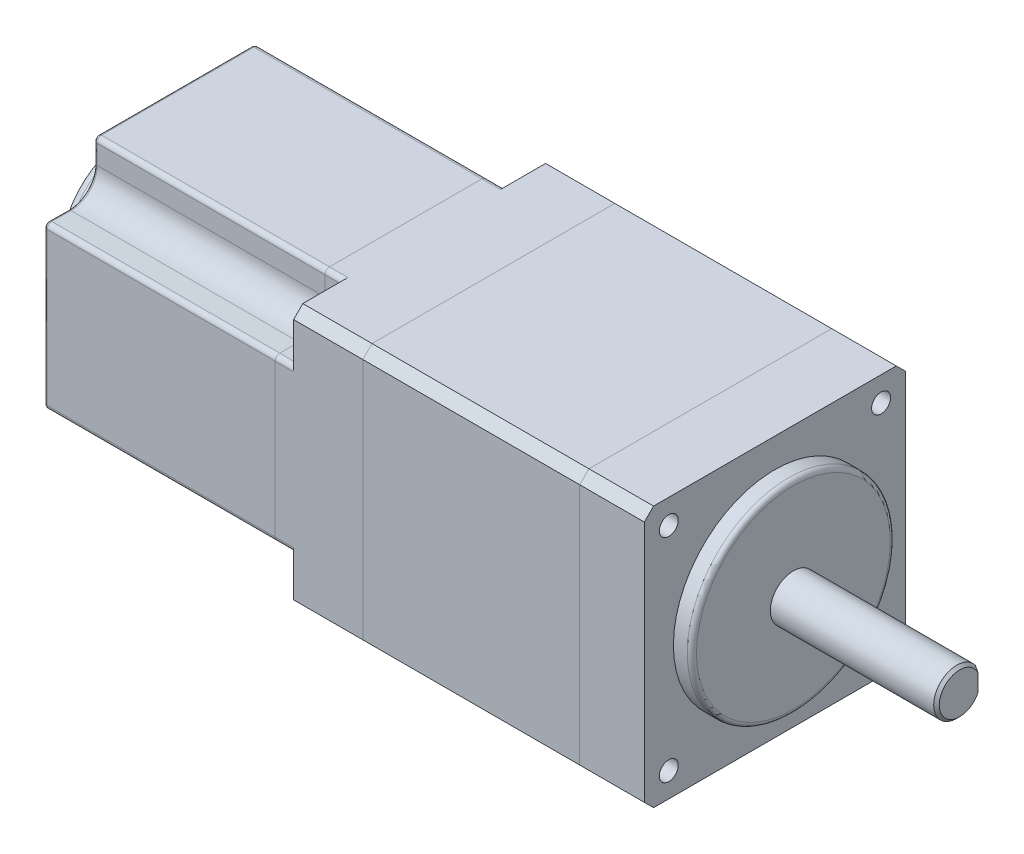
ISO-10303-21;
HEADER;
FILE_DESCRIPTION(('STEP AP214'),'2;1');
FILE_NAME('part.step','',(''),(''),'','','');
FILE_SCHEMA(('AUTOMOTIVE_DESIGN { 1 0 10303 214 1 1 1 1 }'));
ENDSEC;
DATA;
#1=APPLICATION_CONTEXT('core data for automotive mechanical design processes');
#2=APPLICATION_PROTOCOL_DEFINITION('international standard','automotive_design',2000,#1);
#3=PRODUCT_CONTEXT('',#1,'mechanical');
#4=PRODUCT('Part','Part','',(#3));
#5=PRODUCT_RELATED_PRODUCT_CATEGORY('part','',(#4));
#6=PRODUCT_DEFINITION_FORMATION('','',#4);
#7=PRODUCT_DEFINITION_CONTEXT('part definition',#1,'design');
#8=PRODUCT_DEFINITION('design','',#6,#7);
#9=PRODUCT_DEFINITION_SHAPE('','',#8);
#10=(LENGTH_UNIT() NAMED_UNIT(*) SI_UNIT(.MILLI.,.METRE.));
#11=(NAMED_UNIT(*) PLANE_ANGLE_UNIT() SI_UNIT($,.RADIAN.));
#12=(NAMED_UNIT(*) SI_UNIT($,.STERADIAN.) SOLID_ANGLE_UNIT());
#13=UNCERTAINTY_MEASURE_WITH_UNIT(LENGTH_MEASURE(1.E-05),#10,'distance_accuracy_value','');
#14=(GEOMETRIC_REPRESENTATION_CONTEXT(3) GLOBAL_UNCERTAINTY_ASSIGNED_CONTEXT((#13)) GLOBAL_UNIT_ASSIGNED_CONTEXT((#10,
#11,#12)) REPRESENTATION_CONTEXT('',''));
#15=CARTESIAN_POINT('',(0.,0.,0.));
#16=DIRECTION('',(0.,0.,1.));
#17=DIRECTION('',(1.,0.,0.));
#18=AXIS2_PLACEMENT_3D('',#15,#16,#17);
#19=CARTESIAN_POINT('',(-65.,0.,0.));
#20=DIRECTION('',(-1.,0.,0.));
#21=DIRECTION('',(0.,0.,1.));
#22=AXIS2_PLACEMENT_3D('',#19,#20,#21);
#23=PLANE('',#22);
#24=CARTESIAN_POINT('',(-65.,-8.25,-13.65));
#25=DIRECTION('',(-1.,0.,0.));
#26=DIRECTION('',(0.,0.,1.));
#27=AXIS2_PLACEMENT_3D('',#24,#25,#26);
#28=CIRCLE('',#27,0.2);
#29=CARTESIAN_POINT('',(-65.,-8.25,-13.85));
#30=VERTEX_POINT('',#29);
#31=CARTESIAN_POINT('',(-65.,-8.4499357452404,-13.6449307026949));
#32=VERTEX_POINT('',#31);
#33=EDGE_CURVE('E495',#30,#32,#28,.T.);
#34=ORIENTED_EDGE('',*,*,#33,.T.);
#35=DIRECTION('',(0.,0.00879604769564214,0.999961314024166));
#36=VECTOR('',#35,1.);
#37=CARTESIAN_POINT('',(-65.,-8.431583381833,-11.5585785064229));
#38=LINE('',#37,#36);
#39=CARTESIAN_POINT('',(-65.,-8.43159804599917,-11.5602455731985));
#40=VERTEX_POINT('',#39);
#41=EDGE_CURVE('E497',#32,#40,#38,.T.);
#42=ORIENTED_EDGE('',*,*,#41,.T.);
#43=CARTESIAN_POINT('',(-65.,-11.5,-11.5));
#44=DIRECTION('',(-1.,0.,0.));
#45=DIRECTION('',(0.,0.,1.));
#46=AXIS2_PLACEMENT_3D('',#43,#44,#45);
#47=CIRCLE('',#46,3.06899333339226);
#48=CARTESIAN_POINT('',(-65.,-8.91095106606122,-9.85210871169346));
#49=VERTEX_POINT('',#48);
#50=EDGE_CURVE('E308',#40,#49,#47,.F.);
#51=ORIENTED_EDGE('',*,*,#50,.T.);
#52=CARTESIAN_POINT('',(-65.,-11.45,-11.45));
#53=DIRECTION('',(-1.,0.,0.));
#54=DIRECTION('',(0.,0.,1.));
#55=AXIS2_PLACEMENT_3D('',#52,#53,#54);
#56=CIRCLE('',#55,3.);
#57=CARTESIAN_POINT('',(-65.,-9.8506729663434,-8.91186031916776));
#58=VERTEX_POINT('',#57);
#59=EDGE_CURVE('E449',#49,#58,#56,.F.);
#60=ORIENTED_EDGE('',*,*,#59,.T.);
#61=CARTESIAN_POINT('',(-65.,-11.5,-11.5));
#62=DIRECTION('',(-1.,0.,0.));
#63=DIRECTION('',(0.,0.,1.));
#64=AXIS2_PLACEMENT_3D('',#61,#62,#63);
#65=CIRCLE('',#64,3.06899333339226);
#66=CARTESIAN_POINT('',(-65.,-11.825224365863,-8.44828749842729));
#67=VERTEX_POINT('',#66);
#68=EDGE_CURVE('E451',#58,#67,#65,.F.);
#69=ORIENTED_EDGE('',*,*,#68,.T.);
#70=DIRECTION('',(0.,0.999999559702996,0.000938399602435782));
#71=VECTOR('',#70,1.);
#72=CARTESIAN_POINT('',(-65.,0.00791745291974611,-8.43718327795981));
#73=LINE('',#72,#71);
#74=CARTESIAN_POINT('',(-65.,-13.650000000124,-8.44999986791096));
#75=VERTEX_POINT('',#74);
#76=EDGE_CURVE('E453',#67,#75,#73,.F.);
#77=ORIENTED_EDGE('',*,*,#76,.T.);
#78=CARTESIAN_POINT('',(-65.,-13.65,-8.25));
#79=DIRECTION('',(-1.,0.,0.));
#80=DIRECTION('',(0.,0.,1.));
#81=AXIS2_PLACEMENT_3D('',#78,#79,#80);
#82=CIRCLE('',#81,0.2);
#83=CARTESIAN_POINT('',(-65.,-13.85,-8.24999999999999));
#84=VERTEX_POINT('',#83);
#85=EDGE_CURVE('E455',#75,#84,#82,.T.);
#86=ORIENTED_EDGE('',*,*,#85,.T.);
#87=DIRECTION('',(0.,0.,1.));
#88=VECTOR('',#87,1.);
#89=CARTESIAN_POINT('',(-65.,-13.85,8.25));
#90=LINE('',#89,#88);
#91=CARTESIAN_POINT('',(-65.,-13.85,8.25));
#92=VERTEX_POINT('',#91);
#93=EDGE_CURVE('E457',#84,#92,#90,.T.);
#94=ORIENTED_EDGE('',*,*,#93,.T.);
#95=CARTESIAN_POINT('',(-65.,-13.65,8.25));
#96=DIRECTION('',(-1.,0.,0.));
#97=DIRECTION('',(0.,0.,1.));
#98=AXIS2_PLACEMENT_3D('',#95,#96,#97);
#99=CIRCLE('',#98,0.2);
#100=CARTESIAN_POINT('',(-65.,-13.6511195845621,8.44999686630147));
#101=VERTEX_POINT('',#100);
#102=EDGE_CURVE('E459',#92,#101,#99,.T.);
#103=ORIENTED_EDGE('',*,*,#102,.T.);
#104=DIRECTION('',(0.,-0.999953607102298,0.00963242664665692));
#105=VECTOR('',#104,1.);
#106=CARTESIAN_POINT('',(-65.,0.0801235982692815,8.3177255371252));
#107=LINE('',#106,#105);
#108=CARTESIAN_POINT('',(-65.,-11.5576722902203,8.42983095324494));
#109=VERTEX_POINT('',#108);
#110=EDGE_CURVE('E461',#101,#109,#107,.F.);
#111=ORIENTED_EDGE('',*,*,#110,.T.);
#112=CARTESIAN_POINT('',(-65.,-11.5,11.5));
#113=DIRECTION('',(-1.,0.,0.));
#114=DIRECTION('',(0.,0.,1.));
#115=AXIS2_PLACEMENT_3D('',#112,#113,#114);
#116=CIRCLE('',#115,3.07071067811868);
#117=CARTESIAN_POINT('',(-65.,-8.45000000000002,11.8560394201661));
#118=VERTEX_POINT('',#117);
#119=EDGE_CURVE('E463',#109,#118,#116,.F.);
#120=ORIENTED_EDGE('',*,*,#119,.T.);
#121=DIRECTION('',(0.,0.,1.));
#122=VECTOR('',#121,1.);
#123=CARTESIAN_POINT('',(-65.,-8.45000000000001,13.65));
#124=LINE('',#123,#122);
#125=CARTESIAN_POINT('',(-65.,-8.45000000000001,13.65));
#126=VERTEX_POINT('',#125);
#127=EDGE_CURVE('E465',#118,#126,#124,.T.);
#128=ORIENTED_EDGE('',*,*,#127,.T.);
#129=CARTESIAN_POINT('',(-65.,-8.25000000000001,13.65));
#130=DIRECTION('',(-1.,0.,0.));
#131=DIRECTION('',(0.,0.,1.));
#132=AXIS2_PLACEMENT_3D('',#129,#130,#131);
#133=CIRCLE('',#132,0.2);
#134=CARTESIAN_POINT('',(-65.,-8.25,13.85));
#135=VERTEX_POINT('',#134);
#136=EDGE_CURVE('E467',#126,#135,#133,.T.);
#137=ORIENTED_EDGE('',*,*,#136,.T.);
#138=DIRECTION('',(0.,1.,0.));
#139=VECTOR('',#138,1.);
#140=CARTESIAN_POINT('',(-65.,8.25,13.85));
#141=LINE('',#140,#139);
#142=CARTESIAN_POINT('',(-65.,8.25,13.85));
#143=VERTEX_POINT('',#142);
#144=EDGE_CURVE('E469',#135,#143,#141,.T.);
#145=ORIENTED_EDGE('',*,*,#144,.T.);
#146=CARTESIAN_POINT('',(-65.,8.25,13.65));
#147=DIRECTION('',(-1.,0.,0.));
#148=DIRECTION('',(0.,0.,1.));
#149=AXIS2_PLACEMENT_3D('',#146,#147,#148);
#150=CIRCLE('',#149,0.2);
#151=CARTESIAN_POINT('',(-65.,8.44993818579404,13.6450278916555));
#152=VERTEX_POINT('',#151);
#153=EDGE_CURVE('E471',#143,#152,#150,.T.);
#154=ORIENTED_EDGE('',*,*,#153,.T.);
#155=DIRECTION('',(0.,0.00963242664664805,0.999953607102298));
#156=VECTOR('',#155,1.);
#157=CARTESIAN_POINT('',(-65.,8.31772553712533,-0.080123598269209));
#158=LINE('',#157,#156);
#159=CARTESIAN_POINT('',(-65.,8.42983095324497,11.5576722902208));
#160=VERTEX_POINT('',#159);
#161=EDGE_CURVE('E473',#152,#160,#158,.F.);
#162=ORIENTED_EDGE('',*,*,#161,.T.);
#163=CARTESIAN_POINT('',(-65.,11.5,11.5));
#164=DIRECTION('',(-1.,0.,0.));
#165=DIRECTION('',(0.,0.,1.));
#166=AXIS2_PLACEMENT_3D('',#163,#164,#165);
#167=CIRCLE('',#166,3.07071067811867);
#168=CARTESIAN_POINT('',(-65.,11.5576722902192,8.42983095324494));
#169=VERTEX_POINT('',#168);
#170=EDGE_CURVE('E475',#160,#169,#167,.F.);
#171=ORIENTED_EDGE('',*,*,#170,.T.);
#172=DIRECTION('',(0.,0.999953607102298,0.00963242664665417));
#173=VECTOR('',#172,1.);
#174=CARTESIAN_POINT('',(-65.,13.652889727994,8.45001391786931));
#175=LINE('',#174,#173);
#176=CARTESIAN_POINT('',(-65.,13.6511195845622,8.44999686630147));
#177=VERTEX_POINT('',#176);
#178=EDGE_CURVE('E477',#169,#177,#175,.T.);
#179=ORIENTED_EDGE('',*,*,#178,.T.);
#180=CARTESIAN_POINT('',(-65.,13.65,8.25));
#181=DIRECTION('',(-1.,0.,0.));
#182=DIRECTION('',(0.,0.,1.));
#183=AXIS2_PLACEMENT_3D('',#180,#181,#182);
#184=CIRCLE('',#183,0.2);
#185=CARTESIAN_POINT('',(-65.,13.85,8.25));
#186=VERTEX_POINT('',#185);
#187=EDGE_CURVE('E479',#177,#186,#184,.T.);
#188=ORIENTED_EDGE('',*,*,#187,.T.);
#189=DIRECTION('',(0.,0.,-1.));
#190=VECTOR('',#189,1.);
#191=CARTESIAN_POINT('',(-65.,13.85,-8.25));
#192=LINE('',#191,#190);
#193=CARTESIAN_POINT('',(-65.,13.85,-8.25));
#194=VERTEX_POINT('',#193);
#195=EDGE_CURVE('E481',#186,#194,#192,.T.);
#196=ORIENTED_EDGE('',*,*,#195,.T.);
#197=CARTESIAN_POINT('',(-65.,13.65,-8.25));
#198=DIRECTION('',(-1.,0.,0.));
#199=DIRECTION('',(0.,0.,1.));
#200=AXIS2_PLACEMENT_3D('',#197,#198,#199);
#201=CIRCLE('',#200,0.2);
#202=CARTESIAN_POINT('',(-65.,13.65,-8.45));
#203=VERTEX_POINT('',#202);
#204=EDGE_CURVE('E483',#194,#203,#201,.T.);
#205=ORIENTED_EDGE('',*,*,#204,.T.);
#206=DIRECTION('',(0.,-1.,0.));
#207=VECTOR('',#206,1.);
#208=CARTESIAN_POINT('',(-65.,11.8381385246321,-8.45));
#209=LINE('',#208,#207);
#210=CARTESIAN_POINT('',(-65.,11.8560394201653,-8.45));
#211=VERTEX_POINT('',#210);
#212=EDGE_CURVE('E485',#203,#211,#209,.T.);
#213=ORIENTED_EDGE('',*,*,#212,.T.);
#214=CARTESIAN_POINT('',(-65.,11.5,-11.5));
#215=DIRECTION('',(-1.,0.,0.));
#216=DIRECTION('',(0.,0.,1.));
#217=AXIS2_PLACEMENT_3D('',#214,#215,#216);
#218=CIRCLE('',#217,3.07071067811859);
#219=CARTESIAN_POINT('',(-65.,8.42983095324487,-11.5576722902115));
#220=VERTEX_POINT('',#219);
#221=EDGE_CURVE('E487',#211,#220,#218,.F.);
#222=ORIENTED_EDGE('',*,*,#221,.T.);
#223=DIRECTION('',(0.,0.00963242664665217,-0.999953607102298));
#224=VECTOR('',#223,1.);
#225=CARTESIAN_POINT('',(-65.,8.44992113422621,-13.6432577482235));
#226=LINE('',#225,#224);
#227=CARTESIAN_POINT('',(-65.,8.44993818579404,-13.6450278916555));
#228=VERTEX_POINT('',#227);
#229=EDGE_CURVE('E489',#220,#228,#226,.T.);
#230=ORIENTED_EDGE('',*,*,#229,.T.);
#231=CARTESIAN_POINT('',(-65.,8.25,-13.65));
#232=DIRECTION('',(-1.,0.,0.));
#233=DIRECTION('',(0.,0.,1.));
#234=AXIS2_PLACEMENT_3D('',#231,#232,#233);
#235=CIRCLE('',#234,0.200000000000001);
#236=CARTESIAN_POINT('',(-65.,8.24999999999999,-13.85));
#237=VERTEX_POINT('',#236);
#238=EDGE_CURVE('E491',#228,#237,#235,.T.);
#239=ORIENTED_EDGE('',*,*,#238,.T.);
#240=DIRECTION('',(0.,-1.,0.));
#241=VECTOR('',#240,1.);
#242=CARTESIAN_POINT('',(-65.,-8.25,-13.85));
#243=LINE('',#242,#241);
#244=EDGE_CURVE('E493',#237,#30,#243,.T.);
#245=ORIENTED_EDGE('',*,*,#244,.T.);
#246=EDGE_LOOP('',(#34,#42,#51,#60,#69,#77,#86,#94,#103,#111,#120,#128,#137,#145,#154,#162,#171,
#179,#188,#196,#205,#213,#222,#230,#239,#245));
#247=FACE_BOUND('',#246,.T.);
#248=CARTESIAN_POINT('',(-65.,0.,0.));
#249=DIRECTION('',(-1.,0.,0.));
#250=DIRECTION('',(0.,0.,1.));
#251=AXIS2_PLACEMENT_3D('',#248,#249,#250);
#252=CIRCLE('',#251,8.);
#253=CARTESIAN_POINT('',(-65.,0.,8.));
#254=VERTEX_POINT('',#253);
#255=EDGE_CURVE('E559',#254,#254,#252,.T.);
#256=ORIENTED_EDGE('',*,*,#255,.F.);
#257=EDGE_LOOP('',(#256));
#258=FACE_BOUND('',#257,.T.);
#259=ADVANCED_FACE('F50',(#247,#258),#23,.T.);
#260=CARTESIAN_POINT('',(-65.,-11.5,-11.5));
#261=DIRECTION('',(1.,0.,0.));
#262=DIRECTION('',(0.,0.,-1.));
#263=AXIS2_PLACEMENT_3D('',#260,#261,#262);
#264=CYLINDRICAL_SURFACE('',#263,2.76899333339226);
#265=DIRECTION('',(1.,0.,0.));
#266=VECTOR('',#265,1.);
#267=CARTESIAN_POINT('',(-65.,-9.16485925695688,-10.0118999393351));
#268=LINE('',#267,#266);
#269=CARTESIAN_POINT('',(-64.7,-9.16485925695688,-10.0118999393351));
#270=VERTEX_POINT('',#269);
#271=CARTESIAN_POINT('',(-40.,-9.16485925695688,-10.0118999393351));
#272=VERTEX_POINT('',#271);
#273=EDGE_CURVE('E300',#270,#272,#268,.T.);
#274=ORIENTED_EDGE('',*,*,#273,.F.);
#275=CARTESIAN_POINT('',(-64.7,-11.5,-11.5));
#276=DIRECTION('',(-1.,0.,0.));
#277=DIRECTION('',(0.,0.,1.));
#278=AXIS2_PLACEMENT_3D('',#275,#276,#277);
#279=CIRCLE('',#278,2.76899333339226);
#280=CARTESIAN_POINT('',(-64.7,-8.73157177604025,-11.5559396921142));
#281=VERTEX_POINT('',#280);
#282=EDGE_CURVE('E549',#270,#281,#279,.T.);
#283=ORIENTED_EDGE('',*,*,#282,.T.);
#284=DIRECTION('',(1.,0.,0.));
#285=VECTOR('',#284,1.);
#286=CARTESIAN_POINT('',(-65.,-8.73157177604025,-11.5559396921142));
#287=LINE('',#286,#285);
#288=CARTESIAN_POINT('',(-40.,-8.73157177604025,-11.5559396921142));
#289=VERTEX_POINT('',#288);
#290=EDGE_CURVE('E322',#281,#289,#287,.T.);
#291=ORIENTED_EDGE('',*,*,#290,.T.);
#292=CARTESIAN_POINT('',(-40.,-11.5,-11.5));
#293=DIRECTION('',(-1.,0.,0.));
#294=DIRECTION('',(0.,0.,1.));
#295=AXIS2_PLACEMENT_3D('',#292,#293,#294);
#296=CIRCLE('',#295,2.76899333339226);
#297=EDGE_CURVE('E315',#272,#289,#296,.T.);
#298=ORIENTED_EDGE('',*,*,#297,.F.);
#299=EDGE_LOOP('',(#274,#283,#291,#298));
#300=FACE_BOUND('',#299,.T.);
#301=ADVANCED_FACE('F320',(#300),#264,.F.);
#302=CARTESIAN_POINT('',(-65.,-11.45,-11.45));
#303=DIRECTION('',(1.,0.,0.));
#304=DIRECTION('',(0.,0.,-1.));
#305=AXIS2_PLACEMENT_3D('',#302,#303,#304);
#306=CYLINDRICAL_SURFACE('',#305,2.7);
#307=DIRECTION('',(1.,0.,0.));
#308=VECTOR('',#307,1.);
#309=CARTESIAN_POINT('',(-65.,-10.0118999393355,-9.16485925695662));
#310=LINE('',#309,#308);
#311=CARTESIAN_POINT('',(-64.7,-10.0118999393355,-9.16485925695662));
#312=VERTEX_POINT('',#311);
#313=CARTESIAN_POINT('',(-40.,-10.0118999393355,-9.16485925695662));
#314=VERTEX_POINT('',#313);
#315=EDGE_CURVE('E309',#312,#314,#310,.T.);
#316=ORIENTED_EDGE('',*,*,#315,.F.);
#317=CARTESIAN_POINT('',(-64.7,-11.45,-11.45));
#318=DIRECTION('',(-1.,0.,0.));
#319=DIRECTION('',(0.,0.,1.));
#320=AXIS2_PLACEMENT_3D('',#317,#318,#319);
#321=CIRCLE('',#320,2.7);
#322=EDGE_CURVE('E65',#312,#270,#321,.T.);
#323=ORIENTED_EDGE('',*,*,#322,.T.);
#324=ORIENTED_EDGE('',*,*,#273,.T.);
#325=CARTESIAN_POINT('',(-40.,-11.45,-11.45));
#326=DIRECTION('',(-1.,0.,0.));
#327=DIRECTION('',(0.,0.,1.));
#328=AXIS2_PLACEMENT_3D('',#325,#326,#327);
#329=CIRCLE('',#328,2.7);
#330=EDGE_CURVE('E303',#272,#314,#329,.F.);
#331=ORIENTED_EDGE('',*,*,#330,.T.);
#332=EDGE_LOOP('',(#316,#323,#324,#331));
#333=FACE_BOUND('',#332,.T.);
#334=ADVANCED_FACE('F302',(#333),#306,.F.);
#335=DIRECTION('',(1.,0.,0.));
#336=VECTOR('',#335,1.);
#337=CARTESIAN_POINT('',(-65.,-11.8087360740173,-8.74827215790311));
#338=LINE('',#337,#336);
#339=CARTESIAN_POINT('',(-64.7,-11.8087360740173,-8.74827215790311));
#340=VERTEX_POINT('',#339);
#341=CARTESIAN_POINT('',(-40.,-11.8087360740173,-8.74827215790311));
#342=VERTEX_POINT('',#341);
#343=EDGE_CURVE('E445',#340,#342,#338,.T.);
#344=ORIENTED_EDGE('',*,*,#343,.F.);
#345=CARTESIAN_POINT('',(-64.7,-11.5,-11.5));
#346=DIRECTION('',(-1.,0.,0.));
#347=DIRECTION('',(0.,0.,1.));
#348=AXIS2_PLACEMENT_3D('',#345,#346,#347);
#349=CIRCLE('',#348,2.76899333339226);
#350=EDGE_CURVE('E73',#340,#312,#349,.T.);
#351=ORIENTED_EDGE('',*,*,#350,.T.);
#352=ORIENTED_EDGE('',*,*,#315,.T.);
#353=EDGE_CURVE('E318',#342,#314,#296,.T.);
#354=ORIENTED_EDGE('',*,*,#353,.F.);
#355=EDGE_LOOP('',(#344,#351,#352,#354));
#356=FACE_BOUND('',#355,.T.);
#357=ADVANCED_FACE('F764',(#356),#264,.F.);
#358=CARTESIAN_POINT('',(-65.,0.00819897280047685,-8.73718314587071));
#359=DIRECTION('',(0.,0.000938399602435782,-0.999999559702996));
#360=DIRECTION('',(0.,0.999999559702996,0.000938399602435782));
#361=AXIS2_PLACEMENT_3D('',#358,#359,#360);
#362=PLANE('',#361);
#363=DIRECTION('',(1.,0.,0.));
#364=VECTOR('',#363,1.);
#365=CARTESIAN_POINT('',(-65.,-13.65,-8.75));
#366=LINE('',#365,#364);
#367=CARTESIAN_POINT('',(-64.7,-13.65,-8.75));
#368=VERTEX_POINT('',#367);
#369=CARTESIAN_POINT('',(-40.,-13.65,-8.75));
#370=VERTEX_POINT('',#369);
#371=EDGE_CURVE('E443',#368,#370,#366,.T.);
#372=ORIENTED_EDGE('',*,*,#371,.F.);
#373=DIRECTION('',(0.,0.999999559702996,0.000938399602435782));
#374=VECTOR('',#373,1.);
#375=CARTESIAN_POINT('',(-64.7,0.00819897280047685,-8.73718314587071));
#376=LINE('',#375,#374);
#377=EDGE_CURVE('E545',#368,#340,#376,.T.);
#378=ORIENTED_EDGE('',*,*,#377,.T.);
#379=ORIENTED_EDGE('',*,*,#343,.T.);
#380=DIRECTION('',(0.,0.999999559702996,0.000938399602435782));
#381=VECTOR('',#380,1.);
#382=CARTESIAN_POINT('',(-40.,0.00819897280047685,-8.73718314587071));
#383=LINE('',#382,#381);
#384=EDGE_CURVE('E330',#370,#342,#383,.T.);
#385=ORIENTED_EDGE('',*,*,#384,.F.);
#386=EDGE_LOOP('',(#372,#378,#379,#385));
#387=FACE_BOUND('',#386,.T.);
#388=ADVANCED_FACE('F856',(#387),#362,.T.);
#389=CARTESIAN_POINT('',(-65.,-13.65,-8.25));
#390=DIRECTION('',(1.,0.,0.));
#391=DIRECTION('',(0.,0.,-1.));
#392=AXIS2_PLACEMENT_3D('',#389,#390,#391);
#393=CYLINDRICAL_SURFACE('',#392,0.5);
#394=DIRECTION('',(1.,0.,0.));
#395=VECTOR('',#394,1.);
#396=CARTESIAN_POINT('',(-65.,-14.15,-8.24999999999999));
#397=LINE('',#396,#395);
#398=CARTESIAN_POINT('',(-64.7,-14.15,-8.24999999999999));
#399=VERTEX_POINT('',#398);
#400=CARTESIAN_POINT('',(-40.,-14.15,-8.24999999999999));
#401=VERTEX_POINT('',#400);
#402=EDGE_CURVE('E441',#399,#401,#397,.T.);
#403=ORIENTED_EDGE('',*,*,#402,.F.);
#404=CARTESIAN_POINT('',(-64.7,-13.65,-8.25));
#405=DIRECTION('',(-1.,0.,0.));
#406=DIRECTION('',(0.,0.,1.));
#407=AXIS2_PLACEMENT_3D('',#404,#405,#406);
#408=CIRCLE('',#407,0.5);
#409=EDGE_CURVE('E543',#399,#368,#408,.F.);
#410=ORIENTED_EDGE('',*,*,#409,.T.);
#411=ORIENTED_EDGE('',*,*,#371,.T.);
#412=CARTESIAN_POINT('',(-40.,-13.65,-8.25));
#413=DIRECTION('',(-1.,0.,0.));
#414=DIRECTION('',(0.,0.,1.));
#415=AXIS2_PLACEMENT_3D('',#412,#413,#414);
#416=CIRCLE('',#415,0.5);
#417=EDGE_CURVE('E331',#370,#401,#416,.T.);
#418=ORIENTED_EDGE('',*,*,#417,.T.);
#419=EDGE_LOOP('',(#403,#410,#411,#418));
#420=FACE_BOUND('',#419,.T.);
#421=ADVANCED_FACE('F852',(#420),#393,.T.);
#422=CARTESIAN_POINT('',(-65.,-14.15,0.));
#423=DIRECTION('',(0.,1.,0.));
#424=DIRECTION('',(0.,0.,1.));
#425=AXIS2_PLACEMENT_3D('',#422,#423,#424);
#426=PLANE('',#425);
#427=DIRECTION('',(1.,0.,0.));
#428=VECTOR('',#427,1.);
#429=CARTESIAN_POINT('',(-65.,-14.15,8.25));
#430=LINE('',#429,#428);
#431=CARTESIAN_POINT('',(-64.7,-14.15,8.25));
#432=VERTEX_POINT('',#431);
#433=CARTESIAN_POINT('',(-40.,-14.15,8.25));
#434=VERTEX_POINT('',#433);
#435=EDGE_CURVE('E439',#432,#434,#430,.T.);
#436=ORIENTED_EDGE('',*,*,#435,.F.);
#437=DIRECTION('',(0.,0.,1.));
#438=VECTOR('',#437,1.);
#439=CARTESIAN_POINT('',(-64.7,-14.15,-8.24999999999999));
#440=LINE('',#439,#438);
#441=EDGE_CURVE('E541',#432,#399,#440,.F.);
#442=ORIENTED_EDGE('',*,*,#441,.T.);
#443=ORIENTED_EDGE('',*,*,#402,.T.);
#444=DIRECTION('',(0.,0.,1.));
#445=VECTOR('',#444,1.);
#446=CARTESIAN_POINT('',(-40.,-14.15,0.));
#447=LINE('',#446,#445);
#448=EDGE_CURVE('E336',#401,#434,#447,.T.);
#449=ORIENTED_EDGE('',*,*,#448,.T.);
#450=EDGE_LOOP('',(#436,#442,#443,#449));
#451=FACE_BOUND('',#450,.T.);
#452=ADVANCED_FACE('F848',(#451),#426,.F.);
#453=CARTESIAN_POINT('',(-65.,-13.65,8.25));
#454=DIRECTION('',(1.,0.,0.));
#455=DIRECTION('',(0.,0.,-1.));
#456=AXIS2_PLACEMENT_3D('',#453,#454,#455);
#457=CYLINDRICAL_SURFACE('',#456,0.5);
#458=DIRECTION('',(1.,0.,0.));
#459=VECTOR('',#458,1.);
#460=CARTESIAN_POINT('',(-65.,-13.65,8.75));
#461=LINE('',#460,#459);
#462=CARTESIAN_POINT('',(-64.7,-13.65,8.75));
#463=VERTEX_POINT('',#462);
#464=CARTESIAN_POINT('',(-40.,-13.65,8.75));
#465=VERTEX_POINT('',#464);
#466=EDGE_CURVE('E437',#463,#465,#461,.T.);
#467=ORIENTED_EDGE('',*,*,#466,.F.);
#468=CARTESIAN_POINT('',(-64.7,-13.65,8.25));
#469=DIRECTION('',(-1.,0.,0.));
#470=DIRECTION('',(0.,0.,1.));
#471=AXIS2_PLACEMENT_3D('',#468,#469,#470);
#472=CIRCLE('',#471,0.5);
#473=EDGE_CURVE('E539',#463,#432,#472,.F.);
#474=ORIENTED_EDGE('',*,*,#473,.T.);
#475=ORIENTED_EDGE('',*,*,#435,.T.);
#476=CARTESIAN_POINT('',(-40.,-13.65,8.25));
#477=DIRECTION('',(-1.,0.,0.));
#478=DIRECTION('',(0.,0.,1.));
#479=AXIS2_PLACEMENT_3D('',#476,#477,#478);
#480=CIRCLE('',#479,0.5);
#481=EDGE_CURVE('E341',#434,#465,#480,.T.);
#482=ORIENTED_EDGE('',*,*,#481,.T.);
#483=EDGE_LOOP('',(#467,#474,#475,#482));
#484=FACE_BOUND('',#483,.T.);
#485=ADVANCED_FACE('F844',(#484),#457,.T.);
#486=CARTESIAN_POINT('',(-65.,0.0830133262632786,8.61771161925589));
#487=DIRECTION('',(0.,0.00963242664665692,0.999953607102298));
#488=DIRECTION('',(0.,-0.999953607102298,0.00963242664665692));
#489=AXIS2_PLACEMENT_3D('',#486,#487,#488);
#490=PLANE('',#489);
#491=DIRECTION('',(1.,0.,0.));
#492=VECTOR('',#491,1.);
#493=CARTESIAN_POINT('',(-65.,-11.5533748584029,8.72980347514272));
#494=LINE('',#493,#492);
#495=CARTESIAN_POINT('',(-64.7,-11.5533748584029,8.72980347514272));
#496=VERTEX_POINT('',#495);
#497=CARTESIAN_POINT('',(-40.,-11.5533748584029,8.72980347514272));
#498=VERTEX_POINT('',#497);
#499=EDGE_CURVE('E435',#496,#498,#494,.T.);
#500=ORIENTED_EDGE('',*,*,#499,.F.);
#501=DIRECTION('',(0.,-0.999953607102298,0.00963242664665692));
#502=VECTOR('',#501,1.);
#503=CARTESIAN_POINT('',(-64.7,0.0830133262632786,8.61771161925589));
#504=LINE('',#503,#502);
#505=EDGE_CURVE('E537',#496,#463,#504,.T.);
#506=ORIENTED_EDGE('',*,*,#505,.T.);
#507=ORIENTED_EDGE('',*,*,#466,.T.);
#508=DIRECTION('',(0.,-0.999953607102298,0.00963242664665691));
#509=VECTOR('',#508,1.);
#510=CARTESIAN_POINT('',(-40.,0.0830133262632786,8.61771161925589));
#511=LINE('',#510,#509);
#512=EDGE_CURVE('E344',#498,#465,#511,.T.);
#513=ORIENTED_EDGE('',*,*,#512,.F.);
#514=EDGE_LOOP('',(#500,#506,#507,#513));
#515=FACE_BOUND('',#514,.T.);
#516=ADVANCED_FACE('F840',(#515),#490,.T.);
#517=CARTESIAN_POINT('',(-65.,-11.5,11.5));
#518=DIRECTION('',(1.,0.,0.));
#519=DIRECTION('',(0.,0.,-1.));
#520=AXIS2_PLACEMENT_3D('',#517,#518,#519);
#521=CYLINDRICAL_SURFACE('',#520,2.77071067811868);
#522=DIRECTION('',(1.,0.,0.));
#523=VECTOR('',#522,1.);
#524=CARTESIAN_POINT('',(-65.,-8.75000000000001,11.8381385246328));
#525=LINE('',#524,#523);
#526=CARTESIAN_POINT('',(-64.7,-8.75000000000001,11.8381385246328));
#527=VERTEX_POINT('',#526);
#528=CARTESIAN_POINT('',(-40.,-8.75000000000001,11.8381385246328));
#529=VERTEX_POINT('',#528);
#530=EDGE_CURVE('E433',#527,#529,#525,.T.);
#531=ORIENTED_EDGE('',*,*,#530,.F.);
#532=CARTESIAN_POINT('',(-64.7,-11.5,11.5));
#533=DIRECTION('',(-1.,0.,0.));
#534=DIRECTION('',(0.,0.,1.));
#535=AXIS2_PLACEMENT_3D('',#532,#533,#534);
#536=CIRCLE('',#535,2.77071067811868);
#537=EDGE_CURVE('E535',#527,#496,#536,.T.);
#538=ORIENTED_EDGE('',*,*,#537,.T.);
#539=ORIENTED_EDGE('',*,*,#499,.T.);
#540=CARTESIAN_POINT('',(-40.,-11.5,11.5));
#541=DIRECTION('',(-1.,0.,0.));
#542=DIRECTION('',(0.,0.,1.));
#543=AXIS2_PLACEMENT_3D('',#540,#541,#542);
#544=CIRCLE('',#543,2.77071067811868);
#545=EDGE_CURVE('E347',#529,#498,#544,.T.);
#546=ORIENTED_EDGE('',*,*,#545,.F.);
#547=EDGE_LOOP('',(#531,#538,#539,#546));
#548=FACE_BOUND('',#547,.T.);
#549=ADVANCED_FACE('F836',(#548),#521,.F.);
#550=CARTESIAN_POINT('',(-65.,-8.75000000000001,0.));
#551=DIRECTION('',(0.,1.,0.));
#552=DIRECTION('',(0.,0.,1.));
#553=AXIS2_PLACEMENT_3D('',#550,#551,#552);
#554=PLANE('',#553);
#555=DIRECTION('',(1.,0.,0.));
#556=VECTOR('',#555,1.);
#557=CARTESIAN_POINT('',(-65.,-8.75000000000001,13.65));
#558=LINE('',#557,#556);
#559=CARTESIAN_POINT('',(-64.7,-8.75000000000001,13.65));
#560=VERTEX_POINT('',#559);
#561=CARTESIAN_POINT('',(-40.,-8.75000000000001,13.65));
#562=VERTEX_POINT('',#561);
#563=EDGE_CURVE('E431',#560,#562,#558,.T.);
#564=ORIENTED_EDGE('',*,*,#563,.F.);
#565=DIRECTION('',(0.,0.,1.));
#566=VECTOR('',#565,1.);
#567=CARTESIAN_POINT('',(-64.7,-8.75000000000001,11.8381385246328));
#568=LINE('',#567,#566);
#569=EDGE_CURVE('E533',#560,#527,#568,.F.);
#570=ORIENTED_EDGE('',*,*,#569,.T.);
#571=ORIENTED_EDGE('',*,*,#530,.T.);
#572=DIRECTION('',(0.,0.,1.));
#573=VECTOR('',#572,1.);
#574=CARTESIAN_POINT('',(-40.,-8.75000000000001,0.));
#575=LINE('',#574,#573);
#576=EDGE_CURVE('E350',#529,#562,#575,.T.);
#577=ORIENTED_EDGE('',*,*,#576,.T.);
#578=EDGE_LOOP('',(#564,#570,#571,#577));
#579=FACE_BOUND('',#578,.T.);
#580=ADVANCED_FACE('F832',(#579),#554,.F.);
#581=CARTESIAN_POINT('',(-65.,-8.25000000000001,13.65));
#582=DIRECTION('',(1.,0.,0.));
#583=DIRECTION('',(0.,0.,-1.));
#584=AXIS2_PLACEMENT_3D('',#581,#582,#583);
#585=CYLINDRICAL_SURFACE('',#584,0.5);
#586=DIRECTION('',(1.,0.,0.));
#587=VECTOR('',#586,1.);
#588=CARTESIAN_POINT('',(-65.,-8.25,14.15));
#589=LINE('',#588,#587);
#590=CARTESIAN_POINT('',(-64.7,-8.25,14.15));
#591=VERTEX_POINT('',#590);
#592=CARTESIAN_POINT('',(-40.,-8.25,14.15));
#593=VERTEX_POINT('',#592);
#594=EDGE_CURVE('E429',#591,#593,#589,.T.);
#595=ORIENTED_EDGE('',*,*,#594,.F.);
#596=CARTESIAN_POINT('',(-64.7,-8.25000000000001,13.65));
#597=DIRECTION('',(-1.,0.,0.));
#598=DIRECTION('',(0.,0.,1.));
#599=AXIS2_PLACEMENT_3D('',#596,#597,#598);
#600=CIRCLE('',#599,0.5);
#601=EDGE_CURVE('E531',#591,#560,#600,.F.);
#602=ORIENTED_EDGE('',*,*,#601,.T.);
#603=ORIENTED_EDGE('',*,*,#563,.T.);
#604=CARTESIAN_POINT('',(-40.,-8.25000000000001,13.65));
#605=DIRECTION('',(-1.,0.,0.));
#606=DIRECTION('',(0.,0.,1.));
#607=AXIS2_PLACEMENT_3D('',#604,#605,#606);
#608=CIRCLE('',#607,0.5);
#609=EDGE_CURVE('E353',#562,#593,#608,.T.);
#610=ORIENTED_EDGE('',*,*,#609,.T.);
#611=EDGE_LOOP('',(#595,#602,#603,#610));
#612=FACE_BOUND('',#611,.T.);
#613=ADVANCED_FACE('F828',(#612),#585,.T.);
#614=CARTESIAN_POINT('',(-65.,0.,14.15));
#615=DIRECTION('',(0.,0.,-1.));
#616=DIRECTION('',(0.,1.,0.));
#617=AXIS2_PLACEMENT_3D('',#614,#615,#616);
#618=PLANE('',#617);
#619=DIRECTION('',(1.,0.,0.));
#620=VECTOR('',#619,1.);
#621=CARTESIAN_POINT('',(-65.,8.25,14.15));
#622=LINE('',#621,#620);
#623=CARTESIAN_POINT('',(-64.7,8.25,14.15));
#624=VERTEX_POINT('',#623);
#625=CARTESIAN_POINT('',(-40.,8.25,14.15));
#626=VERTEX_POINT('',#625);
#627=EDGE_CURVE('E427',#624,#626,#622,.T.);
#628=ORIENTED_EDGE('',*,*,#627,.F.);
#629=DIRECTION('',(0.,1.,0.));
#630=VECTOR('',#629,1.);
#631=CARTESIAN_POINT('',(-64.7,-8.25,14.15));
#632=LINE('',#631,#630);
#633=EDGE_CURVE('E529',#624,#591,#632,.F.);
#634=ORIENTED_EDGE('',*,*,#633,.T.);
#635=ORIENTED_EDGE('',*,*,#594,.T.);
#636=DIRECTION('',(0.,1.,0.));
#637=VECTOR('',#636,1.);
#638=CARTESIAN_POINT('',(-40.,0.,14.15));
#639=LINE('',#638,#637);
#640=EDGE_CURVE('E356',#593,#626,#639,.T.);
#641=ORIENTED_EDGE('',*,*,#640,.T.);
#642=EDGE_LOOP('',(#628,#634,#635,#641));
#643=FACE_BOUND('',#642,.T.);
#644=ADVANCED_FACE('F824',(#643),#618,.F.);
#645=CARTESIAN_POINT('',(-65.,8.25,13.65));
#646=DIRECTION('',(1.,0.,0.));
#647=DIRECTION('',(0.,0.,-1.));
#648=AXIS2_PLACEMENT_3D('',#645,#646,#647);
#649=CYLINDRICAL_SURFACE('',#648,0.5);
#650=DIRECTION('',(1.,0.,0.));
#651=VECTOR('',#650,1.);
#652=CARTESIAN_POINT('',(-65.,8.7499072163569,13.6403680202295));
#653=LINE('',#652,#651);
#654=CARTESIAN_POINT('',(-64.7,8.7499072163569,13.6403680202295));
#655=VERTEX_POINT('',#654);
#656=CARTESIAN_POINT('',(-40.,8.7499072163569,13.6403680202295));
#657=VERTEX_POINT('',#656);
#658=EDGE_CURVE('E425',#655,#657,#653,.T.);
#659=ORIENTED_EDGE('',*,*,#658,.F.);
#660=CARTESIAN_POINT('',(-64.7,8.25,13.65));
#661=DIRECTION('',(-1.,0.,0.));
#662=DIRECTION('',(0.,0.,1.));
#663=AXIS2_PLACEMENT_3D('',#660,#661,#662);
#664=CIRCLE('',#663,0.5);
#665=EDGE_CURVE('E527',#655,#624,#664,.F.);
#666=ORIENTED_EDGE('',*,*,#665,.T.);
#667=ORIENTED_EDGE('',*,*,#627,.T.);
#668=CARTESIAN_POINT('',(-40.,8.25,13.65));
#669=DIRECTION('',(-1.,0.,0.));
#670=DIRECTION('',(0.,0.,1.));
#671=AXIS2_PLACEMENT_3D('',#668,#669,#670);
#672=CIRCLE('',#671,0.5);
#673=EDGE_CURVE('E359',#626,#657,#672,.T.);
#674=ORIENTED_EDGE('',*,*,#673,.T.);
#675=EDGE_LOOP('',(#659,#666,#667,#674));
#676=FACE_BOUND('',#675,.T.);
#677=ADVANCED_FACE('F820',(#676),#649,.T.);
#678=CARTESIAN_POINT('',(-65.,8.61771161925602,-0.0830133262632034));
#679=DIRECTION('',(0.,0.999953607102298,-0.00963242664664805));
#680=DIRECTION('',(0.,0.00963242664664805,0.999953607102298));
#681=AXIS2_PLACEMENT_3D('',#678,#679,#680);
#682=PLANE('',#681);
#683=DIRECTION('',(1.,0.,0.));
#684=VECTOR('',#683,1.);
#685=CARTESIAN_POINT('',(-65.,8.72980347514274,11.5533748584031));
#686=LINE('',#685,#684);
#687=CARTESIAN_POINT('',(-64.7,8.72980347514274,11.5533748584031));
#688=VERTEX_POINT('',#687);
#689=CARTESIAN_POINT('',(-40.,8.72980347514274,11.5533748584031));
#690=VERTEX_POINT('',#689);
#691=EDGE_CURVE('E423',#688,#690,#686,.T.);
#692=ORIENTED_EDGE('',*,*,#691,.F.);
#693=DIRECTION('',(0.,0.00963242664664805,0.999953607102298));
#694=VECTOR('',#693,1.);
#695=CARTESIAN_POINT('',(-64.7,8.61771161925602,-0.0830133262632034));
#696=LINE('',#695,#694);
#697=EDGE_CURVE('E525',#688,#655,#696,.T.);
#698=ORIENTED_EDGE('',*,*,#697,.T.);
#699=ORIENTED_EDGE('',*,*,#658,.T.);
#700=DIRECTION('',(0.,0.00963242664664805,0.999953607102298));
#701=VECTOR('',#700,1.);
#702=CARTESIAN_POINT('',(-40.,8.61771161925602,-0.0830133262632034));
#703=LINE('',#702,#701);
#704=EDGE_CURVE('E362',#690,#657,#703,.T.);
#705=ORIENTED_EDGE('',*,*,#704,.F.);
#706=EDGE_LOOP('',(#692,#698,#699,#705));
#707=FACE_BOUND('',#706,.T.);
#708=ADVANCED_FACE('F816',(#707),#682,.T.);
#709=CARTESIAN_POINT('',(-65.,11.5,11.5));
#710=DIRECTION('',(1.,0.,0.));
#711=DIRECTION('',(0.,0.,-1.));
#712=AXIS2_PLACEMENT_3D('',#709,#710,#711);
#713=CYLINDRICAL_SURFACE('',#712,2.77071067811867);
#714=DIRECTION('',(1.,0.,0.));
#715=VECTOR('',#714,1.);
#716=CARTESIAN_POINT('',(-65.,11.5533748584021,8.72980347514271));
#717=LINE('',#716,#715);
#718=CARTESIAN_POINT('',(-64.7,11.5533748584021,8.72980347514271));
#719=VERTEX_POINT('',#718);
#720=CARTESIAN_POINT('',(-40.,11.5533748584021,8.72980347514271));
#721=VERTEX_POINT('',#720);
#722=EDGE_CURVE('E421',#719,#721,#717,.T.);
#723=ORIENTED_EDGE('',*,*,#722,.F.);
#724=CARTESIAN_POINT('',(-64.7,11.5,11.5));
#725=DIRECTION('',(-1.,0.,0.));
#726=DIRECTION('',(0.,0.,1.));
#727=AXIS2_PLACEMENT_3D('',#724,#725,#726);
#728=CIRCLE('',#727,2.77071067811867);
#729=EDGE_CURVE('E523',#719,#688,#728,.T.);
#730=ORIENTED_EDGE('',*,*,#729,.T.);
#731=ORIENTED_EDGE('',*,*,#691,.T.);
#732=CARTESIAN_POINT('',(-40.,11.5,11.5));
#733=DIRECTION('',(-1.,0.,0.));
#734=DIRECTION('',(0.,0.,1.));
#735=AXIS2_PLACEMENT_3D('',#732,#733,#734);
#736=CIRCLE('',#735,2.77071067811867);
#737=EDGE_CURVE('E365',#721,#690,#736,.T.);
#738=ORIENTED_EDGE('',*,*,#737,.F.);
#739=EDGE_LOOP('',(#723,#730,#731,#738));
#740=FACE_BOUND('',#739,.T.);
#741=ADVANCED_FACE('F812',(#740),#713,.F.);
#742=CARTESIAN_POINT('',(-65.,-0.0830133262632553,8.61771161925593));
#743=DIRECTION('',(0.,0.00963242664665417,-0.999953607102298));
#744=DIRECTION('',(0.,0.999953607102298,0.00963242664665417));
#745=AXIS2_PLACEMENT_3D('',#742,#743,#744);
#746=PLANE('',#745);
#747=DIRECTION('',(1.,0.,0.));
#748=VECTOR('',#747,1.);
#749=CARTESIAN_POINT('',(-65.,13.65,8.75));
#750=LINE('',#749,#748);
#751=CARTESIAN_POINT('',(-64.7,13.65,8.75));
#752=VERTEX_POINT('',#751);
#753=CARTESIAN_POINT('',(-40.,13.65,8.75));
#754=VERTEX_POINT('',#753);
#755=EDGE_CURVE('E419',#752,#754,#750,.T.);
#756=ORIENTED_EDGE('',*,*,#755,.F.);
#757=DIRECTION('',(0.,0.999953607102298,0.00963242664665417));
#758=VECTOR('',#757,1.);
#759=CARTESIAN_POINT('',(-64.7,11.5533748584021,8.72980347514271));
#760=LINE('',#759,#758);
#761=EDGE_CURVE('E521',#752,#719,#760,.F.);
#762=ORIENTED_EDGE('',*,*,#761,.T.);
#763=ORIENTED_EDGE('',*,*,#722,.T.);
#764=DIRECTION('',(0.,0.999953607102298,0.00963242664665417));
#765=VECTOR('',#764,1.);
#766=CARTESIAN_POINT('',(-40.,-0.0830133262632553,8.61771161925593));
#767=LINE('',#766,#765);
#768=EDGE_CURVE('E368',#721,#754,#767,.T.);
#769=ORIENTED_EDGE('',*,*,#768,.T.);
#770=EDGE_LOOP('',(#756,#762,#763,#769));
#771=FACE_BOUND('',#770,.T.);
#772=ADVANCED_FACE('F808',(#771),#746,.F.);
#773=CARTESIAN_POINT('',(-65.,13.65,8.25));
#774=DIRECTION('',(1.,0.,0.));
#775=DIRECTION('',(0.,0.,-1.));
#776=AXIS2_PLACEMENT_3D('',#773,#774,#775);
#777=CYLINDRICAL_SURFACE('',#776,0.5);
#778=DIRECTION('',(1.,0.,0.));
#779=VECTOR('',#778,1.);
#780=CARTESIAN_POINT('',(-65.,14.15,8.25));
#781=LINE('',#780,#779);
#782=CARTESIAN_POINT('',(-64.7,14.15,8.25));
#783=VERTEX_POINT('',#782);
#784=CARTESIAN_POINT('',(-40.,14.15,8.25));
#785=VERTEX_POINT('',#784);
#786=EDGE_CURVE('E417',#783,#785,#781,.T.);
#787=ORIENTED_EDGE('',*,*,#786,.F.);
#788=CARTESIAN_POINT('',(-64.7,13.65,8.25));
#789=DIRECTION('',(-1.,0.,0.));
#790=DIRECTION('',(0.,0.,1.));
#791=AXIS2_PLACEMENT_3D('',#788,#789,#790);
#792=CIRCLE('',#791,0.5);
#793=EDGE_CURVE('E519',#783,#752,#792,.F.);
#794=ORIENTED_EDGE('',*,*,#793,.T.);
#795=ORIENTED_EDGE('',*,*,#755,.T.);
#796=CARTESIAN_POINT('',(-40.,13.65,8.25));
#797=DIRECTION('',(-1.,0.,0.));
#798=DIRECTION('',(0.,0.,1.));
#799=AXIS2_PLACEMENT_3D('',#796,#797,#798);
#800=CIRCLE('',#799,0.5);
#801=EDGE_CURVE('E371',#754,#785,#800,.T.);
#802=ORIENTED_EDGE('',*,*,#801,.T.);
#803=EDGE_LOOP('',(#787,#794,#795,#802));
#804=FACE_BOUND('',#803,.T.);
#805=ADVANCED_FACE('F804',(#804),#777,.T.);
#806=CARTESIAN_POINT('',(-65.,14.15,0.));
#807=DIRECTION('',(0.,-1.,0.));
#808=DIRECTION('',(0.,0.,-1.));
#809=AXIS2_PLACEMENT_3D('',#806,#807,#808);
#810=PLANE('',#809);
#811=DIRECTION('',(1.,0.,0.));
#812=VECTOR('',#811,1.);
#813=CARTESIAN_POINT('',(-65.,14.15,-8.25));
#814=LINE('',#813,#812);
#815=CARTESIAN_POINT('',(-64.7,14.15,-8.25));
#816=VERTEX_POINT('',#815);
#817=CARTESIAN_POINT('',(-40.,14.15,-8.25));
#818=VERTEX_POINT('',#817);
#819=EDGE_CURVE('E415',#816,#818,#814,.T.);
#820=ORIENTED_EDGE('',*,*,#819,.F.);
#821=DIRECTION('',(0.,0.,-1.));
#822=VECTOR('',#821,1.);
#823=CARTESIAN_POINT('',(-64.7,14.15,8.25));
#824=LINE('',#823,#822);
#825=EDGE_CURVE('E517',#816,#783,#824,.F.);
#826=ORIENTED_EDGE('',*,*,#825,.T.);
#827=ORIENTED_EDGE('',*,*,#786,.T.);
#828=DIRECTION('',(0.,0.,-1.));
#829=VECTOR('',#828,1.);
#830=CARTESIAN_POINT('',(-40.,14.15,0.));
#831=LINE('',#830,#829);
#832=EDGE_CURVE('E374',#785,#818,#831,.T.);
#833=ORIENTED_EDGE('',*,*,#832,.T.);
#834=EDGE_LOOP('',(#820,#826,#827,#833));
#835=FACE_BOUND('',#834,.T.);
#836=ADVANCED_FACE('F800',(#835),#810,.F.);
#837=CARTESIAN_POINT('',(-65.,13.65,-8.25));
#838=DIRECTION('',(1.,0.,0.));
#839=DIRECTION('',(0.,0.,-1.));
#840=AXIS2_PLACEMENT_3D('',#837,#838,#839);
#841=CYLINDRICAL_SURFACE('',#840,0.5);
#842=DIRECTION('',(1.,0.,0.));
#843=VECTOR('',#842,1.);
#844=CARTESIAN_POINT('',(-65.,13.65,-8.75));
#845=LINE('',#844,#843);
#846=CARTESIAN_POINT('',(-64.7,13.65,-8.75));
#847=VERTEX_POINT('',#846);
#848=CARTESIAN_POINT('',(-40.,13.65,-8.75));
#849=VERTEX_POINT('',#848);
#850=EDGE_CURVE('E413',#847,#849,#845,.T.);
#851=ORIENTED_EDGE('',*,*,#850,.F.);
#852=CARTESIAN_POINT('',(-64.7,13.65,-8.25));
#853=DIRECTION('',(-1.,0.,0.));
#854=DIRECTION('',(0.,0.,1.));
#855=AXIS2_PLACEMENT_3D('',#852,#853,#854);
#856=CIRCLE('',#855,0.5);
#857=EDGE_CURVE('E515',#847,#816,#856,.F.);
#858=ORIENTED_EDGE('',*,*,#857,.T.);
#859=ORIENTED_EDGE('',*,*,#819,.T.);
#860=CARTESIAN_POINT('',(-40.,13.65,-8.25));
#861=DIRECTION('',(-1.,0.,0.));
#862=DIRECTION('',(0.,0.,1.));
#863=AXIS2_PLACEMENT_3D('',#860,#861,#862);
#864=CIRCLE('',#863,0.5);
#865=EDGE_CURVE('E377',#818,#849,#864,.T.);
#866=ORIENTED_EDGE('',*,*,#865,.T.);
#867=EDGE_LOOP('',(#851,#858,#859,#866));
#868=FACE_BOUND('',#867,.T.);
#869=ADVANCED_FACE('F796',(#868),#841,.T.);
#870=CARTESIAN_POINT('',(-65.,0.,-8.75000000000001));
#871=DIRECTION('',(0.,0.,1.));
#872=DIRECTION('',(0.,-1.,0.));
#873=AXIS2_PLACEMENT_3D('',#870,#871,#872);
#874=PLANE('',#873);
#875=DIRECTION('',(1.,0.,0.));
#876=VECTOR('',#875,1.);
#877=CARTESIAN_POINT('',(-65.,11.8381385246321,-8.75));
#878=LINE('',#877,#876);
#879=CARTESIAN_POINT('',(-64.7,11.8381385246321,-8.75));
#880=VERTEX_POINT('',#879);
#881=CARTESIAN_POINT('',(-40.,11.8381385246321,-8.75));
#882=VERTEX_POINT('',#881);
#883=EDGE_CURVE('E411',#880,#882,#878,.T.);
#884=ORIENTED_EDGE('',*,*,#883,.F.);
#885=DIRECTION('',(0.,-1.,0.));
#886=VECTOR('',#885,1.);
#887=CARTESIAN_POINT('',(-64.7,13.65,-8.75));
#888=LINE('',#887,#886);
#889=EDGE_CURVE('E513',#880,#847,#888,.F.);
#890=ORIENTED_EDGE('',*,*,#889,.T.);
#891=ORIENTED_EDGE('',*,*,#850,.T.);
#892=DIRECTION('',(0.,-1.,0.));
#893=VECTOR('',#892,1.);
#894=CARTESIAN_POINT('',(-40.,0.,-8.75000000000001));
#895=LINE('',#894,#893);
#896=EDGE_CURVE('E380',#849,#882,#895,.T.);
#897=ORIENTED_EDGE('',*,*,#896,.T.);
#898=EDGE_LOOP('',(#884,#890,#891,#897));
#899=FACE_BOUND('',#898,.T.);
#900=ADVANCED_FACE('F792',(#899),#874,.F.);
#901=CARTESIAN_POINT('',(-65.,11.5,-11.5));
#902=DIRECTION('',(1.,0.,0.));
#903=DIRECTION('',(0.,0.,-1.));
#904=AXIS2_PLACEMENT_3D('',#901,#902,#903);
#905=CYLINDRICAL_SURFACE('',#904,2.77071067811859);
#906=DIRECTION('',(1.,0.,0.));
#907=VECTOR('',#906,1.);
#908=CARTESIAN_POINT('',(-65.,8.72980347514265,-11.5533748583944));
#909=LINE('',#908,#907);
#910=CARTESIAN_POINT('',(-64.7,8.72980347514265,-11.5533748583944));
#911=VERTEX_POINT('',#910);
#912=CARTESIAN_POINT('',(-40.,8.72980347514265,-11.5533748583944));
#913=VERTEX_POINT('',#912);
#914=EDGE_CURVE('E409',#911,#913,#909,.T.);
#915=ORIENTED_EDGE('',*,*,#914,.F.);
#916=CARTESIAN_POINT('',(-64.7,11.5,-11.5));
#917=DIRECTION('',(-1.,0.,0.));
#918=DIRECTION('',(0.,0.,1.));
#919=AXIS2_PLACEMENT_3D('',#916,#917,#918);
#920=CIRCLE('',#919,2.77071067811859);
#921=EDGE_CURVE('E511',#911,#880,#920,.T.);
#922=ORIENTED_EDGE('',*,*,#921,.T.);
#923=ORIENTED_EDGE('',*,*,#883,.T.);
#924=CARTESIAN_POINT('',(-40.,11.5,-11.5));
#925=DIRECTION('',(-1.,0.,0.));
#926=DIRECTION('',(0.,0.,1.));
#927=AXIS2_PLACEMENT_3D('',#924,#925,#926);
#928=CIRCLE('',#927,2.77071067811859);
#929=EDGE_CURVE('E383',#913,#882,#928,.T.);
#930=ORIENTED_EDGE('',*,*,#929,.F.);
#931=EDGE_LOOP('',(#915,#922,#923,#930));
#932=FACE_BOUND('',#931,.T.);
#933=ADVANCED_FACE('F788',(#932),#905,.F.);
#934=CARTESIAN_POINT('',(-65.,8.61771161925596,0.0830133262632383));
#935=DIRECTION('',(0.,-0.999953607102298,-0.00963242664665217));
#936=DIRECTION('',(0.,0.00963242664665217,-0.999953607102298));
#937=AXIS2_PLACEMENT_3D('',#934,#935,#936);
#938=PLANE('',#937);
#939=DIRECTION('',(1.,0.,0.));
#940=VECTOR('',#939,1.);
#941=CARTESIAN_POINT('',(-65.,8.7499072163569,-13.6403680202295));
#942=LINE('',#941,#940);
#943=CARTESIAN_POINT('',(-64.7,8.7499072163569,-13.6403680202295));
#944=VERTEX_POINT('',#943);
#945=CARTESIAN_POINT('',(-40.,8.7499072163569,-13.6403680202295));
#946=VERTEX_POINT('',#945);
#947=EDGE_CURVE('E407',#944,#946,#942,.T.);
#948=ORIENTED_EDGE('',*,*,#947,.F.);
#949=DIRECTION('',(0.,0.00963242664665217,-0.999953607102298));
#950=VECTOR('',#949,1.);
#951=CARTESIAN_POINT('',(-64.7,8.72980347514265,-11.5533748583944));
#952=LINE('',#951,#950);
#953=EDGE_CURVE('E509',#944,#911,#952,.F.);
#954=ORIENTED_EDGE('',*,*,#953,.T.);
#955=ORIENTED_EDGE('',*,*,#914,.T.);
#956=DIRECTION('',(0.,0.00963242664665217,-0.999953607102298));
#957=VECTOR('',#956,1.);
#958=CARTESIAN_POINT('',(-40.,8.61771161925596,0.0830133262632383));
#959=LINE('',#958,#957);
#960=EDGE_CURVE('E386',#913,#946,#959,.T.);
#961=ORIENTED_EDGE('',*,*,#960,.T.);
#962=EDGE_LOOP('',(#948,#954,#955,#961));
#963=FACE_BOUND('',#962,.T.);
#964=ADVANCED_FACE('F784',(#963),#938,.F.);
#965=CARTESIAN_POINT('',(-65.,8.25,-13.65));
#966=DIRECTION('',(1.,0.,0.));
#967=DIRECTION('',(0.,0.,-1.));
#968=AXIS2_PLACEMENT_3D('',#965,#966,#967);
#969=CYLINDRICAL_SURFACE('',#968,0.500000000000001);
#970=DIRECTION('',(1.,0.,0.));
#971=VECTOR('',#970,1.);
#972=CARTESIAN_POINT('',(-65.,8.24999999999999,-14.15));
#973=LINE('',#972,#971);
#974=CARTESIAN_POINT('',(-64.7,8.24999999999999,-14.15));
#975=VERTEX_POINT('',#974);
#976=CARTESIAN_POINT('',(-40.,8.24999999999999,-14.15));
#977=VERTEX_POINT('',#976);
#978=EDGE_CURVE('E405',#975,#977,#973,.T.);
#979=ORIENTED_EDGE('',*,*,#978,.F.);
#980=CARTESIAN_POINT('',(-64.7,8.25,-13.65));
#981=DIRECTION('',(-1.,0.,0.));
#982=DIRECTION('',(0.,0.,1.));
#983=AXIS2_PLACEMENT_3D('',#980,#981,#982);
#984=CIRCLE('',#983,0.500000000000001);
#985=EDGE_CURVE('E507',#975,#944,#984,.F.);
#986=ORIENTED_EDGE('',*,*,#985,.T.);
#987=ORIENTED_EDGE('',*,*,#947,.T.);
#988=CARTESIAN_POINT('',(-40.,8.25,-13.65));
#989=DIRECTION('',(-1.,0.,0.));
#990=DIRECTION('',(0.,0.,1.));
#991=AXIS2_PLACEMENT_3D('',#988,#989,#990);
#992=CIRCLE('',#991,0.500000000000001);
#993=EDGE_CURVE('E389',#946,#977,#992,.T.);
#994=ORIENTED_EDGE('',*,*,#993,.T.);
#995=EDGE_LOOP('',(#979,#986,#987,#994));
#996=FACE_BOUND('',#995,.T.);
#997=ADVANCED_FACE('F780',(#996),#969,.T.);
#998=CARTESIAN_POINT('',(-65.,0.,-14.15));
#999=DIRECTION('',(0.,0.,1.));
#1000=DIRECTION('',(0.,-1.,0.));
#1001=AXIS2_PLACEMENT_3D('',#998,#999,#1000);
#1002=PLANE('',#1001);
#1003=DIRECTION('',(1.,0.,0.));
#1004=VECTOR('',#1003,1.);
#1005=CARTESIAN_POINT('',(-65.,-8.25,-14.15));
#1006=LINE('',#1005,#1004);
#1007=CARTESIAN_POINT('',(-64.7,-8.25,-14.15));
#1008=VERTEX_POINT('',#1007);
#1009=CARTESIAN_POINT('',(-40.,-8.25,-14.15));
#1010=VERTEX_POINT('',#1009);
#1011=EDGE_CURVE('E403',#1008,#1010,#1006,.T.);
#1012=ORIENTED_EDGE('',*,*,#1011,.F.);
#1013=DIRECTION('',(0.,-1.,0.));
#1014=VECTOR('',#1013,1.);
#1015=CARTESIAN_POINT('',(-64.7,8.24999999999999,-14.15));
#1016=LINE('',#1015,#1014);
#1017=EDGE_CURVE('E505',#1008,#975,#1016,.F.);
#1018=ORIENTED_EDGE('',*,*,#1017,.T.);
#1019=ORIENTED_EDGE('',*,*,#978,.T.);
#1020=DIRECTION('',(0.,-1.,0.));
#1021=VECTOR('',#1020,1.);
#1022=CARTESIAN_POINT('',(-40.,0.,-14.15));
#1023=LINE('',#1022,#1021);
#1024=EDGE_CURVE('E392',#977,#1010,#1023,.T.);
#1025=ORIENTED_EDGE('',*,*,#1024,.T.);
#1026=EDGE_LOOP('',(#1012,#1018,#1019,#1025));
#1027=FACE_BOUND('',#1026,.T.);
#1028=ADVANCED_FACE('F776',(#1027),#1002,.F.);
#1029=CARTESIAN_POINT('',(-65.,-8.25,-13.65));
#1030=DIRECTION('',(1.,0.,0.));
#1031=DIRECTION('',(0.,0.,-1.));
#1032=AXIS2_PLACEMENT_3D('',#1029,#1030,#1031);
#1033=CYLINDRICAL_SURFACE('',#1032,0.5);
#1034=DIRECTION('',(1.,0.,0.));
#1035=VECTOR('',#1034,1.);
#1036=CARTESIAN_POINT('',(-65.,-8.7499072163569,-13.6403680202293));
#1037=LINE('',#1036,#1035);
#1038=CARTESIAN_POINT('',(-64.7,-8.7499072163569,-13.6403680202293));
#1039=VERTEX_POINT('',#1038);
#1040=CARTESIAN_POINT('',(-40.,-8.7499072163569,-13.6403680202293));
#1041=VERTEX_POINT('',#1040);
#1042=EDGE_CURVE('E401',#1039,#1041,#1037,.T.);
#1043=ORIENTED_EDGE('',*,*,#1042,.F.);
#1044=CARTESIAN_POINT('',(-64.7,-8.25,-13.65));
#1045=DIRECTION('',(-1.,0.,0.));
#1046=DIRECTION('',(0.,0.,1.));
#1047=AXIS2_PLACEMENT_3D('',#1044,#1045,#1046);
#1048=CIRCLE('',#1047,0.5);
#1049=EDGE_CURVE('E503',#1039,#1008,#1048,.F.);
#1050=ORIENTED_EDGE('',*,*,#1049,.T.);
#1051=ORIENTED_EDGE('',*,*,#1011,.T.);
#1052=CARTESIAN_POINT('',(-40.,-8.25,-13.65));
#1053=DIRECTION('',(-1.,0.,0.));
#1054=DIRECTION('',(0.,0.,1.));
#1055=AXIS2_PLACEMENT_3D('',#1052,#1053,#1054);
#1056=CIRCLE('',#1055,0.5);
#1057=EDGE_CURVE('E395',#1010,#1041,#1056,.T.);
#1058=ORIENTED_EDGE('',*,*,#1057,.T.);
#1059=EDGE_LOOP('',(#1043,#1050,#1051,#1058));
#1060=FACE_BOUND('',#1059,.T.);
#1061=ADVANCED_FACE('F772',(#1060),#1033,.T.);
#1062=CARTESIAN_POINT('',(-65.,-8.62925354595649,0.0759062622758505));
#1063=DIRECTION('',(0.,0.999961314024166,-0.00879604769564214));
#1064=DIRECTION('',(0.,0.00879604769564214,0.999961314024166));
#1065=AXIS2_PLACEMENT_3D('',#1062,#1063,#1064);
#1066=PLANE('',#1065);
#1067=ORIENTED_EDGE('',*,*,#290,.F.);
#1068=DIRECTION('',(0.,0.00879604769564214,0.999961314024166));
#1069=VECTOR('',#1068,1.);
#1070=CARTESIAN_POINT('',(-64.7,-8.7499072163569,-13.6403680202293));
#1071=LINE('',#1070,#1069);
#1072=EDGE_CURVE('E500',#281,#1039,#1071,.F.);
#1073=ORIENTED_EDGE('',*,*,#1072,.T.);
#1074=ORIENTED_EDGE('',*,*,#1042,.T.);
#1075=DIRECTION('',(0.,0.00879604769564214,0.999961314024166));
#1076=VECTOR('',#1075,1.);
#1077=CARTESIAN_POINT('',(-40.,-8.62925354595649,0.0759062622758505));
#1078=LINE('',#1077,#1076);
#1079=EDGE_CURVE('E398',#1041,#289,#1078,.T.);
#1080=ORIENTED_EDGE('',*,*,#1079,.T.);
#1081=EDGE_LOOP('',(#1067,#1073,#1074,#1080));
#1082=FACE_BOUND('',#1081,.T.);
#1083=ADVANCED_FACE('F754',(#1082),#1066,.F.);
#1084=CARTESIAN_POINT('',(-40.,0.,0.));
#1085=DIRECTION('',(-1.,0.,0.));
#1086=DIRECTION('',(0.,0.,1.));
#1087=AXIS2_PLACEMENT_3D('',#1084,#1085,#1086);
#1088=PLANE('',#1087);
#1089=ORIENTED_EDGE('',*,*,#297,.T.);
#1090=ORIENTED_EDGE('',*,*,#1079,.F.);
#1091=ORIENTED_EDGE('',*,*,#1057,.F.);
#1092=ORIENTED_EDGE('',*,*,#1024,.F.);
#1093=ORIENTED_EDGE('',*,*,#993,.F.);
#1094=ORIENTED_EDGE('',*,*,#960,.F.);
#1095=ORIENTED_EDGE('',*,*,#929,.T.);
#1096=ORIENTED_EDGE('',*,*,#896,.F.);
#1097=ORIENTED_EDGE('',*,*,#865,.F.);
#1098=ORIENTED_EDGE('',*,*,#832,.F.);
#1099=ORIENTED_EDGE('',*,*,#801,.F.);
#1100=ORIENTED_EDGE('',*,*,#768,.F.);
#1101=ORIENTED_EDGE('',*,*,#737,.T.);
#1102=ORIENTED_EDGE('',*,*,#704,.T.);
#1103=ORIENTED_EDGE('',*,*,#673,.F.);
#1104=ORIENTED_EDGE('',*,*,#640,.F.);
#1105=ORIENTED_EDGE('',*,*,#609,.F.);
#1106=ORIENTED_EDGE('',*,*,#576,.F.);
#1107=ORIENTED_EDGE('',*,*,#545,.T.);
#1108=ORIENTED_EDGE('',*,*,#512,.T.);
#1109=ORIENTED_EDGE('',*,*,#481,.F.);
#1110=ORIENTED_EDGE('',*,*,#448,.F.);
#1111=ORIENTED_EDGE('',*,*,#417,.F.);
#1112=ORIENTED_EDGE('',*,*,#384,.T.);
#1113=ORIENTED_EDGE('',*,*,#353,.T.);
#1114=ORIENTED_EDGE('',*,*,#330,.F.);
#1115=EDGE_LOOP('',(#1089,#1090,#1091,#1092,#1093,#1094,#1095,#1096,#1097,#1098,#1099,#1100,
#1101,#1102,#1103,#1104,#1105,#1106,#1107,#1108,#1109,#1110,#1111,#1112,#1113,#1114));
#1116=FACE_BOUND('',#1115,.T.);
#1117=ADVANCED_FACE('F313',(#1116),#1088,.F.);
#1118=CARTESIAN_POINT('',(-64.7,8.25,13.65));
#1119=DIRECTION('',(-1.,0.,0.));
#1120=DIRECTION('',(0.,0.,1.));
#1121=AXIS2_PLACEMENT_3D('',#1118,#1119,#1120);
#1122=DEGENERATE_TOROIDAL_SURFACE('',#1121,0.2,0.3,.T.);
#1123=CARTESIAN_POINT('',(-64.7,8.25,13.85));
#1124=DIRECTION('',(0.,-1.,0.));
#1125=DIRECTION('',(0.,0.,-1.));
#1126=AXIS2_PLACEMENT_3D('',#1123,#1124,#1125);
#1127=CIRCLE('',#1126,0.3);
#1128=EDGE_CURVE('E327',#624,#143,#1127,.T.);
#1129=ORIENTED_EDGE('',*,*,#1128,.F.);
#1130=ORIENTED_EDGE('',*,*,#665,.F.);
#1131=CARTESIAN_POINT('',(-64.7,8.7499072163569,13.6403680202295));
#1132=CARTESIAN_POINT('',(-64.7168765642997,8.74992154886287,13.6403678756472));
#1133=CARTESIAN_POINT('',(-64.7337488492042,8.74848411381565,13.6403885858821));
#1134=CARTESIAN_POINT('',(-64.7670047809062,8.74281121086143,13.6404706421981));
#1135=CARTESIAN_POINT('',(-64.7833887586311,8.73857768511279,13.6405319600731));
#1136=CARTESIAN_POINT('',(-64.8152204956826,8.72741510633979,13.6406942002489));
#1137=CARTESIAN_POINT('',(-64.8306677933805,8.72048473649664,13.6407951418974));
#1138=CARTESIAN_POINT('',(-64.8601753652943,8.70413218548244,13.6410345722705));
#1139=CARTESIAN_POINT('',(-64.874236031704,8.6947107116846,13.6411730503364));
#1140=CARTESIAN_POINT('',(-64.900574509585,8.67364261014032,13.641484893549));
#1141=CARTESIAN_POINT('',(-64.9128525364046,8.66199625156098,13.6416582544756));
#1142=CARTESIAN_POINT('',(-64.9352855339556,8.63680135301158,13.642036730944));
#1143=CARTESIAN_POINT('',(-64.945439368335,8.62325180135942,13.6422418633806));
#1144=CARTESIAN_POINT('',(-64.9633326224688,8.59463242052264,13.6426802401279));
#1145=CARTESIAN_POINT('',(-64.9710705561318,8.57956166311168,13.6429135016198));
#1146=CARTESIAN_POINT('',(-64.9838930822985,8.54835804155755,13.6434037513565));
#1147=CARTESIAN_POINT('',(-64.9889822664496,8.53222707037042,13.6436606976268));
#1148=CARTESIAN_POINT('',(-64.9954844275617,8.50333667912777,13.6441298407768));
#1149=CARTESIAN_POINT('',(-64.997489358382,8.4907073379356,13.6443377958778));
#1150=CARTESIAN_POINT('',(-64.999561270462,8.4686752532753,13.6447071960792));
#1151=CARTESIAN_POINT('',(-65.0000015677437,8.45930656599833,13.6448663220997));
#1152=CARTESIAN_POINT('',(-65.,8.4499381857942,13.6450278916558));
#1153=B_SPLINE_CURVE_WITH_KNOTS('',3,(#1131,#1132,#1133,#1134,#1135,#1136,#1137,#1138,#1139,
#1140,#1141,#1142,#1143,#1144,#1145,#1146,#1147,#1148,#1149,#1150,#1151,#1152),.UNSPECIFIED.,
.F.,.F.,(4,2,2,2,2,2,2,2,2,2,4),(0.,0.0505624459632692,0.101089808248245,0.151641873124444,
0.202179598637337,0.252711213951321,0.303269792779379,0.353859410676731,0.404361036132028,
0.44262648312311,0.470727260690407),.UNSPECIFIED.);
#1154=EDGE_CURVE('E324',#152,#655,#1153,.F.);
#1155=ORIENTED_EDGE('',*,*,#1154,.F.);
#1156=ORIENTED_EDGE('',*,*,#153,.F.);
#1157=EDGE_LOOP('',(#1129,#1130,#1155,#1156));
#1158=FACE_BOUND('',#1157,.T.);
#1159=ADVANCED_FACE('F742',(#1158),#1122,.T.);
#1160=CARTESIAN_POINT('',(-64.7,8.31772553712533,-0.080123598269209));
#1161=DIRECTION('',(0.,0.00963242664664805,0.999953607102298));
#1162=DIRECTION('',(0.,-0.999953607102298,0.00963242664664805));
#1163=AXIS2_PLACEMENT_3D('',#1160,#1161,#1162);
#1164=CYLINDRICAL_SURFACE('',#1163,0.3);
#1165=ORIENTED_EDGE('',*,*,#1154,.T.);
#1166=ORIENTED_EDGE('',*,*,#697,.F.);
#1167=CARTESIAN_POINT('',(-64.7,8.72980347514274,11.5533748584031));
#1168=CARTESIAN_POINT('',(-64.7168765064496,8.72981780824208,11.5533746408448));
#1169=CARTESIAN_POINT('',(-64.7337487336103,8.72838038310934,11.5533954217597));
#1170=CARTESIAN_POINT('',(-64.7670046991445,8.72270749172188,11.5534773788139));
#1171=CARTESIAN_POINT('',(-64.7833887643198,8.71847394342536,11.5535385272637));
#1172=CARTESIAN_POINT('',(-64.8152207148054,8.70731127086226,11.5536996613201));
#1173=CARTESIAN_POINT('',(-64.8306681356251,8.70038082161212,11.5537996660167));
#1174=CARTESIAN_POINT('',(-64.860175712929,8.6840281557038,11.5540354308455));
#1175=CARTESIAN_POINT('',(-64.8742362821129,8.67460668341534,11.5541711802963));
#1176=CARTESIAN_POINT('',(-64.9005743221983,8.65353885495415,11.5544744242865));
#1177=CARTESIAN_POINT('',(-64.9128520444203,8.64189281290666,11.554641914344));
#1178=CARTESIAN_POINT('',(-64.9352852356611,8.61669759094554,11.5550038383));
#1179=CARTESIAN_POINT('',(-64.9454394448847,8.60314728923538,11.5551982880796));
#1180=CARTESIAN_POINT('',(-64.9633340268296,8.57452583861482,11.5556084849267));
#1181=CARTESIAN_POINT('',(-64.9710726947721,8.55945362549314,11.5558242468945));
#1182=CARTESIAN_POINT('',(-64.9838947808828,8.52824698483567,11.5562703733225));
#1183=CARTESIAN_POINT('',(-64.9889834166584,8.51211471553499,11.5565007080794));
#1184=CARTESIAN_POINT('',(-64.9948852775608,8.48589410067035,11.5568745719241));
#1185=CARTESIAN_POINT('',(-64.996595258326,8.4759986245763,11.5570155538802));
#1186=CARTESIAN_POINT('',(-64.9992665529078,8.45403434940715,11.5573282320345));
#1187=CARTESIAN_POINT('',(-65.0000010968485,8.44193774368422,11.5575002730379));
#1188=CARTESIAN_POINT('',(-65.,8.42983095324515,11.5576722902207));
#1189=B_SPLINE_CURVE_WITH_KNOTS('',3,(#1167,#1168,#1169,#1170,#1171,#1172,#1173,#1174,#1175,
#1176,#1177,#1178,#1179,#1180,#1181,#1182,#1183,#1184,#1185,#1186,#1187,#1188),.UNSPECIFIED.,
.F.,.F.,(4,2,2,2,2,2,2,2,2,2,4),(0.,0.05056227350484,0.101089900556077,0.151642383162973,
0.20217977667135,0.252710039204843,0.303270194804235,0.353865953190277,0.404361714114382,
0.434445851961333,0.470726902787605),.UNSPECIFIED.);
#1190=EDGE_CURVE('E732',#160,#688,#1189,.F.);
#1191=ORIENTED_EDGE('',*,*,#1190,.F.);
#1192=ORIENTED_EDGE('',*,*,#161,.F.);
#1193=EDGE_LOOP('',(#1165,#1166,#1191,#1192));
#1194=FACE_BOUND('',#1193,.T.);
#1195=ADVANCED_FACE('F738',(#1194),#1164,.T.);
#1196=CARTESIAN_POINT('',(-64.7,0.,13.85));
#1197=DIRECTION('',(0.,-1.,0.));
#1198=DIRECTION('',(0.,0.,-1.));
#1199=AXIS2_PLACEMENT_3D('',#1196,#1197,#1198);
#1200=CYLINDRICAL_SURFACE('',#1199,0.3);
#1201=ORIENTED_EDGE('',*,*,#1128,.T.);
#1202=ORIENTED_EDGE('',*,*,#144,.F.);
#1203=CARTESIAN_POINT('',(-64.7,-8.25,13.85));
#1204=DIRECTION('',(0.,-1.,0.));
#1205=DIRECTION('',(0.,0.,-1.));
#1206=AXIS2_PLACEMENT_3D('',#1203,#1204,#1205);
#1207=CIRCLE('',#1206,0.3);
#1208=EDGE_CURVE('E721',#591,#135,#1207,.T.);
#1209=ORIENTED_EDGE('',*,*,#1208,.F.);
#1210=ORIENTED_EDGE('',*,*,#633,.F.);
#1211=EDGE_LOOP('',(#1201,#1202,#1209,#1210));
#1212=FACE_BOUND('',#1211,.T.);
#1213=ADVANCED_FACE('F728',(#1212),#1200,.T.);
#1214=CARTESIAN_POINT('',(-64.7,11.5,11.5));
#1215=DIRECTION('',(-1.,0.,0.));
#1216=DIRECTION('',(0.,0.,1.));
#1217=AXIS2_PLACEMENT_3D('',#1214,#1215,#1216);
#1218=TOROIDAL_SURFACE('',#1217,3.07071067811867,0.3);
#1219=ORIENTED_EDGE('',*,*,#1190,.T.);
#1220=ORIENTED_EDGE('',*,*,#729,.F.);
#1221=CARTESIAN_POINT('',(-64.7,11.5533748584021,8.72980347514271));
#1222=CARTESIAN_POINT('',(-64.7168765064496,11.5533746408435,8.72981780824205));
#1223=CARTESIAN_POINT('',(-64.7337487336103,11.5533954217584,8.72838038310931));
#1224=CARTESIAN_POINT('',(-64.7670046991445,11.5534773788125,8.72270749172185));
#1225=CARTESIAN_POINT('',(-64.7833887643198,11.5535385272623,8.71847394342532));
#1226=CARTESIAN_POINT('',(-64.8152207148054,11.5536996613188,8.70731127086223));
#1227=CARTESIAN_POINT('',(-64.8306681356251,11.5537996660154,8.70038082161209));
#1228=CARTESIAN_POINT('',(-64.860175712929,11.5540354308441,8.68402815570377));
#1229=CARTESIAN_POINT('',(-64.8742362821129,11.5541711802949,8.67460668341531));
#1230=CARTESIAN_POINT('',(-64.9005743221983,11.5544744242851,8.65353885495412));
#1231=CARTESIAN_POINT('',(-64.9128520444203,11.5546419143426,8.64189281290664));
#1232=CARTESIAN_POINT('',(-64.9352852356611,11.5550038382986,8.61669759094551));
#1233=CARTESIAN_POINT('',(-64.9454394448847,11.5551982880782,8.60314728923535));
#1234=CARTESIAN_POINT('',(-64.9633340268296,11.5556084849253,8.57452583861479));
#1235=CARTESIAN_POINT('',(-64.9710726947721,11.5558242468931,8.5594536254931));
#1236=CARTESIAN_POINT('',(-64.9838947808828,11.5562703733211,8.52824698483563));
#1237=CARTESIAN_POINT('',(-64.9889834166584,11.556500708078,8.51211471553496));
#1238=CARTESIAN_POINT('',(-64.9948852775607,11.5568745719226,8.48589410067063));
#1239=CARTESIAN_POINT('',(-64.9965952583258,11.5570155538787,8.47599862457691));
#1240=CARTESIAN_POINT('',(-64.9992665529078,11.557328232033,8.45403434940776));
#1241=CARTESIAN_POINT('',(-65.0000010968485,11.5575002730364,8.44193774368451));
#1242=CARTESIAN_POINT('',(-65.,11.5576722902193,8.42983095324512));
#1243=B_SPLINE_CURVE_WITH_KNOTS('',3,(#1221,#1222,#1223,#1224,#1225,#1226,#1227,#1228,#1229,
#1230,#1231,#1232,#1233,#1234,#1235,#1236,#1237,#1238,#1239,#1240,#1241,#1242),.UNSPECIFIED.,
.F.,.F.,(4,2,2,2,2,2,2,2,2,2,4),(0.,0.0505622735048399,0.101089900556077,0.151642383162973,
0.20217977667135,0.252710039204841,0.303270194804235,0.353865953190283,0.404361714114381,
0.434445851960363,0.470726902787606),.UNSPECIFIED.);
#1244=EDGE_CURVE('E715',#169,#719,#1243,.F.);
#1245=ORIENTED_EDGE('',*,*,#1244,.F.);
#1246=ORIENTED_EDGE('',*,*,#170,.F.);
#1247=EDGE_LOOP('',(#1219,#1220,#1245,#1246));
#1248=FACE_BOUND('',#1247,.T.);
#1249=ADVANCED_FACE('F724',(#1248),#1218,.T.);
#1250=CARTESIAN_POINT('',(-64.7,-8.25000000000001,13.65));
#1251=DIRECTION('',(-1.,0.,0.));
#1252=DIRECTION('',(0.,0.,1.));
#1253=AXIS2_PLACEMENT_3D('',#1250,#1251,#1252);
#1254=DEGENERATE_TOROIDAL_SURFACE('',#1253,0.2,0.3,.T.);
#1255=ORIENTED_EDGE('',*,*,#1208,.T.);
#1256=ORIENTED_EDGE('',*,*,#136,.F.);
#1257=CARTESIAN_POINT('',(-64.7,-8.45000000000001,13.65));
#1258=DIRECTION('',(0.,0.,-1.));
#1259=DIRECTION('',(0.,1.,0.));
#1260=AXIS2_PLACEMENT_3D('',#1257,#1258,#1259);
#1261=CIRCLE('',#1260,0.3);
#1262=EDGE_CURVE('E722',#560,#126,#1261,.T.);
#1263=ORIENTED_EDGE('',*,*,#1262,.F.);
#1264=ORIENTED_EDGE('',*,*,#601,.F.);
#1265=EDGE_LOOP('',(#1255,#1256,#1263,#1264));
#1266=FACE_BOUND('',#1265,.T.);
#1267=ADVANCED_FACE('F709',(#1266),#1254,.T.);
#1268=CARTESIAN_POINT('',(-64.7,-0.080123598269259,8.31772553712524));
#1269=DIRECTION('',(0.,-0.999953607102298,-0.00963242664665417));
#1270=DIRECTION('',(0.,0.00963242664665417,-0.999953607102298));
#1271=AXIS2_PLACEMENT_3D('',#1268,#1269,#1270);
#1272=CYLINDRICAL_SURFACE('',#1271,0.3);
#1273=ORIENTED_EDGE('',*,*,#1244,.T.);
#1274=ORIENTED_EDGE('',*,*,#761,.F.);
#1275=CARTESIAN_POINT('',(-64.7,13.65,8.75));
#1276=CARTESIAN_POINT('',(-64.7168765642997,13.6499998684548,8.75001433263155));
#1277=CARTESIAN_POINT('',(-64.7337488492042,13.6500068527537,8.74857676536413));
#1278=CARTESIAN_POINT('',(-64.7670047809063,13.6500340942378,8.74290333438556));
#1279=CARTESIAN_POINT('',(-64.7833887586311,13.65005434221,8.73866941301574));
#1280=CARTESIAN_POINT('',(-64.8152204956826,13.6501071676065,8.72750578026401));
#1281=CARTESIAN_POINT('',(-64.8306677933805,13.6501397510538,8.72057475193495));
#1282=CARTESIAN_POINT('',(-64.8601753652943,13.6502153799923,8.70422062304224));
#1283=CARTESIAN_POINT('',(-64.874236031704,13.6502584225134,8.69479822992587));
#1284=CARTESIAN_POINT('',(-64.900574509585,13.6503524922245,8.67372803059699));
#1285=CARTESIAN_POINT('',(-64.9128525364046,13.6504035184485,8.66208049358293));
#1286=CARTESIAN_POINT('',(-64.9352855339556,13.6505104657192,8.63688297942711));
#1287=CARTESIAN_POINT('',(-64.945439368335,13.6505663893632,8.62333199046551));
#1288=CARTESIAN_POINT('',(-64.9633326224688,13.6506794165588,8.59470947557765));
#1289=CARTESIAN_POINT('',(-64.9710705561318,13.6507365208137,8.5796370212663));
#1290=CARTESIAN_POINT('',(-64.9838930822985,13.6508474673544,8.54842974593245));
#1291=CARTESIAN_POINT('',(-64.9889822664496,13.6509013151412,8.53229681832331));
#1292=CARTESIAN_POINT('',(-64.9954844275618,13.6509888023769,8.50340275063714));
#1293=CARTESIAN_POINT('',(-64.9974893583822,13.6510241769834,8.49077174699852));
#1294=CARTESIAN_POINT('',(-64.999561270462,13.651079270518,8.46873663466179));
#1295=CARTESIAN_POINT('',(-65.0000015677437,13.6511006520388,8.45936662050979));
#1296=CARTESIAN_POINT('',(-65.,13.6511195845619,8.44999686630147));
#1297=B_SPLINE_CURVE_WITH_KNOTS('',3,(#1275,#1276,#1277,#1278,#1279,#1280,#1281,#1282,#1283,
#1284,#1285,#1286,#1287,#1288,#1289,#1290,#1291,#1292,#1293,#1294,#1295,#1296),.UNSPECIFIED.,
.F.,.F.,(4,2,2,2,2,2,2,2,2,2,4),(0.,0.0505624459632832,0.101089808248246,0.151641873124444,
0.202179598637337,0.252711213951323,0.303269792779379,0.353859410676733,0.404361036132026,
0.442626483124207,0.470727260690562),.UNSPECIFIED.);
#1298=EDGE_CURVE('E695',#177,#752,#1297,.F.);
#1299=ORIENTED_EDGE('',*,*,#1298,.F.);
#1300=ORIENTED_EDGE('',*,*,#178,.F.);
#1301=EDGE_LOOP('',(#1273,#1274,#1299,#1300));
#1302=FACE_BOUND('',#1301,.T.);
#1303=ADVANCED_FACE('F705',(#1302),#1272,.T.);
#1304=CARTESIAN_POINT('',(-64.7,-8.45000000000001,0.));
#1305=DIRECTION('',(0.,0.,-1.));
#1306=DIRECTION('',(-1.,0.,0.));
#1307=AXIS2_PLACEMENT_3D('',#1304,#1305,#1306);
#1308=CYLINDRICAL_SURFACE('',#1307,0.3);
#1309=ORIENTED_EDGE('',*,*,#1262,.T.);
#1310=ORIENTED_EDGE('',*,*,#127,.F.);
#1311=CARTESIAN_POINT('',(-64.7,-8.75000000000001,11.8381385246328));
#1312=CARTESIAN_POINT('',(-64.7168543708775,-8.75001443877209,11.8381375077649));
#1313=CARTESIAN_POINT('',(-64.7337042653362,-8.74858052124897,11.8382254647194));
#1314=CARTESIAN_POINT('',(-64.7669144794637,-8.74292254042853,11.8385718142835));
#1315=CARTESIAN_POINT('',(-64.7832751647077,-8.73870061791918,11.8388300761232));
#1316=CARTESIAN_POINT('',(-64.8150609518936,-8.72757032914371,11.839509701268));
#1317=CARTESIAN_POINT('',(-64.8304856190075,-8.72066072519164,11.8399311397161));
#1318=CARTESIAN_POINT('',(-64.8599518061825,-8.70435937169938,11.8409228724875));
#1319=CARTESIAN_POINT('',(-64.873993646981,-8.69496819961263,11.8414931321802));
#1320=CARTESIAN_POINT('',(-64.9003123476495,-8.67396145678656,11.8427647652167));
#1321=CARTESIAN_POINT('',(-64.9125878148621,-8.66234414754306,11.8434662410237));
#1322=CARTESIAN_POINT('',(-64.9350195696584,-8.63721514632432,11.8449781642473));
#1323=CARTESIAN_POINT('',(-64.9451750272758,-8.62370271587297,11.8457886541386));
#1324=CARTESIAN_POINT('',(-64.9630942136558,-8.595142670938,11.8474950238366));
#1325=CARTESIAN_POINT('',(-64.9708528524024,-8.58009187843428,11.8483910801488));
#1326=CARTESIAN_POINT('',(-64.9837251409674,-8.5489130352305,11.8502396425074));
#1327=CARTESIAN_POINT('',(-64.988841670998,-8.5327861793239,11.8511920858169));
#1328=CARTESIAN_POINT('',(-64.9946633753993,-8.50712700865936,11.8527011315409));
#1329=CARTESIAN_POINT('',(-64.9963191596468,-8.49779886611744,11.8532484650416));
#1330=CARTESIAN_POINT('',(-64.9987407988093,-8.47903632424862,11.8543467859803));
#1331=CARTESIAN_POINT('',(-64.9995078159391,-8.46960208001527,11.8548977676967));
#1332=CARTESIAN_POINT('',(-64.999942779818,-8.45677150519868,11.855645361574));
#1333=CARTESIAN_POINT('',(-65.0000001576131,-8.45338541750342,11.8558424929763));
#1334=CARTESIAN_POINT('',(-65.,-8.45000000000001,11.8560394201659));
#1335=B_SPLINE_CURVE_WITH_KNOTS('',3,(#1311,#1312,#1313,#1314,#1315,#1316,#1317,#1318,#1319,
#1320,#1321,#1322,#1323,#1324,#1325,#1326,#1327,#1328,#1329,#1330,#1331,#1332,#1333,#1334),
.UNSPECIFIED.,.F.,.F.,(4,2,2,2,2,2,2,2,2,2,2,4),(0.,0.050495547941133,0.100952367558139,
0.151432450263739,0.201900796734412,0.252408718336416,0.302936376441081,0.353570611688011,
0.404149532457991,0.43258334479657,0.46097993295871,0.471154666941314),.UNSPECIFIED.);
#1336=EDGE_CURVE('E689',#527,#118,#1335,.T.);
#1337=ORIENTED_EDGE('',*,*,#1336,.F.);
#1338=ORIENTED_EDGE('',*,*,#569,.F.);
#1339=EDGE_LOOP('',(#1309,#1310,#1337,#1338));
#1340=FACE_BOUND('',#1339,.T.);
#1341=ADVANCED_FACE('F702',(#1340),#1308,.T.);
#1342=CARTESIAN_POINT('',(-64.7,13.65,8.25));
#1343=DIRECTION('',(-1.,0.,0.));
#1344=DIRECTION('',(0.,0.,1.));
#1345=AXIS2_PLACEMENT_3D('',#1342,#1343,#1344);
#1346=DEGENERATE_TOROIDAL_SURFACE('',#1345,0.2,0.3,.T.);
#1347=ORIENTED_EDGE('',*,*,#1298,.T.);
#1348=ORIENTED_EDGE('',*,*,#793,.F.);
#1349=CARTESIAN_POINT('',(-64.7,13.85,8.25));
#1350=DIRECTION('',(0.,0.,-1.));
#1351=DIRECTION('',(-1.,0.,0.));
#1352=AXIS2_PLACEMENT_3D('',#1349,#1350,#1351);
#1353=CIRCLE('',#1352,0.3);
#1354=EDGE_CURVE('E678',#186,#783,#1353,.T.);
#1355=ORIENTED_EDGE('',*,*,#1354,.F.);
#1356=ORIENTED_EDGE('',*,*,#187,.F.);
#1357=EDGE_LOOP('',(#1347,#1348,#1355,#1356));
#1358=FACE_BOUND('',#1357,.T.);
#1359=ADVANCED_FACE('F685',(#1358),#1346,.T.);
#1360=CARTESIAN_POINT('',(-64.7,-11.5,11.5));
#1361=DIRECTION('',(-1.,0.,0.));
#1362=DIRECTION('',(0.,0.,1.));
#1363=AXIS2_PLACEMENT_3D('',#1360,#1361,#1362);
#1364=TOROIDAL_SURFACE('',#1363,3.07071067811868,0.3);
#1365=ORIENTED_EDGE('',*,*,#1336,.T.);
#1366=ORIENTED_EDGE('',*,*,#119,.F.);
#1367=CARTESIAN_POINT('',(-64.7,-11.5533748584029,8.72980347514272));
#1368=CARTESIAN_POINT('',(-64.7168765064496,-11.5533746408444,8.72981780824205));
#1369=CARTESIAN_POINT('',(-64.7337487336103,-11.5533954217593,8.72838038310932));
#1370=CARTESIAN_POINT('',(-64.7670046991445,-11.5534773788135,8.72270749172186));
#1371=CARTESIAN_POINT('',(-64.7833887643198,-11.5535385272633,8.71847394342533));
#1372=CARTESIAN_POINT('',(-64.8152207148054,-11.5536996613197,8.70731127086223));
#1373=CARTESIAN_POINT('',(-64.8306681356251,-11.5537996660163,8.7003808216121));
#1374=CARTESIAN_POINT('',(-64.860175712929,-11.554035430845,8.68402815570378));
#1375=CARTESIAN_POINT('',(-64.8742362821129,-11.5541711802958,8.67460668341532));
#1376=CARTESIAN_POINT('',(-64.9005743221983,-11.5544744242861,8.65353885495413));
#1377=CARTESIAN_POINT('',(-64.9128520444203,-11.5546419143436,8.64189281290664));
#1378=CARTESIAN_POINT('',(-64.9352852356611,-11.5550038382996,8.61669759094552));
#1379=CARTESIAN_POINT('',(-64.9454394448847,-11.5551982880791,8.60314728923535));
#1380=CARTESIAN_POINT('',(-64.9633340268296,-11.5556084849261,8.57452583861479));
#1381=CARTESIAN_POINT('',(-64.9710726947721,-11.555824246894,8.55945362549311));
#1382=CARTESIAN_POINT('',(-64.9838947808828,-11.556270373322,8.52824698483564));
#1383=CARTESIAN_POINT('',(-64.9889834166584,-11.556500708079,8.51211471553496));
#1384=CARTESIAN_POINT('',(-64.9948852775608,-11.5568745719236,8.48589410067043));
#1385=CARTESIAN_POINT('',(-64.9965952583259,-11.5570155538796,8.47599862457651));
#1386=CARTESIAN_POINT('',(-64.9992665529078,-11.557328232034,8.45403434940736));
#1387=CARTESIAN_POINT('',(-65.0000010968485,-11.5575002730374,8.44193774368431));
#1388=CARTESIAN_POINT('',(-65.,-11.5576722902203,8.42983095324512));
#1389=B_SPLINE_CURVE_WITH_KNOTS('',3,(#1367,#1368,#1369,#1370,#1371,#1372,#1373,#1374,#1375,
#1376,#1377,#1378,#1379,#1380,#1381,#1382,#1383,#1384,#1385,#1386,#1387,#1388),.UNSPECIFIED.,
.F.,.F.,(4,2,2,2,2,2,2,2,2,2,4),(0.,0.05056227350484,0.101089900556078,0.151642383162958,
0.202179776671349,0.252710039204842,0.303270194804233,0.35386595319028,0.404361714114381,
0.434445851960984,0.470726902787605),.UNSPECIFIED.);
#1390=EDGE_CURVE('E671',#496,#109,#1389,.T.);
#1391=ORIENTED_EDGE('',*,*,#1390,.F.);
#1392=ORIENTED_EDGE('',*,*,#537,.F.);
#1393=EDGE_LOOP('',(#1365,#1366,#1391,#1392));
#1394=FACE_BOUND('',#1393,.T.);
#1395=ADVANCED_FACE('F680',(#1394),#1364,.T.);
#1396=CARTESIAN_POINT('',(-64.7,13.85,0.));
#1397=DIRECTION('',(0.,0.,1.));
#1398=DIRECTION('',(1.,0.,0.));
#1399=AXIS2_PLACEMENT_3D('',#1396,#1397,#1398);
#1400=CYLINDRICAL_SURFACE('',#1399,0.3);
#1401=ORIENTED_EDGE('',*,*,#1354,.T.);
#1402=ORIENTED_EDGE('',*,*,#825,.F.);
#1403=CARTESIAN_POINT('',(-64.7,13.85,-8.25));
#1404=DIRECTION('',(0.,0.,-1.));
#1405=DIRECTION('',(0.,1.,0.));
#1406=AXIS2_PLACEMENT_3D('',#1403,#1404,#1405);
#1407=CIRCLE('',#1406,0.3);
#1408=EDGE_CURVE('E667',#194,#816,#1407,.T.);
#1409=ORIENTED_EDGE('',*,*,#1408,.F.);
#1410=ORIENTED_EDGE('',*,*,#195,.F.);
#1411=EDGE_LOOP('',(#1401,#1402,#1409,#1410));
#1412=FACE_BOUND('',#1411,.T.);
#1413=ADVANCED_FACE('F684',(#1412),#1400,.T.);
#1414=CARTESIAN_POINT('',(-64.7,0.0801235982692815,8.3177255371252));
#1415=DIRECTION('',(0.,-0.999953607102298,0.00963242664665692));
#1416=DIRECTION('',(0.,-0.00963242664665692,-0.999953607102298));
#1417=AXIS2_PLACEMENT_3D('',#1414,#1415,#1416);
#1418=CYLINDRICAL_SURFACE('',#1417,0.3);
#1419=ORIENTED_EDGE('',*,*,#1390,.T.);
#1420=ORIENTED_EDGE('',*,*,#110,.F.);
#1421=CARTESIAN_POINT('',(-64.7,-13.65,8.75));
#1422=CARTESIAN_POINT('',(-64.7168765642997,-13.6499998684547,8.75001433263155));
#1423=CARTESIAN_POINT('',(-64.7337488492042,-13.6500068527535,8.74857676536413));
#1424=CARTESIAN_POINT('',(-64.7670047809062,-13.6500340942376,8.74290333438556));
#1425=CARTESIAN_POINT('',(-64.7833887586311,-13.6500543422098,8.73866941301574));
#1426=CARTESIAN_POINT('',(-64.8152204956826,-13.6501071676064,8.72750578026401));
#1427=CARTESIAN_POINT('',(-64.8306677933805,-13.6501397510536,8.72057475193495));
#1428=CARTESIAN_POINT('',(-64.8601753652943,-13.6502153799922,8.70422062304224));
#1429=CARTESIAN_POINT('',(-64.874236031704,-13.6502584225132,8.69479822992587));
#1430=CARTESIAN_POINT('',(-64.900574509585,-13.6503524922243,8.67372803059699));
#1431=CARTESIAN_POINT('',(-64.9128525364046,-13.6504035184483,8.66208049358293));
#1432=CARTESIAN_POINT('',(-64.9352855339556,-13.650510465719,8.63688297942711));
#1433=CARTESIAN_POINT('',(-64.945439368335,-13.6505663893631,8.62333199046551));
#1434=CARTESIAN_POINT('',(-64.9633326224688,-13.6506794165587,8.59470947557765));
#1435=CARTESIAN_POINT('',(-64.9710705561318,-13.6507365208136,8.5796370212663));
#1436=CARTESIAN_POINT('',(-64.9838930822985,-13.6508474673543,8.54842974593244));
#1437=CARTESIAN_POINT('',(-64.9889822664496,-13.6509013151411,8.53229681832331));
#1438=CARTESIAN_POINT('',(-64.9954844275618,-13.6509888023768,8.50340275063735));
#1439=CARTESIAN_POINT('',(-64.9974893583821,-13.6510241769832,8.49077174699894));
#1440=CARTESIAN_POINT('',(-64.999561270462,-13.6510792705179,8.46873663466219));
#1441=CARTESIAN_POINT('',(-65.0000015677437,-13.6511006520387,8.45936662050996));
#1442=CARTESIAN_POINT('',(-65.,-13.6511195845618,8.4499968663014));
#1443=B_SPLINE_CURVE_WITH_KNOTS('',3,(#1421,#1422,#1423,#1424,#1425,#1426,#1427,#1428,#1429,
#1430,#1431,#1432,#1433,#1434,#1435,#1436,#1437,#1438,#1439,#1440,#1441,#1442),.UNSPECIFIED.,
.F.,.F.,(4,2,2,2,2,2,2,2,2,2,4),(0.,0.0505624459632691,0.101089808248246,0.151641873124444,
0.202179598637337,0.252711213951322,0.303269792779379,0.353859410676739,0.404361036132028,
0.442626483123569,0.470727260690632),.UNSPECIFIED.);
#1444=EDGE_CURVE('E661',#463,#101,#1443,.T.);
#1445=ORIENTED_EDGE('',*,*,#1444,.F.);
#1446=ORIENTED_EDGE('',*,*,#505,.F.);
#1447=EDGE_LOOP('',(#1419,#1420,#1445,#1446));
#1448=FACE_BOUND('',#1447,.T.);
#1449=ADVANCED_FACE('F657',(#1448),#1418,.T.);
#1450=CARTESIAN_POINT('',(-64.7,13.65,-8.25));
#1451=DIRECTION('',(-1.,0.,0.));
#1452=DIRECTION('',(0.,0.,1.));
#1453=AXIS2_PLACEMENT_3D('',#1450,#1451,#1452);
#1454=DEGENERATE_TOROIDAL_SURFACE('',#1453,0.2,0.3,.T.);
#1455=ORIENTED_EDGE('',*,*,#1408,.T.);
#1456=ORIENTED_EDGE('',*,*,#857,.F.);
#1457=CARTESIAN_POINT('',(-64.7,13.65,-8.45));
#1458=DIRECTION('',(0.,-1.,0.));
#1459=DIRECTION('',(0.,0.,-1.));
#1460=AXIS2_PLACEMENT_3D('',#1457,#1458,#1459);
#1461=CIRCLE('',#1460,0.3);
#1462=EDGE_CURVE('E668',#203,#847,#1461,.T.);
#1463=ORIENTED_EDGE('',*,*,#1462,.F.);
#1464=ORIENTED_EDGE('',*,*,#204,.F.);
#1465=EDGE_LOOP('',(#1455,#1456,#1463,#1464));
#1466=FACE_BOUND('',#1465,.T.);
#1467=ADVANCED_FACE('F655',(#1466),#1454,.T.);
#1468=CARTESIAN_POINT('',(-64.7,-13.65,8.25));
#1469=DIRECTION('',(-1.,0.,0.));
#1470=DIRECTION('',(0.,0.,1.));
#1471=AXIS2_PLACEMENT_3D('',#1468,#1469,#1470);
#1472=DEGENERATE_TOROIDAL_SURFACE('',#1471,0.2,0.3,.T.);
#1473=ORIENTED_EDGE('',*,*,#1444,.T.);
#1474=ORIENTED_EDGE('',*,*,#102,.F.);
#1475=CARTESIAN_POINT('',(-64.7,-13.85,8.25));
#1476=DIRECTION('',(0.,0.,-1.));
#1477=DIRECTION('',(0.,1.,0.));
#1478=AXIS2_PLACEMENT_3D('',#1475,#1476,#1477);
#1479=CIRCLE('',#1478,0.3);
#1480=EDGE_CURVE('E640',#432,#92,#1479,.T.);
#1481=ORIENTED_EDGE('',*,*,#1480,.F.);
#1482=ORIENTED_EDGE('',*,*,#473,.F.);
#1483=EDGE_LOOP('',(#1473,#1474,#1481,#1482));
#1484=FACE_BOUND('',#1483,.T.);
#1485=ADVANCED_FACE('F647',(#1484),#1472,.T.);
#1486=CARTESIAN_POINT('',(-64.7,0.,-8.45000000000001));
#1487=DIRECTION('',(0.,1.,0.));
#1488=DIRECTION('',(0.,0.,1.));
#1489=AXIS2_PLACEMENT_3D('',#1486,#1487,#1488);
#1490=CYLINDRICAL_SURFACE('',#1489,0.3);
#1491=ORIENTED_EDGE('',*,*,#1462,.T.);
#1492=ORIENTED_EDGE('',*,*,#889,.F.);
#1493=CARTESIAN_POINT('',(-64.7,11.8381385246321,-8.75));
#1494=CARTESIAN_POINT('',(-64.7168543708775,11.8381375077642,-8.75001443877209));
#1495=CARTESIAN_POINT('',(-64.7337042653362,11.8382254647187,-8.74858052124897));
#1496=CARTESIAN_POINT('',(-64.7669144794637,11.8385718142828,-8.74292254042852));
#1497=CARTESIAN_POINT('',(-64.7832751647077,11.8388300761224,-8.73870061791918));
#1498=CARTESIAN_POINT('',(-64.8150609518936,11.8395097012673,-8.72757032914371));
#1499=CARTESIAN_POINT('',(-64.8304856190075,11.8399311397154,-8.72066072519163));
#1500=CARTESIAN_POINT('',(-64.8599518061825,11.8409228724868,-8.70435937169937));
#1501=CARTESIAN_POINT('',(-64.873993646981,11.8414931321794,-8.69496819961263));
#1502=CARTESIAN_POINT('',(-64.9003123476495,11.8427647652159,-8.67396145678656));
#1503=CARTESIAN_POINT('',(-64.9125878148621,11.8434662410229,-8.66234414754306));
#1504=CARTESIAN_POINT('',(-64.9350195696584,11.8449781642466,-8.63721514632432));
#1505=CARTESIAN_POINT('',(-64.9451750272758,11.8457886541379,-8.62370271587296));
#1506=CARTESIAN_POINT('',(-64.9630942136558,11.8474950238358,-8.595142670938));
#1507=CARTESIAN_POINT('',(-64.9708528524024,11.848391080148,-8.58009187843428));
#1508=CARTESIAN_POINT('',(-64.9837251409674,11.8502396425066,-8.5489130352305));
#1509=CARTESIAN_POINT('',(-64.988841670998,11.8511920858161,-8.53278617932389));
#1510=CARTESIAN_POINT('',(-64.9946633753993,11.8527011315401,-8.50712700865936));
#1511=CARTESIAN_POINT('',(-64.9963191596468,11.8532484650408,-8.49779886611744));
#1512=CARTESIAN_POINT('',(-64.9987407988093,11.8543467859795,-8.47903632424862));
#1513=CARTESIAN_POINT('',(-64.9995078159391,11.854897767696,-8.46960208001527));
#1514=CARTESIAN_POINT('',(-64.999942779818,11.8556453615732,-8.45677150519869));
#1515=CARTESIAN_POINT('',(-65.0000001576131,11.8558424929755,-8.45338541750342));
#1516=CARTESIAN_POINT('',(-65.,11.8560394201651,-8.45));
#1517=B_SPLINE_CURVE_WITH_KNOTS('',3,(#1493,#1494,#1495,#1496,#1497,#1498,#1499,#1500,#1501,
#1502,#1503,#1504,#1505,#1506,#1507,#1508,#1509,#1510,#1511,#1512,#1513,#1514,#1515,#1516),
.UNSPECIFIED.,.F.,.F.,(4,2,2,2,2,2,2,2,2,2,2,4),(0.,0.050495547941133,0.100952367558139,
0.151432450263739,0.201900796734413,0.252408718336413,0.302936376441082,0.353570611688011,
0.404149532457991,0.432583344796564,0.4609799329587,0.471154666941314),.UNSPECIFIED.);
#1518=EDGE_CURVE('E633',#211,#880,#1517,.F.);
#1519=ORIENTED_EDGE('',*,*,#1518,.F.);
#1520=ORIENTED_EDGE('',*,*,#212,.F.);
#1521=EDGE_LOOP('',(#1491,#1492,#1519,#1520));
#1522=FACE_BOUND('',#1521,.T.);
#1523=ADVANCED_FACE('F642',(#1522),#1490,.T.);
#1524=CARTESIAN_POINT('',(-64.7,-13.85,0.));
#1525=DIRECTION('',(0.,0.,-1.));
#1526=DIRECTION('',(0.,1.,0.));
#1527=AXIS2_PLACEMENT_3D('',#1524,#1525,#1526);
#1528=CYLINDRICAL_SURFACE('',#1527,0.3);
#1529=ORIENTED_EDGE('',*,*,#1480,.T.);
#1530=ORIENTED_EDGE('',*,*,#93,.F.);
#1531=CARTESIAN_POINT('',(-64.7,-13.85,-8.24999999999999));
#1532=DIRECTION('',(0.,0.,-1.));
#1533=DIRECTION('',(-1.,0.,0.));
#1534=AXIS2_PLACEMENT_3D('',#1531,#1532,#1533);
#1535=CIRCLE('',#1534,0.3);
#1536=EDGE_CURVE('E630',#399,#84,#1535,.T.);
#1537=ORIENTED_EDGE('',*,*,#1536,.F.);
#1538=ORIENTED_EDGE('',*,*,#441,.F.);
#1539=EDGE_LOOP('',(#1529,#1530,#1537,#1538));
#1540=FACE_BOUND('',#1539,.T.);
#1541=ADVANCED_FACE('F646',(#1540),#1528,.T.);
#1542=CARTESIAN_POINT('',(-64.7,11.5,-11.5));
#1543=DIRECTION('',(-1.,0.,0.));
#1544=DIRECTION('',(0.,0.,1.));
#1545=AXIS2_PLACEMENT_3D('',#1542,#1543,#1544);
#1546=TOROIDAL_SURFACE('',#1545,3.07071067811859,0.3);
#1547=ORIENTED_EDGE('',*,*,#1518,.T.);
#1548=ORIENTED_EDGE('',*,*,#921,.F.);
#1549=CARTESIAN_POINT('',(-64.7,8.72980347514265,-11.5533748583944));
#1550=CARTESIAN_POINT('',(-64.7168765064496,8.72981780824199,-11.5533746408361));
#1551=CARTESIAN_POINT('',(-64.7337487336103,8.72838038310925,-11.553395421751));
#1552=CARTESIAN_POINT('',(-64.7670046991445,8.72270749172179,-11.5534773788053));
#1553=CARTESIAN_POINT('',(-64.7833887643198,8.71847394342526,-11.553538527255));
#1554=CARTESIAN_POINT('',(-64.8152207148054,8.70731127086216,-11.5536996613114));
#1555=CARTESIAN_POINT('',(-64.8306681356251,8.70038082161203,-11.5537996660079));
#1556=CARTESIAN_POINT('',(-64.860175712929,8.68402815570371,-11.5540354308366));
#1557=CARTESIAN_POINT('',(-64.8742362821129,8.67460668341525,-11.5541711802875));
#1558=CARTESIAN_POINT('',(-64.9005743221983,8.65353885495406,-11.5544744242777));
#1559=CARTESIAN_POINT('',(-64.9128520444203,8.64189281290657,-11.5546419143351));
#1560=CARTESIAN_POINT('',(-64.9352852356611,8.61669759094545,-11.5550038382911));
#1561=CARTESIAN_POINT('',(-64.9454394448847,8.60314728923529,-11.5551982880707));
#1562=CARTESIAN_POINT('',(-64.9633340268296,8.57452583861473,-11.5556084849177));
#1563=CARTESIAN_POINT('',(-64.9710726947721,8.55945362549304,-11.5558242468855));
#1564=CARTESIAN_POINT('',(-64.9838947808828,8.52824698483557,-11.5562703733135));
#1565=CARTESIAN_POINT('',(-64.9889834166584,8.51211471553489,-11.5565007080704));
#1566=CARTESIAN_POINT('',(-64.9948852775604,8.48589410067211,-11.556874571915));
#1567=CARTESIAN_POINT('',(-64.9965952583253,8.47599862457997,-11.557015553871));
#1568=CARTESIAN_POINT('',(-64.9992665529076,8.45403434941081,-11.5573282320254));
#1569=CARTESIAN_POINT('',(-65.0000010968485,8.44193774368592,-11.5575002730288));
#1570=CARTESIAN_POINT('',(-65.,8.42983095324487,-11.5576722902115));
#1571=B_SPLINE_CURVE_WITH_KNOTS('',3,(#1549,#1550,#1551,#1552,#1553,#1554,#1555,#1556,#1557,
#1558,#1559,#1560,#1561,#1562,#1563,#1564,#1565,#1566,#1567,#1568,#1569,#1570),.UNSPECIFIED.,
.F.,.F.,(4,2,2,2,2,2,2,2,2,2,4),(0.,0.0505622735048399,0.101089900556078,0.151642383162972,
0.20217977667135,0.25271003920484,0.303270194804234,0.353865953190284,0.40436171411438,
0.434445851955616,0.47072690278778),.UNSPECIFIED.);
#1572=EDGE_CURVE('E624',#220,#911,#1571,.F.);
#1573=ORIENTED_EDGE('',*,*,#1572,.F.);
#1574=ORIENTED_EDGE('',*,*,#221,.F.);
#1575=EDGE_LOOP('',(#1547,#1548,#1573,#1574));
#1576=FACE_BOUND('',#1575,.T.);
#1577=ADVANCED_FACE('F620',(#1576),#1546,.T.);
#1578=CARTESIAN_POINT('',(-64.7,-13.65,-8.25));
#1579=DIRECTION('',(-1.,0.,0.));
#1580=DIRECTION('',(0.,0.,1.));
#1581=AXIS2_PLACEMENT_3D('',#1578,#1579,#1580);
#1582=DEGENERATE_TOROIDAL_SURFACE('',#1581,0.2,0.3,.T.);
#1583=ORIENTED_EDGE('',*,*,#1536,.T.);
#1584=ORIENTED_EDGE('',*,*,#85,.F.);
#1585=CARTESIAN_POINT('',(-64.7,-13.65,-8.45));
#1586=DIRECTION('',(0.,1.,0.));
#1587=DIRECTION('',(0.,0.,1.));
#1588=AXIS2_PLACEMENT_3D('',#1585,#1586,#1587);
#1589=CIRCLE('',#1588,0.3);
#1590=EDGE_CURVE('E611',#368,#75,#1589,.T.);
#1591=ORIENTED_EDGE('',*,*,#1590,.F.);
#1592=ORIENTED_EDGE('',*,*,#409,.F.);
#1593=EDGE_LOOP('',(#1583,#1584,#1591,#1592));
#1594=FACE_BOUND('',#1593,.T.);
#1595=ADVANCED_FACE('F618',(#1594),#1582,.T.);
#1596=CARTESIAN_POINT('',(-64.7,8.31772553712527,0.0801235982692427));
#1597=DIRECTION('',(0.,-0.00963242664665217,0.999953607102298));
#1598=DIRECTION('',(0.,-0.999953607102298,-0.00963242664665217));
#1599=AXIS2_PLACEMENT_3D('',#1596,#1597,#1598);
#1600=CYLINDRICAL_SURFACE('',#1599,0.3);
#1601=ORIENTED_EDGE('',*,*,#1572,.T.);
#1602=ORIENTED_EDGE('',*,*,#953,.F.);
#1603=CARTESIAN_POINT('',(-64.7,8.7499072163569,-13.6403680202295));
#1604=CARTESIAN_POINT('',(-64.7168765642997,8.74992154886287,-13.6403678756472));
#1605=CARTESIAN_POINT('',(-64.7337488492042,8.74848411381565,-13.6403885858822));
#1606=CARTESIAN_POINT('',(-64.7670047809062,8.74281121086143,-13.6404706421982));
#1607=CARTESIAN_POINT('',(-64.7833887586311,8.73857768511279,-13.6405319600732));
#1608=CARTESIAN_POINT('',(-64.8152204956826,8.72741510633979,-13.640694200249));
#1609=CARTESIAN_POINT('',(-64.8306677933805,8.72048473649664,-13.6407951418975));
#1610=CARTESIAN_POINT('',(-64.8601753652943,8.70413218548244,-13.6410345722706));
#1611=CARTESIAN_POINT('',(-64.874236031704,8.6947107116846,-13.6411730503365));
#1612=CARTESIAN_POINT('',(-64.900574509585,8.67364261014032,-13.6414848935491));
#1613=CARTESIAN_POINT('',(-64.9128525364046,8.66199625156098,-13.6416582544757));
#1614=CARTESIAN_POINT('',(-64.9352855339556,8.63680135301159,-13.6420367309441));
#1615=CARTESIAN_POINT('',(-64.945439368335,8.62325180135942,-13.6422418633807));
#1616=CARTESIAN_POINT('',(-64.9633326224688,8.59463242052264,-13.642680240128));
#1617=CARTESIAN_POINT('',(-64.9710705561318,8.57956166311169,-13.6429135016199));
#1618=CARTESIAN_POINT('',(-64.9838930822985,8.54835804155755,-13.6434037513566));
#1619=CARTESIAN_POINT('',(-64.9889822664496,8.53222707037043,-13.6436606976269));
#1620=CARTESIAN_POINT('',(-64.9954844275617,8.50333667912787,-13.6441298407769));
#1621=CARTESIAN_POINT('',(-64.997489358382,8.4907073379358,-13.6443377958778));
#1622=CARTESIAN_POINT('',(-64.999561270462,8.46867525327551,-13.6447071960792));
#1623=CARTESIAN_POINT('',(-65.0000015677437,8.45930656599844,-13.6448663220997));
#1624=CARTESIAN_POINT('',(-65.,8.4499381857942,-13.6450278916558));
#1625=B_SPLINE_CURVE_WITH_KNOTS('',3,(#1603,#1604,#1605,#1606,#1607,#1608,#1609,#1610,#1611,
#1612,#1613,#1614,#1615,#1616,#1617,#1618,#1619,#1620,#1621,#1622,#1623,#1624),.UNSPECIFIED.,
.F.,.F.,(4,2,2,2,2,2,2,2,2,2,4),(0.,0.0505624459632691,0.101089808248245,0.151641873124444,
0.202179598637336,0.252711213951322,0.303269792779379,0.35385941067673,0.404361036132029,
0.442626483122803,0.470727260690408),.UNSPECIFIED.);
#1626=EDGE_CURVE('E602',#228,#944,#1625,.F.);
#1627=ORIENTED_EDGE('',*,*,#1626,.F.);
#1628=ORIENTED_EDGE('',*,*,#229,.F.);
#1629=EDGE_LOOP('',(#1601,#1602,#1627,#1628));
#1630=FACE_BOUND('',#1629,.T.);
#1631=ADVANCED_FACE('F614',(#1630),#1600,.T.);
#1632=CARTESIAN_POINT('',(-64.7,0.00791745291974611,-8.43718327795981));
#1633=DIRECTION('',(0.,0.999999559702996,0.000938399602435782));
#1634=DIRECTION('',(0.,-0.000938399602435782,0.999999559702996));
#1635=AXIS2_PLACEMENT_3D('',#1632,#1633,#1634);
#1636=CYLINDRICAL_SURFACE('',#1635,0.3);
#1637=ORIENTED_EDGE('',*,*,#1590,.T.);
#1638=ORIENTED_EDGE('',*,*,#76,.F.);
#1639=CARTESIAN_POINT('',(-64.7,-11.8087360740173,-8.74827215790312));
#1640=CARTESIAN_POINT('',(-64.7168584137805,-11.8087351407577,-8.74828657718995));
#1641=CARTESIAN_POINT('',(-64.7337123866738,-11.8088161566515,-8.74685207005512));
#1642=CARTESIAN_POINT('',(-64.7669308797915,-11.8091351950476,-8.74119158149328));
#1643=CARTESIAN_POINT('',(-64.7832957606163,-11.8093730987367,-8.73696771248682));
#1644=CARTESIAN_POINT('',(-64.8150898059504,-11.8099991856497,-8.72583199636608));
#1645=CARTESIAN_POINT('',(-64.830518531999,-11.8103874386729,-8.71891890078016));
#1646=CARTESIAN_POINT('',(-64.8599922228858,-11.8113011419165,-8.70260886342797));
#1647=CARTESIAN_POINT('',(-64.8740375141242,-11.8118265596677,-8.69321250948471));
#1648=CARTESIAN_POINT('',(-64.9003599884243,-11.812998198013,-8.67219524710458));
#1649=CARTESIAN_POINT('',(-64.9126360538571,-11.8136444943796,-8.6605729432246));
#1650=CARTESIAN_POINT('',(-64.9350680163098,-11.8150375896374,-8.63543275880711));
#1651=CARTESIAN_POINT('',(-64.9452230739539,-11.815784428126,-8.62191413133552));
#1652=CARTESIAN_POINT('',(-64.9631370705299,-11.8173566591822,-8.59334519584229));
#1653=CARTESIAN_POINT('',(-64.9708916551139,-11.8181821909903,-8.578292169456));
#1654=CARTESIAN_POINT('',(-64.9837552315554,-11.8198853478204,-8.54710931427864));
#1655=CARTESIAN_POINT('',(-64.9888671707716,-11.8207629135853,-8.53098070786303));
#1656=CARTESIAN_POINT('',(-64.9946585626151,-11.8221479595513,-8.50541960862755));
#1657=CARTESIAN_POINT('',(-64.9962982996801,-11.8226467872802,-8.49619302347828));
#1658=CARTESIAN_POINT('',(-64.9987070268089,-11.8236478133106,-8.4776352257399));
#1659=CARTESIAN_POINT('',(-64.9994771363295,-11.8241500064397,-8.46830416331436));
#1660=CARTESIAN_POINT('',(-64.9999367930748,-11.8248427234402,-8.45540390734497));
#1661=CARTESIAN_POINT('',(-65.000000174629,-11.8250336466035,-8.45184534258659));
#1662=CARTESIAN_POINT('',(-65.,-11.8252243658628,-8.44828749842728));
#1663=B_SPLINE_CURVE_WITH_KNOTS('',3,(#1639,#1640,#1641,#1642,#1643,#1644,#1645,#1646,#1647,
#1648,#1649,#1650,#1651,#1652,#1653,#1654,#1655,#1656,#1657,#1658,#1659,#1660,#1661,#1662),
.UNSPECIFIED.,.F.,.F.,(4,2,2,2,2,2,2,2,2,2,2,4),(0.,0.0505077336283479,0.100977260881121,
0.151470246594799,0.201951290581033,0.252464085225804,0.302996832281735,0.353620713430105,
0.404188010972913,0.432307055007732,0.460389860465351,0.471080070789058),.UNSPECIFIED.);
#1664=EDGE_CURVE('E595',#340,#67,#1663,.T.);
#1665=ORIENTED_EDGE('',*,*,#1664,.F.);
#1666=ORIENTED_EDGE('',*,*,#377,.F.);
#1667=EDGE_LOOP('',(#1637,#1638,#1665,#1666));
#1668=FACE_BOUND('',#1667,.T.);
#1669=ADVANCED_FACE('F591',(#1668),#1636,.T.);
#1670=CARTESIAN_POINT('',(-64.7,8.25,-13.65));
#1671=DIRECTION('',(-1.,0.,0.));
#1672=DIRECTION('',(0.,0.,1.));
#1673=AXIS2_PLACEMENT_3D('',#1670,#1671,#1672);
#1674=DEGENERATE_TOROIDAL_SURFACE('',#1673,0.200000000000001,0.3,.T.);
#1675=ORIENTED_EDGE('',*,*,#1626,.T.);
#1676=ORIENTED_EDGE('',*,*,#985,.F.);
#1677=CARTESIAN_POINT('',(-64.7,8.24999999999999,-13.85));
#1678=DIRECTION('',(0.,-1.,0.));
#1679=DIRECTION('',(0.,0.,-1.));
#1680=AXIS2_PLACEMENT_3D('',#1677,#1678,#1679);
#1681=CIRCLE('',#1680,0.3);
#1682=EDGE_CURVE('E603',#237,#975,#1681,.T.);
#1683=ORIENTED_EDGE('',*,*,#1682,.F.);
#1684=ORIENTED_EDGE('',*,*,#238,.F.);
#1685=EDGE_LOOP('',(#1675,#1676,#1683,#1684));
#1686=FACE_BOUND('',#1685,.T.);
#1687=ADVANCED_FACE('F589',(#1686),#1674,.T.);
#1688=CARTESIAN_POINT('',(-64.7,-11.5,-11.5));
#1689=DIRECTION('',(-1.,0.,0.));
#1690=DIRECTION('',(0.,0.,1.));
#1691=AXIS2_PLACEMENT_3D('',#1688,#1689,#1690);
#1692=TOROIDAL_SURFACE('',#1691,3.06899333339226,0.3);
#1693=ORIENTED_EDGE('',*,*,#1664,.T.);
#1694=ORIENTED_EDGE('',*,*,#68,.F.);
#1695=CARTESIAN_POINT('',(-64.7,-9.85067527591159,-8.91186398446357));
#1696=DIRECTION('',(0.,0.843317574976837,-0.537415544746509));
#1697=DIRECTION('',(0.,0.537415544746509,0.843317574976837));
#1698=AXIS2_PLACEMENT_3D('',#1695,#1696,#1697);
#1699=CIRCLE('',#1698,0.3);
#1700=EDGE_CURVE('E1369',#312,#58,#1699,.T.);
#1701=ORIENTED_EDGE('',*,*,#1700,.F.);
#1702=ORIENTED_EDGE('',*,*,#350,.F.);
#1703=EDGE_LOOP('',(#1693,#1694,#1701,#1702));
#1704=FACE_BOUND('',#1703,.T.);
#1705=ADVANCED_FACE('F584',(#1704),#1692,.T.);
#1706=CARTESIAN_POINT('',(-64.7,0.,-13.85));
#1707=DIRECTION('',(0.,1.,0.));
#1708=DIRECTION('',(0.,0.,1.));
#1709=AXIS2_PLACEMENT_3D('',#1706,#1707,#1708);
#1710=CYLINDRICAL_SURFACE('',#1709,0.3);
#1711=ORIENTED_EDGE('',*,*,#1682,.T.);
#1712=ORIENTED_EDGE('',*,*,#1017,.F.);
#1713=CARTESIAN_POINT('',(-64.7,-8.25,-13.85));
#1714=DIRECTION('',(0.,-1.,0.));
#1715=DIRECTION('',(0.,0.,-1.));
#1716=AXIS2_PLACEMENT_3D('',#1713,#1714,#1715);
#1717=CIRCLE('',#1716,0.3);
#1718=EDGE_CURVE('E1299',#30,#1008,#1717,.T.);
#1719=ORIENTED_EDGE('',*,*,#1718,.F.);
#1720=ORIENTED_EDGE('',*,*,#244,.F.);
#1721=EDGE_LOOP('',(#1711,#1712,#1719,#1720));
#1722=FACE_BOUND('',#1721,.T.);
#1723=ADVANCED_FACE('F580',(#1722),#1710,.T.);
#1724=CARTESIAN_POINT('',(-64.7,-11.45,-11.45));
#1725=DIRECTION('',(-1.,0.,0.));
#1726=DIRECTION('',(0.,0.,1.));
#1727=AXIS2_PLACEMENT_3D('',#1724,#1725,#1726);
#1728=TOROIDAL_SURFACE('',#1727,3.,0.3);
#1729=ORIENTED_EDGE('',*,*,#1700,.T.);
#1730=ORIENTED_EDGE('',*,*,#59,.F.);
#1731=CARTESIAN_POINT('',(-64.7,-8.91095472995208,-9.85211104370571));
#1732=DIRECTION('',(0.,0.532629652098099,-0.846348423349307));
#1733=DIRECTION('',(0.,0.846348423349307,0.532629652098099));
#1734=AXIS2_PLACEMENT_3D('',#1731,#1732,#1733);
#1735=CIRCLE('',#1734,0.3);
#1736=EDGE_CURVE('E1296',#270,#49,#1735,.T.);
#1737=ORIENTED_EDGE('',*,*,#1736,.F.);
#1738=ORIENTED_EDGE('',*,*,#322,.F.);
#1739=EDGE_LOOP('',(#1729,#1730,#1737,#1738));
#1740=FACE_BOUND('',#1739,.T.);
#1741=ADVANCED_FACE('F576',(#1740),#1728,.T.);
#1742=CARTESIAN_POINT('',(-64.7,-8.25,-13.65));
#1743=DIRECTION('',(-1.,0.,0.));
#1744=DIRECTION('',(0.,0.,1.));
#1745=AXIS2_PLACEMENT_3D('',#1742,#1743,#1744);
#1746=DEGENERATE_TOROIDAL_SURFACE('',#1745,0.2,0.3,.T.);
#1747=ORIENTED_EDGE('',*,*,#1718,.T.);
#1748=ORIENTED_EDGE('',*,*,#1049,.F.);
#1749=CARTESIAN_POINT('',(-64.7,-8.7499072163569,-13.6403680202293));
#1750=CARTESIAN_POINT('',(-64.7168765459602,-8.74992154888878,-13.6403678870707));
#1751=CARTESIAN_POINT('',(-64.7337488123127,-8.74848410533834,-13.6403879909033));
#1752=CARTESIAN_POINT('',(-64.7670046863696,-8.74281117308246,-13.6404676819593));
#1753=CARTESIAN_POINT('',(-64.78338862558,-8.73857762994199,-13.6405272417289));
#1754=CARTESIAN_POINT('',(-64.8152202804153,-8.72741501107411,-13.6406848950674));
#1755=CARTESIAN_POINT('',(-64.8306675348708,-8.72048461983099,-13.6407830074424));
#1756=CARTESIAN_POINT('',(-64.8601750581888,-8.7041320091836,-13.6410158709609));
#1757=CARTESIAN_POINT('',(-64.8742357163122,-8.69471049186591,-13.6411506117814));
#1758=CARTESIAN_POINT('',(-64.9005742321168,-8.673642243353,-13.6414542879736));
#1759=CARTESIAN_POINT('',(-64.9128522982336,-8.66199577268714,-13.6416232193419));
#1760=CARTESIAN_POINT('',(-64.935285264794,-8.63680077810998,-13.6419924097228));
#1761=CARTESIAN_POINT('',(-64.9454390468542,-8.62325125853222,-13.6421926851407));
#1762=CARTESIAN_POINT('',(-64.9633321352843,-8.59463197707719,-13.64262124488));
#1763=CARTESIAN_POINT('',(-64.9710699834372,-8.57956130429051,-13.6428495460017));
#1764=CARTESIAN_POINT('',(-64.9838926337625,-8.5483578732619,-13.6433301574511));
#1765=CARTESIAN_POINT('',(-64.9889819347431,-8.53222696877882,-13.6435824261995));
#1766=CARTESIAN_POINT('',(-64.9955683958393,-8.50296143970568,-13.6440499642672));
#1767=CARTESIAN_POINT('',(-64.9976089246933,-8.48994661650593,-13.6442611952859));
#1768=CARTESIAN_POINT('',(-64.9995965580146,-8.46790632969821,-13.6446263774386));
#1769=CARTESIAN_POINT('',(-65.0000015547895,-8.45892051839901,-13.6447773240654));
#1770=CARTESIAN_POINT('',(-65.,-8.44993574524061,-13.6449307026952));
#1771=B_SPLINE_CURVE_WITH_KNOTS('',3,(#1749,#1750,#1751,#1752,#1753,#1754,#1755,#1756,#1757,
#1758,#1759,#1760,#1761,#1762,#1763,#1764,#1765,#1766,#1767,#1768,#1769,#1770),.UNSPECIFIED.,
.F.,.F.,(4,2,2,2,2,2,2,2,2,2,4),(0.,0.050562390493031,0.101089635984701,0.151641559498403,
0.202179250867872,0.252711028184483,0.303269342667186,0.353858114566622,0.404360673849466,
0.443774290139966,0.470726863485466),.UNSPECIFIED.);
#1772=EDGE_CURVE('E558',#32,#1039,#1771,.F.);
#1773=ORIENTED_EDGE('',*,*,#1772,.F.);
#1774=ORIENTED_EDGE('',*,*,#33,.F.);
#1775=EDGE_LOOP('',(#1747,#1748,#1773,#1774));
#1776=FACE_BOUND('',#1775,.T.);
#1777=ADVANCED_FACE('F571',(#1776),#1746,.T.);
#1778=CARTESIAN_POINT('',(-64.7,-11.5,-11.5));
#1779=DIRECTION('',(-1.,0.,0.));
#1780=DIRECTION('',(0.,0.,1.));
#1781=AXIS2_PLACEMENT_3D('',#1778,#1779,#1780);
#1782=TOROIDAL_SURFACE('',#1781,3.06899333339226,0.3);
#1783=ORIENTED_EDGE('',*,*,#1736,.T.);
#1784=ORIENTED_EDGE('',*,*,#50,.F.);
#1785=CARTESIAN_POINT('',(-64.7,-8.73157177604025,-11.5559396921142));
#1786=CARTESIAN_POINT('',(-64.7168764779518,-8.73158610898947,-11.5559394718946));
#1787=CARTESIAN_POINT('',(-64.7337486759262,-8.73014868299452,-11.5559603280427));
#1788=CARTESIAN_POINT('',(-64.7670045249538,-8.72447579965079,-11.5560425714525));
#1789=CARTESIAN_POINT('',(-64.7833885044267,-8.72024226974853,-11.556103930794));
#1790=CARTESIAN_POINT('',(-64.8152202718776,-8.70907965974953,-11.5562656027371));
#1791=CARTESIAN_POINT('',(-64.8306675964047,-8.70214925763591,-11.5563659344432));
#1792=CARTESIAN_POINT('',(-64.8601750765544,-8.68579667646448,-11.5566024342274));
#1793=CARTESIAN_POINT('',(-64.8742356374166,-8.67637522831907,-11.5567385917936));
#1794=CARTESIAN_POINT('',(-64.9005737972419,-8.65530732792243,-11.5570426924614));
#1795=CARTESIAN_POINT('',(-64.9128516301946,-8.64366116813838,-11.5572106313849));
#1796=CARTESIAN_POINT('',(-64.9352847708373,-8.61846602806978,-11.5575734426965));
#1797=CARTESIAN_POINT('',(-64.9454388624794,-8.60491596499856,-11.5577683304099));
#1798=CARTESIAN_POINT('',(-64.9633330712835,-8.5762951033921,-11.5581793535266));
#1799=CARTESIAN_POINT('',(-64.9710715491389,-8.56122328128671,-11.5583955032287));
#1800=CARTESIAN_POINT('',(-64.9838939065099,-8.5300173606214,-11.5588423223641));
#1801=CARTESIAN_POINT('',(-64.9889827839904,-8.51388532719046,-11.5590729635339));
#1802=CARTESIAN_POINT('',(-64.9951014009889,-8.48670099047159,-11.5594609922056));
#1803=CARTESIAN_POINT('',(-64.9969262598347,-8.47582098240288,-11.5596161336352));
#1804=CARTESIAN_POINT('',(-64.9993816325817,-8.45382919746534,-11.5599293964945));
#1805=CARTESIAN_POINT('',(-65.0000013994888,-8.44271622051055,-11.5600875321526));
#1806=CARTESIAN_POINT('',(-65.,-8.43159804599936,-11.5602455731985));
#1807=B_SPLINE_CURVE_WITH_KNOTS('',3,(#1785,#1786,#1787,#1788,#1789,#1790,#1791,#1792,#1793,
#1794,#1795,#1796,#1797,#1798,#1799,#1800,#1801,#1802,#1803,#1804,#1805,#1806),.UNSPECIFIED.,
.F.,.F.,(4,2,2,2,2,2,2,2,2,2,4),(0.,0.0505621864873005,0.10108955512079,0.151641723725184,
0.202179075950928,0.252709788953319,0.303269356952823,0.353863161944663,0.404361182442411,
0.437398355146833,0.470728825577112),.UNSPECIFIED.);
#1808=EDGE_CURVE('E551',#281,#40,#1807,.T.);
#1809=ORIENTED_EDGE('',*,*,#1808,.F.);
#1810=ORIENTED_EDGE('',*,*,#282,.F.);
#1811=EDGE_LOOP('',(#1783,#1784,#1809,#1810));
#1812=FACE_BOUND('',#1811,.T.);
#1813=ADVANCED_FACE('F568',(#1812),#1782,.T.);
#1814=CARTESIAN_POINT('',(-64.7,-8.32926515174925,0.0732674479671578));
#1815=DIRECTION('',(0.,-0.00879604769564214,-0.999961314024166));
#1816=DIRECTION('',(0.,0.999961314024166,-0.00879604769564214));
#1817=AXIS2_PLACEMENT_3D('',#1814,#1815,#1816);
#1818=CYLINDRICAL_SURFACE('',#1817,0.3);
#1819=ORIENTED_EDGE('',*,*,#1772,.T.);
#1820=ORIENTED_EDGE('',*,*,#1072,.F.);
#1821=ORIENTED_EDGE('',*,*,#1808,.T.);
#1822=ORIENTED_EDGE('',*,*,#41,.F.);
#1823=EDGE_LOOP('',(#1819,#1820,#1821,#1822));
#1824=FACE_BOUND('',#1823,.T.);
#1825=ADVANCED_FACE('F565',(#1824),#1818,.T.);
#1826=CARTESIAN_POINT('',(-70.,0.,0.));
#1827=DIRECTION('',(1.,0.,0.));
#1828=DIRECTION('',(0.,0.,-1.));
#1829=AXIS2_PLACEMENT_3D('',#1826,#1827,#1828);
#1830=CYLINDRICAL_SURFACE('',#1829,8.);
#1831=CARTESIAN_POINT('',(-69.,0.,0.));
#1832=DIRECTION('',(-1.,0.,0.));
#1833=DIRECTION('',(0.,0.,1.));
#1834=AXIS2_PLACEMENT_3D('',#1831,#1832,#1833);
#1835=CIRCLE('',#1834,8.);
#1836=CARTESIAN_POINT('',(-69.,0.,8.));
#1837=VERTEX_POINT('',#1836);
#1838=EDGE_CURVE('E12',#1837,#1837,#1835,.F.);
#1839=ORIENTED_EDGE('',*,*,#1838,.T.);
#1840=EDGE_LOOP('',(#1839));
#1841=FACE_BOUND('',#1840,.T.);
#1842=ORIENTED_EDGE('',*,*,#255,.T.);
#1843=EDGE_LOOP('',(#1842));
#1844=FACE_BOUND('',#1843,.T.);
#1845=ADVANCED_FACE('F767',(#1841,#1844),#1830,.T.);
#1846=CARTESIAN_POINT('',(-70.,0.,0.));
#1847=DIRECTION('',(-1.,0.,0.));
#1848=DIRECTION('',(0.,0.,1.));
#1849=AXIS2_PLACEMENT_3D('',#1846,#1847,#1848);
#1850=PLANE('',#1849);
#1851=CARTESIAN_POINT('',(-70.,0.,0.));
#1852=DIRECTION('',(-1.,0.,0.));
#1853=DIRECTION('',(0.,0.,1.));
#1854=AXIS2_PLACEMENT_3D('',#1851,#1852,#1853);
#1855=CIRCLE('',#1854,7.);
#1856=CARTESIAN_POINT('',(-70.,0.,7.));
#1857=VERTEX_POINT('',#1856);
#1858=EDGE_CURVE('E58',#1857,#1857,#1855,.T.);
#1859=ORIENTED_EDGE('',*,*,#1858,.T.);
#1860=EDGE_LOOP('',(#1859));
#1861=FACE_BOUND('',#1860,.T.);
#1862=ADVANCED_FACE('F1239',(#1861),#1850,.T.);
#1863=CARTESIAN_POINT('',(-69.,0.,0.));
#1864=DIRECTION('',(-1.,0.,0.));
#1865=DIRECTION('',(0.,0.,1.));
#1866=AXIS2_PLACEMENT_3D('',#1863,#1864,#1865);
#1867=TOROIDAL_SURFACE('',#1866,7.,1.);
#1868=ORIENTED_EDGE('',*,*,#1838,.F.);
#1869=EDGE_LOOP('',(#1868));
#1870=FACE_BOUND('',#1869,.T.);
#1871=ORIENTED_EDGE('',*,*,#1858,.F.);
#1872=EDGE_LOOP('',(#1871));
#1873=FACE_BOUND('',#1872,.T.);
#1874=ADVANCED_FACE('F52',(#1870,#1873),#1867,.T.);
#1875=CLOSED_SHELL('',(#259,#301,#334,#357,#388,#421,#452,#485,#516,#549,#580,#613,#644,#677,
#708,#741,#772,#805,#836,#869,#900,#933,#964,#997,#1028,#1061,#1083,#1117,#1159,#1195,#1213,
#1249,#1267,#1303,#1341,#1359,#1395,#1413,#1449,#1467,#1485,#1523,#1541,#1577,#1595,#1631,#1669,
#1687,#1705,#1723,#1741,#1777,#1813,#1825,#1845,#1862,#1874));
#1876=MANIFOLD_SOLID_BREP('B2',#1875);
#1877=CARTESIAN_POINT('',(-38.,11.45,-11.45));
#1878=DIRECTION('',(-1.,0.,0.));
#1879=DIRECTION('',(0.,0.,1.));
#1880=AXIS2_PLACEMENT_3D('',#1877,#1878,#1879);
#1881=PLANE('',#1880);
#1882=DIRECTION('',(0.,0.707106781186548,0.707106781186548));
#1883=VECTOR('',#1882,1.);
#1884=CARTESIAN_POINT('',(-38.,13.65,-13.65));
#1885=LINE('',#1884,#1883);
#1886=CARTESIAN_POINT('',(-38.,13.15,-14.15));
#1887=VERTEX_POINT('',#1886);
#1888=CARTESIAN_POINT('',(-38.,14.15,-13.15));
#1889=VERTEX_POINT('',#1888);
#1890=EDGE_CURVE('E1791',#1887,#1889,#1885,.T.);
#1891=ORIENTED_EDGE('',*,*,#1890,.F.);
#1892=DIRECTION('',(0.,-1.,0.));
#1893=VECTOR('',#1892,1.);
#1894=CARTESIAN_POINT('',(-38.,8.75,-14.15));
#1895=LINE('',#1894,#1893);
#1896=CARTESIAN_POINT('',(-38.,8.25,-14.15));
#1897=VERTEX_POINT('',#1896);
#1898=EDGE_CURVE('E1771',#1887,#1897,#1895,.T.);
#1899=ORIENTED_EDGE('',*,*,#1898,.T.);
#1900=CARTESIAN_POINT('',(-38.,8.25,-13.65));
#1901=DIRECTION('',(1.,0.,0.));
#1902=DIRECTION('',(0.,0.,1.));
#1903=AXIS2_PLACEMENT_3D('',#1900,#1901,#1902);
#1904=CIRCLE('',#1903,0.5);
#1905=CARTESIAN_POINT('',(-38.,8.75,-13.65));
#1906=VERTEX_POINT('',#1905);
#1907=EDGE_CURVE('E1843',#1897,#1906,#1904,.T.);
#1908=ORIENTED_EDGE('',*,*,#1907,.T.);
#1909=DIRECTION('',(0.,0.,1.));
#1910=VECTOR('',#1909,1.);
#1911=CARTESIAN_POINT('',(-38.,8.75,-11.45));
#1912=LINE('',#1911,#1910);
#1913=CARTESIAN_POINT('',(-38.,8.75,-11.45));
#1914=VERTEX_POINT('',#1913);
#1915=EDGE_CURVE('E1919',#1906,#1914,#1912,.T.);
#1916=ORIENTED_EDGE('',*,*,#1915,.T.);
#1917=CARTESIAN_POINT('',(-38.,11.45,-11.45));
#1918=DIRECTION('',(-1.,0.,0.));
#1919=DIRECTION('',(0.,0.,1.));
#1920=AXIS2_PLACEMENT_3D('',#1917,#1918,#1919);
#1921=CIRCLE('',#1920,2.7);
#1922=CARTESIAN_POINT('',(-38.,11.45,-8.75));
#1923=VERTEX_POINT('',#1922);
#1924=EDGE_CURVE('E1908',#1914,#1923,#1921,.T.);
#1925=ORIENTED_EDGE('',*,*,#1924,.T.);
#1926=DIRECTION('',(0.,1.,0.));
#1927=VECTOR('',#1926,1.);
#1928=CARTESIAN_POINT('',(-38.,11.45,-8.75));
#1929=LINE('',#1928,#1927);
#1930=CARTESIAN_POINT('',(-38.,13.65,-8.75));
#1931=VERTEX_POINT('',#1930);
#1932=EDGE_CURVE('E1911',#1923,#1931,#1929,.T.);
#1933=ORIENTED_EDGE('',*,*,#1932,.T.);
#1934=CARTESIAN_POINT('',(-38.,13.65,-8.25));
#1935=DIRECTION('',(1.,0.,0.));
#1936=DIRECTION('',(0.,0.,1.));
#1937=AXIS2_PLACEMENT_3D('',#1934,#1935,#1936);
#1938=CIRCLE('',#1937,0.5);
#1939=CARTESIAN_POINT('',(-38.,14.15,-8.25));
#1940=VERTEX_POINT('',#1939);
#1941=EDGE_CURVE('E1852',#1931,#1940,#1938,.T.);
#1942=ORIENTED_EDGE('',*,*,#1941,.T.);
#1943=DIRECTION('',(0.,0.,-1.));
#1944=VECTOR('',#1943,1.);
#1945=CARTESIAN_POINT('',(-38.,14.15,-13.65));
#1946=LINE('',#1945,#1944);
#1947=EDGE_CURVE('E1915',#1940,#1889,#1946,.T.);
#1948=ORIENTED_EDGE('',*,*,#1947,.T.);
#1949=EDGE_LOOP('',(#1891,#1899,#1908,#1916,#1925,#1933,#1942,#1948));
#1950=FACE_BOUND('',#1949,.T.);
#1951=CARTESIAN_POINT('',(-38.,11.45,-11.45));
#1952=DIRECTION('',(-1.,0.,0.));
#1953=DIRECTION('',(0.,0.,1.));
#1954=AXIS2_PLACEMENT_3D('',#1951,#1952,#1953);
#1955=CIRCLE('',#1954,1.5);
#1956=CARTESIAN_POINT('',(-38.,11.45,-9.95));
#1957=VERTEX_POINT('',#1956);
#1958=EDGE_CURVE('E1795',#1957,#1957,#1955,.T.);
#1959=ORIENTED_EDGE('',*,*,#1958,.F.);
#1960=EDGE_LOOP('',(#1959));
#1961=FACE_BOUND('',#1960,.T.);
#1962=ADVANCED_FACE('F1438',(#1950,#1961),#1881,.T.);
#1963=CARTESIAN_POINT('',(-38.,-11.45,-11.45));
#1964=DIRECTION('',(-1.,0.,0.));
#1965=DIRECTION('',(0.,0.,1.));
#1966=AXIS2_PLACEMENT_3D('',#1963,#1964,#1965);
#1967=PLANE('',#1966);
#1968=DIRECTION('',(0.,0.707106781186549,-0.707106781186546));
#1969=VECTOR('',#1968,1.);
#1970=CARTESIAN_POINT('',(-38.,-13.65,-13.65));
#1971=LINE('',#1970,#1969);
#1972=CARTESIAN_POINT('',(-38.,-14.15,-13.15));
#1973=VERTEX_POINT('',#1972);
#1974=CARTESIAN_POINT('',(-38.,-13.15,-14.15));
#1975=VERTEX_POINT('',#1974);
#1976=EDGE_CURVE('E1793',#1973,#1975,#1971,.T.);
#1977=ORIENTED_EDGE('',*,*,#1976,.F.);
#1978=DIRECTION('',(0.,0.,1.));
#1979=VECTOR('',#1978,1.);
#1980=CARTESIAN_POINT('',(-38.,-14.15,-8.75));
#1981=LINE('',#1980,#1979);
#1982=CARTESIAN_POINT('',(-38.,-14.15,-8.25));
#1983=VERTEX_POINT('',#1982);
#1984=EDGE_CURVE('E1706',#1973,#1983,#1981,.T.);
#1985=ORIENTED_EDGE('',*,*,#1984,.T.);
#1986=CARTESIAN_POINT('',(-38.,-13.65,-8.25));
#1987=DIRECTION('',(1.,0.,0.));
#1988=DIRECTION('',(0.,0.,1.));
#1989=AXIS2_PLACEMENT_3D('',#1986,#1987,#1988);
#1990=CIRCLE('',#1989,0.5);
#1991=CARTESIAN_POINT('',(-38.,-13.65,-8.75));
#1992=VERTEX_POINT('',#1991);
#1993=EDGE_CURVE('E1824',#1983,#1992,#1990,.T.);
#1994=ORIENTED_EDGE('',*,*,#1993,.T.);
#1995=DIRECTION('',(0.,1.,0.));
#1996=VECTOR('',#1995,1.);
#1997=CARTESIAN_POINT('',(-38.,-11.45,-8.75));
#1998=LINE('',#1997,#1996);
#1999=CARTESIAN_POINT('',(-38.,-11.45,-8.75));
#2000=VERTEX_POINT('',#1999);
#2001=EDGE_CURVE('E1708',#1992,#2000,#1998,.T.);
#2002=ORIENTED_EDGE('',*,*,#2001,.T.);
#2003=CARTESIAN_POINT('',(-38.,-11.45,-11.45));
#2004=DIRECTION('',(-1.,0.,0.));
#2005=DIRECTION('',(0.,0.,1.));
#2006=AXIS2_PLACEMENT_3D('',#2003,#2004,#2005);
#2007=CIRCLE('',#2006,2.7);
#2008=CARTESIAN_POINT('',(-38.,-8.75000000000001,-11.45));
#2009=VERTEX_POINT('',#2008);
#2010=EDGE_CURVE('E1696',#2000,#2009,#2007,.T.);
#2011=ORIENTED_EDGE('',*,*,#2010,.T.);
#2012=DIRECTION('',(0.,0.,-1.));
#2013=VECTOR('',#2012,1.);
#2014=CARTESIAN_POINT('',(-38.,-8.75000000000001,-11.45));
#2015=LINE('',#2014,#2013);
#2016=CARTESIAN_POINT('',(-38.,-8.75,-13.65));
#2017=VERTEX_POINT('',#2016);
#2018=EDGE_CURVE('E1699',#2009,#2017,#2015,.T.);
#2019=ORIENTED_EDGE('',*,*,#2018,.T.);
#2020=CARTESIAN_POINT('',(-38.,-8.25,-13.65));
#2021=DIRECTION('',(1.,0.,0.));
#2022=DIRECTION('',(0.,0.,1.));
#2023=AXIS2_PLACEMENT_3D('',#2020,#2021,#2022);
#2024=CIRCLE('',#2023,0.5);
#2025=CARTESIAN_POINT('',(-38.,-8.25,-14.15));
#2026=VERTEX_POINT('',#2025);
#2027=EDGE_CURVE('E1833',#2017,#2026,#2024,.T.);
#2028=ORIENTED_EDGE('',*,*,#2027,.T.);
#2029=DIRECTION('',(0.,-1.,0.));
#2030=VECTOR('',#2029,1.);
#2031=CARTESIAN_POINT('',(-38.,-13.65,-14.15));
#2032=LINE('',#2031,#2030);
#2033=EDGE_CURVE('E1703',#2026,#1975,#2032,.T.);
#2034=ORIENTED_EDGE('',*,*,#2033,.T.);
#2035=EDGE_LOOP('',(#1977,#1985,#1994,#2002,#2011,#2019,#2028,#2034));
#2036=FACE_BOUND('',#2035,.T.);
#2037=CARTESIAN_POINT('',(-38.,-11.45,-11.45));
#2038=DIRECTION('',(-1.,0.,0.));
#2039=DIRECTION('',(0.,0.,1.));
#2040=AXIS2_PLACEMENT_3D('',#2037,#2038,#2039);
#2041=CIRCLE('',#2040,1.5);
#2042=CARTESIAN_POINT('',(-38.,-11.45,-9.95));
#2043=VERTEX_POINT('',#2042);
#2044=EDGE_CURVE('E1798',#2043,#2043,#2041,.T.);
#2045=ORIENTED_EDGE('',*,*,#2044,.F.);
#2046=EDGE_LOOP('',(#2045));
#2047=FACE_BOUND('',#2046,.T.);
#2048=ADVANCED_FACE('F1957',(#2036,#2047),#1967,.T.);
#2049=CARTESIAN_POINT('',(-38.,-11.45,11.45));
#2050=DIRECTION('',(-1.,0.,0.));
#2051=DIRECTION('',(0.,0.,1.));
#2052=AXIS2_PLACEMENT_3D('',#2049,#2050,#2051);
#2053=PLANE('',#2052);
#2054=DIRECTION('',(0.,-0.70710678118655,-0.707106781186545));
#2055=VECTOR('',#2054,1.);
#2056=CARTESIAN_POINT('',(-38.,-13.65,13.65));
#2057=LINE('',#2056,#2055);
#2058=CARTESIAN_POINT('',(-38.,-13.15,14.15));
#2059=VERTEX_POINT('',#2058);
#2060=CARTESIAN_POINT('',(-38.,-14.15,13.15));
#2061=VERTEX_POINT('',#2060);
#2062=EDGE_CURVE('E1646',#2059,#2061,#2057,.T.);
#2063=ORIENTED_EDGE('',*,*,#2062,.F.);
#2064=DIRECTION('',(0.,1.,0.));
#2065=VECTOR('',#2064,1.);
#2066=CARTESIAN_POINT('',(-38.,-8.75000000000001,14.15));
#2067=LINE('',#2066,#2065);
#2068=CARTESIAN_POINT('',(-38.,-8.25,14.15));
#2069=VERTEX_POINT('',#2068);
#2070=EDGE_CURVE('E1671',#2059,#2069,#2067,.T.);
#2071=ORIENTED_EDGE('',*,*,#2070,.T.);
#2072=CARTESIAN_POINT('',(-38.,-8.25000000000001,13.65));
#2073=DIRECTION('',(1.,0.,0.));
#2074=DIRECTION('',(0.,0.,-1.));
#2075=AXIS2_PLACEMENT_3D('',#2072,#2073,#2074);
#2076=CIRCLE('',#2075,0.5);
#2077=CARTESIAN_POINT('',(-38.,-8.75000000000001,13.65));
#2078=VERTEX_POINT('',#2077);
#2079=EDGE_CURVE('E1808',#2069,#2078,#2076,.T.);
#2080=ORIENTED_EDGE('',*,*,#2079,.T.);
#2081=DIRECTION('',(0.,0.,-1.));
#2082=VECTOR('',#2081,1.);
#2083=CARTESIAN_POINT('',(-38.,-8.75000000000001,11.45));
#2084=LINE('',#2083,#2082);
#2085=CARTESIAN_POINT('',(-38.,-8.75000000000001,11.45));
#2086=VERTEX_POINT('',#2085);
#2087=EDGE_CURVE('E1674',#2078,#2086,#2084,.T.);
#2088=ORIENTED_EDGE('',*,*,#2087,.T.);
#2089=CARTESIAN_POINT('',(-38.,-11.45,11.45));
#2090=DIRECTION('',(-1.,0.,0.));
#2091=DIRECTION('',(0.,0.,1.));
#2092=AXIS2_PLACEMENT_3D('',#2089,#2090,#2091);
#2093=CIRCLE('',#2092,2.7);
#2094=CARTESIAN_POINT('',(-38.,-11.45,8.75));
#2095=VERTEX_POINT('',#2094);
#2096=EDGE_CURVE('E1676',#2086,#2095,#2093,.T.);
#2097=ORIENTED_EDGE('',*,*,#2096,.T.);
#2098=DIRECTION('',(0.,-1.,0.));
#2099=VECTOR('',#2098,1.);
#2100=CARTESIAN_POINT('',(-38.,-11.45,8.75));
#2101=LINE('',#2100,#2099);
#2102=CARTESIAN_POINT('',(-38.,-13.65,8.75));
#2103=VERTEX_POINT('',#2102);
#2104=EDGE_CURVE('E1672',#2095,#2103,#2101,.T.);
#2105=ORIENTED_EDGE('',*,*,#2104,.T.);
#2106=CARTESIAN_POINT('',(-38.,-13.65,8.25));
#2107=DIRECTION('',(1.,0.,0.));
#2108=DIRECTION('',(0.,0.,1.));
#2109=AXIS2_PLACEMENT_3D('',#2106,#2107,#2108);
#2110=CIRCLE('',#2109,0.5);
#2111=CARTESIAN_POINT('',(-38.,-14.15,8.25));
#2112=VERTEX_POINT('',#2111);
#2113=EDGE_CURVE('E1670',#2103,#2112,#2110,.T.);
#2114=ORIENTED_EDGE('',*,*,#2113,.T.);
#2115=DIRECTION('',(0.,0.,1.));
#2116=VECTOR('',#2115,1.);
#2117=CARTESIAN_POINT('',(-38.,-14.15,13.65));
#2118=LINE('',#2117,#2116);
#2119=EDGE_CURVE('E1660',#2112,#2061,#2118,.T.);
#2120=ORIENTED_EDGE('',*,*,#2119,.T.);
#2121=EDGE_LOOP('',(#2063,#2071,#2080,#2088,#2097,#2105,#2114,#2120));
#2122=FACE_BOUND('',#2121,.T.);
#2123=CARTESIAN_POINT('',(-38.,-11.45,11.45));
#2124=DIRECTION('',(-1.,0.,0.));
#2125=DIRECTION('',(0.,0.,1.));
#2126=AXIS2_PLACEMENT_3D('',#2123,#2124,#2125);
#2127=CIRCLE('',#2126,1.5);
#2128=CARTESIAN_POINT('',(-38.,-11.45,12.95));
#2129=VERTEX_POINT('',#2128);
#2130=EDGE_CURVE('E1801',#2129,#2129,#2127,.T.);
#2131=ORIENTED_EDGE('',*,*,#2130,.F.);
#2132=EDGE_LOOP('',(#2131));
#2133=FACE_BOUND('',#2132,.T.);
#2134=ADVANCED_FACE('F1667',(#2122,#2133),#2053,.T.);
#2135=CARTESIAN_POINT('',(-38.,11.45,11.45));
#2136=DIRECTION('',(-1.,0.,0.));
#2137=DIRECTION('',(0.,0.,1.));
#2138=AXIS2_PLACEMENT_3D('',#2135,#2136,#2137);
#2139=PLANE('',#2138);
#2140=DIRECTION('',(0.,-0.707106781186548,0.707106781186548));
#2141=VECTOR('',#2140,1.);
#2142=CARTESIAN_POINT('',(-38.,13.65,13.65));
#2143=LINE('',#2142,#2141);
#2144=CARTESIAN_POINT('',(-38.,14.15,13.15));
#2145=VERTEX_POINT('',#2144);
#2146=CARTESIAN_POINT('',(-38.,13.15,14.15));
#2147=VERTEX_POINT('',#2146);
#2148=EDGE_CURVE('E1652',#2145,#2147,#2143,.T.);
#2149=ORIENTED_EDGE('',*,*,#2148,.F.);
#2150=DIRECTION('',(0.,0.,-1.));
#2151=VECTOR('',#2150,1.);
#2152=CARTESIAN_POINT('',(-38.,14.15,8.75));
#2153=LINE('',#2152,#2151);
#2154=CARTESIAN_POINT('',(-38.,14.15,8.25));
#2155=VERTEX_POINT('',#2154);
#2156=EDGE_CURVE('E1892',#2145,#2155,#2153,.T.);
#2157=ORIENTED_EDGE('',*,*,#2156,.T.);
#2158=CARTESIAN_POINT('',(-38.,13.65,8.25));
#2159=DIRECTION('',(1.,0.,0.));
#2160=DIRECTION('',(0.,0.,1.));
#2161=AXIS2_PLACEMENT_3D('',#2158,#2159,#2160);
#2162=CIRCLE('',#2161,0.5);
#2163=CARTESIAN_POINT('',(-38.,13.65,8.75));
#2164=VERTEX_POINT('',#2163);
#2165=EDGE_CURVE('E1862',#2155,#2164,#2162,.T.);
#2166=ORIENTED_EDGE('',*,*,#2165,.T.);
#2167=DIRECTION('',(0.,-1.,0.));
#2168=VECTOR('',#2167,1.);
#2169=CARTESIAN_POINT('',(-38.,11.45,8.75));
#2170=LINE('',#2169,#2168);
#2171=CARTESIAN_POINT('',(-38.,11.45,8.75));
#2172=VERTEX_POINT('',#2171);
#2173=EDGE_CURVE('E1894',#2164,#2172,#2170,.T.);
#2174=ORIENTED_EDGE('',*,*,#2173,.T.);
#2175=CARTESIAN_POINT('',(-38.,11.45,11.45));
#2176=DIRECTION('',(-1.,0.,0.));
#2177=DIRECTION('',(0.,0.,1.));
#2178=AXIS2_PLACEMENT_3D('',#2175,#2176,#2177);
#2179=CIRCLE('',#2178,2.7);
#2180=CARTESIAN_POINT('',(-38.,8.75,11.45));
#2181=VERTEX_POINT('',#2180);
#2182=EDGE_CURVE('E1882',#2172,#2181,#2179,.T.);
#2183=ORIENTED_EDGE('',*,*,#2182,.T.);
#2184=DIRECTION('',(0.,0.,1.));
#2185=VECTOR('',#2184,1.);
#2186=CARTESIAN_POINT('',(-38.,8.75,11.45));
#2187=LINE('',#2186,#2185);
#2188=CARTESIAN_POINT('',(-38.,8.75,13.65));
#2189=VERTEX_POINT('',#2188);
#2190=EDGE_CURVE('E1885',#2181,#2189,#2187,.T.);
#2191=ORIENTED_EDGE('',*,*,#2190,.T.);
#2192=CARTESIAN_POINT('',(-38.,8.25,13.65));
#2193=DIRECTION('',(1.,0.,0.));
#2194=DIRECTION('',(0.,0.,1.));
#2195=AXIS2_PLACEMENT_3D('',#2192,#2193,#2194);
#2196=CIRCLE('',#2195,0.5);
#2197=CARTESIAN_POINT('',(-38.,8.25,14.15));
#2198=VERTEX_POINT('',#2197);
#2199=EDGE_CURVE('E1871',#2189,#2198,#2196,.T.);
#2200=ORIENTED_EDGE('',*,*,#2199,.T.);
#2201=DIRECTION('',(0.,1.,0.));
#2202=VECTOR('',#2201,1.);
#2203=CARTESIAN_POINT('',(-38.,13.65,14.15));
#2204=LINE('',#2203,#2202);
#2205=EDGE_CURVE('E1889',#2198,#2147,#2204,.T.);
#2206=ORIENTED_EDGE('',*,*,#2205,.T.);
#2207=EDGE_LOOP('',(#2149,#2157,#2166,#2174,#2183,#2191,#2200,#2206));
#2208=FACE_BOUND('',#2207,.T.);
#2209=CARTESIAN_POINT('',(-38.,11.45,11.45));
#2210=DIRECTION('',(-1.,0.,0.));
#2211=DIRECTION('',(0.,0.,1.));
#2212=AXIS2_PLACEMENT_3D('',#2209,#2210,#2211);
#2213=CIRCLE('',#2212,1.33311500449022);
#2214=CARTESIAN_POINT('',(-38.,11.45,12.7831150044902));
#2215=VERTEX_POINT('',#2214);
#2216=EDGE_CURVE('E1804',#2215,#2215,#2213,.T.);
#2217=ORIENTED_EDGE('',*,*,#2216,.F.);
#2218=EDGE_LOOP('',(#2217));
#2219=FACE_BOUND('',#2218,.T.);
#2220=ADVANCED_FACE('F1993',(#2208,#2219),#2139,.T.);
#2221=CARTESIAN_POINT('',(-38.,-8.75000000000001,11.45));
#2222=DIRECTION('',(0.,1.,0.));
#2223=DIRECTION('',(0.,0.,1.));
#2224=AXIS2_PLACEMENT_3D('',#2221,#2222,#2223);
#2225=PLANE('',#2224);
#2226=DIRECTION('',(-1.,0.,0.));
#2227=VECTOR('',#2226,1.);
#2228=CARTESIAN_POINT('',(-38.,-8.75000000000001,13.65));
#2229=LINE('',#2228,#2227);
#2230=CARTESIAN_POINT('',(-40.,-8.75000000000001,13.65));
#2231=VERTEX_POINT('',#2230);
#2232=EDGE_CURVE('E1810',#2078,#2231,#2229,.T.);
#2233=ORIENTED_EDGE('',*,*,#2232,.T.);
#2234=DIRECTION('',(0.,0.,-1.));
#2235=VECTOR('',#2234,1.);
#2236=CARTESIAN_POINT('',(-40.,-8.75000000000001,11.45));
#2237=LINE('',#2236,#2235);
#2238=CARTESIAN_POINT('',(-40.,-8.75000000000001,11.45));
#2239=VERTEX_POINT('',#2238);
#2240=EDGE_CURVE('E1688',#2231,#2239,#2237,.T.);
#2241=ORIENTED_EDGE('',*,*,#2240,.T.);
#2242=DIRECTION('',(-1.,0.,0.));
#2243=VECTOR('',#2242,1.);
#2244=CARTESIAN_POINT('',(-38.,-8.75000000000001,11.45));
#2245=LINE('',#2244,#2243);
#2246=EDGE_CURVE('E1690',#2086,#2239,#2245,.T.);
#2247=ORIENTED_EDGE('',*,*,#2246,.F.);
#2248=ORIENTED_EDGE('',*,*,#2087,.F.);
#2249=EDGE_LOOP('',(#2233,#2241,#2247,#2248));
#2250=FACE_BOUND('',#2249,.T.);
#2251=ADVANCED_FACE('F2013',(#2250),#2225,.F.);
#2252=CARTESIAN_POINT('',(-40.,-14.15,13.65));
#2253=DIRECTION('',(0.,1.,0.));
#2254=DIRECTION('',(0.,0.,1.));
#2255=AXIS2_PLACEMENT_3D('',#2252,#2253,#2254);
#2256=PLANE('',#2255);
#2257=ORIENTED_EDGE('',*,*,#1984,.F.);
#2258=DIRECTION('',(1.,0.,0.));
#2259=VECTOR('',#2258,1.);
#2260=CARTESIAN_POINT('',(-49.,-14.15,-13.15));
#2261=LINE('',#2260,#2259);
#2262=CARTESIAN_POINT('',(-30.5,-14.15,-13.15));
#2263=VERTEX_POINT('',#2262);
#2264=EDGE_CURVE('E1653',#1973,#2263,#2261,.T.);
#2265=ORIENTED_EDGE('',*,*,#2264,.T.);
#2266=DIRECTION('',(0.,0.,1.));
#2267=VECTOR('',#2266,1.);
#2268=CARTESIAN_POINT('',(-30.5,-14.15,13.65));
#2269=LINE('',#2268,#2267);
#2270=CARTESIAN_POINT('',(-30.5,-14.15,13.15));
#2271=VERTEX_POINT('',#2270);
#2272=EDGE_CURVE('E1664',#2263,#2271,#2269,.T.);
#2273=ORIENTED_EDGE('',*,*,#2272,.T.);
#2274=DIRECTION('',(1.,0.,0.));
#2275=VECTOR('',#2274,1.);
#2276=CARTESIAN_POINT('',(-49.,-14.15,13.15));
#2277=LINE('',#2276,#2275);
#2278=EDGE_CURVE('E1453',#2061,#2271,#2277,.T.);
#2279=ORIENTED_EDGE('',*,*,#2278,.F.);
#2280=ORIENTED_EDGE('',*,*,#2119,.F.);
#2281=DIRECTION('',(-1.,0.,0.));
#2282=VECTOR('',#2281,1.);
#2283=CARTESIAN_POINT('',(-38.,-14.15,8.25));
#2284=LINE('',#2283,#2282);
#2285=CARTESIAN_POINT('',(-40.,-14.15,8.25));
#2286=VERTEX_POINT('',#2285);
#2287=EDGE_CURVE('E1818',#2112,#2286,#2284,.T.);
#2288=ORIENTED_EDGE('',*,*,#2287,.T.);
#2289=DIRECTION('',(0.,0.,1.));
#2290=VECTOR('',#2289,1.);
#2291=CARTESIAN_POINT('',(-40.,-14.15,13.65));
#2292=LINE('',#2291,#2290);
#2293=CARTESIAN_POINT('',(-40.,-14.15,-8.25));
#2294=VERTEX_POINT('',#2293);
#2295=EDGE_CURVE('E1721',#2294,#2286,#2292,.T.);
#2296=ORIENTED_EDGE('',*,*,#2295,.F.);
#2297=DIRECTION('',(-1.,0.,0.));
#2298=VECTOR('',#2297,1.);
#2299=CARTESIAN_POINT('',(-38.,-14.15,-8.25));
#2300=LINE('',#2299,#2298);
#2301=EDGE_CURVE('E1828',#1983,#2294,#2300,.T.);
#2302=ORIENTED_EDGE('',*,*,#2301,.F.);
#2303=EDGE_LOOP('',(#2257,#2265,#2273,#2279,#2280,#2288,#2296,#2302));
#2304=FACE_BOUND('',#2303,.T.);
#2305=ADVANCED_FACE('F1658',(#2304),#2256,.F.);
#2306=CARTESIAN_POINT('',(-38.,-11.45,-8.75));
#2307=DIRECTION('',(0.,0.,1.));
#2308=DIRECTION('',(1.,0.,0.));
#2309=AXIS2_PLACEMENT_3D('',#2306,#2307,#2308);
#2310=PLANE('',#2309);
#2311=DIRECTION('',(-1.,0.,0.));
#2312=VECTOR('',#2311,1.);
#2313=CARTESIAN_POINT('',(-38.,-13.65,-8.75));
#2314=LINE('',#2313,#2312);
#2315=CARTESIAN_POINT('',(-40.,-13.65,-8.75));
#2316=VERTEX_POINT('',#2315);
#2317=EDGE_CURVE('E1826',#1992,#2316,#2314,.T.);
#2318=ORIENTED_EDGE('',*,*,#2317,.T.);
#2319=DIRECTION('',(0.,1.,0.));
#2320=VECTOR('',#2319,1.);
#2321=CARTESIAN_POINT('',(-40.,-11.45,-8.75));
#2322=LINE('',#2321,#2320);
#2323=CARTESIAN_POINT('',(-40.,-11.45,-8.75));
#2324=VERTEX_POINT('',#2323);
#2325=EDGE_CURVE('E1700',#2316,#2324,#2322,.T.);
#2326=ORIENTED_EDGE('',*,*,#2325,.T.);
#2327=DIRECTION('',(-1.,0.,0.));
#2328=VECTOR('',#2327,1.);
#2329=CARTESIAN_POINT('',(-38.,-11.45,-8.75));
#2330=LINE('',#2329,#2328);
#2331=EDGE_CURVE('E1716',#2000,#2324,#2330,.T.);
#2332=ORIENTED_EDGE('',*,*,#2331,.F.);
#2333=ORIENTED_EDGE('',*,*,#2001,.F.);
#2334=EDGE_LOOP('',(#2318,#2326,#2332,#2333));
#2335=FACE_BOUND('',#2334,.T.);
#2336=ADVANCED_FACE('F2020',(#2335),#2310,.F.);
#2337=CARTESIAN_POINT('',(-40.,-13.65,-14.15));
#2338=DIRECTION('',(0.,0.,1.));
#2339=DIRECTION('',(0.,-1.,0.));
#2340=AXIS2_PLACEMENT_3D('',#2337,#2338,#2339);
#2341=PLANE('',#2340);
#2342=DIRECTION('',(0.,-1.,0.));
#2343=VECTOR('',#2342,1.);
#2344=CARTESIAN_POINT('',(-30.5,-13.65,-14.15));
#2345=LINE('',#2344,#2343);
#2346=CARTESIAN_POINT('',(-30.5,13.15,-14.15));
#2347=VERTEX_POINT('',#2346);
#2348=CARTESIAN_POINT('',(-30.5,-13.15,-14.15));
#2349=VERTEX_POINT('',#2348);
#2350=EDGE_CURVE('E1725',#2347,#2349,#2345,.T.);
#2351=ORIENTED_EDGE('',*,*,#2350,.T.);
#2352=DIRECTION('',(1.,0.,0.));
#2353=VECTOR('',#2352,1.);
#2354=CARTESIAN_POINT('',(-49.,-13.15,-14.15));
#2355=LINE('',#2354,#2353);
#2356=EDGE_CURVE('E1772',#1975,#2349,#2355,.T.);
#2357=ORIENTED_EDGE('',*,*,#2356,.F.);
#2358=ORIENTED_EDGE('',*,*,#2033,.F.);
#2359=DIRECTION('',(-1.,0.,0.));
#2360=VECTOR('',#2359,1.);
#2361=CARTESIAN_POINT('',(-38.,-8.25,-14.15));
#2362=LINE('',#2361,#2360);
#2363=CARTESIAN_POINT('',(-40.,-8.25,-14.15));
#2364=VERTEX_POINT('',#2363);
#2365=EDGE_CURVE('E1836',#2026,#2364,#2362,.T.);
#2366=ORIENTED_EDGE('',*,*,#2365,.T.);
#2367=DIRECTION('',(0.,-1.,0.));
#2368=VECTOR('',#2367,1.);
#2369=CARTESIAN_POINT('',(-40.,-13.65,-14.15));
#2370=LINE('',#2369,#2368);
#2371=CARTESIAN_POINT('',(-40.,8.25,-14.15));
#2372=VERTEX_POINT('',#2371);
#2373=EDGE_CURVE('E1730',#2372,#2364,#2370,.T.);
#2374=ORIENTED_EDGE('',*,*,#2373,.F.);
#2375=DIRECTION('',(-1.,0.,0.));
#2376=VECTOR('',#2375,1.);
#2377=CARTESIAN_POINT('',(-38.,8.25,-14.15));
#2378=LINE('',#2377,#2376);
#2379=EDGE_CURVE('E1847',#1897,#2372,#2378,.T.);
#2380=ORIENTED_EDGE('',*,*,#2379,.F.);
#2381=ORIENTED_EDGE('',*,*,#1898,.F.);
#2382=DIRECTION('',(1.,0.,0.));
#2383=VECTOR('',#2382,1.);
#2384=CARTESIAN_POINT('',(-49.,13.15,-14.15));
#2385=LINE('',#2384,#2383);
#2386=EDGE_CURVE('E1759',#1887,#2347,#2385,.T.);
#2387=ORIENTED_EDGE('',*,*,#2386,.T.);
#2388=EDGE_LOOP('',(#2351,#2357,#2358,#2366,#2374,#2380,#2381,#2387));
#2389=FACE_BOUND('',#2388,.T.);
#2390=ADVANCED_FACE('F1768',(#2389),#2341,.F.);
#2391=CARTESIAN_POINT('',(-38.,8.75,-11.45));
#2392=DIRECTION('',(0.,-1.,0.));
#2393=DIRECTION('',(0.,0.,-1.));
#2394=AXIS2_PLACEMENT_3D('',#2391,#2392,#2393);
#2395=PLANE('',#2394);
#2396=DIRECTION('',(-1.,0.,0.));
#2397=VECTOR('',#2396,1.);
#2398=CARTESIAN_POINT('',(-38.,8.75,-13.65));
#2399=LINE('',#2398,#2397);
#2400=CARTESIAN_POINT('',(-40.,8.75,-13.65));
#2401=VERTEX_POINT('',#2400);
#2402=EDGE_CURVE('E1845',#1906,#2401,#2399,.T.);
#2403=ORIENTED_EDGE('',*,*,#2402,.T.);
#2404=DIRECTION('',(0.,0.,1.));
#2405=VECTOR('',#2404,1.);
#2406=CARTESIAN_POINT('',(-40.,8.75,-11.45));
#2407=LINE('',#2406,#2405);
#2408=CARTESIAN_POINT('',(-40.,8.75,-11.45));
#2409=VERTEX_POINT('',#2408);
#2410=EDGE_CURVE('E1912',#2401,#2409,#2407,.T.);
#2411=ORIENTED_EDGE('',*,*,#2410,.T.);
#2412=DIRECTION('',(-1.,0.,0.));
#2413=VECTOR('',#2412,1.);
#2414=CARTESIAN_POINT('',(-38.,8.75,-11.45));
#2415=LINE('',#2414,#2413);
#2416=EDGE_CURVE('E1685',#1914,#2409,#2415,.T.);
#2417=ORIENTED_EDGE('',*,*,#2416,.F.);
#2418=ORIENTED_EDGE('',*,*,#1915,.F.);
#2419=EDGE_LOOP('',(#2403,#2411,#2417,#2418));
#2420=FACE_BOUND('',#2419,.T.);
#2421=ADVANCED_FACE('F2035',(#2420),#2395,.F.);
#2422=CARTESIAN_POINT('',(-40.,14.15,-13.65));
#2423=DIRECTION('',(0.,-1.,0.));
#2424=DIRECTION('',(0.,0.,-1.));
#2425=AXIS2_PLACEMENT_3D('',#2422,#2423,#2424);
#2426=PLANE('',#2425);
#2427=DIRECTION('',(0.,0.,-1.));
#2428=VECTOR('',#2427,1.);
#2429=CARTESIAN_POINT('',(-30.5,14.15,-13.65));
#2430=LINE('',#2429,#2428);
#2431=CARTESIAN_POINT('',(-30.5,14.15,13.15));
#2432=VERTEX_POINT('',#2431);
#2433=CARTESIAN_POINT('',(-30.5,14.15,-13.15));
#2434=VERTEX_POINT('',#2433);
#2435=EDGE_CURVE('E1736',#2432,#2434,#2430,.T.);
#2436=ORIENTED_EDGE('',*,*,#2435,.T.);
#2437=DIRECTION('',(1.,0.,0.));
#2438=VECTOR('',#2437,1.);
#2439=CARTESIAN_POINT('',(-49.,14.15,-13.15));
#2440=LINE('',#2439,#2438);
#2441=EDGE_CURVE('E1762',#1889,#2434,#2440,.T.);
#2442=ORIENTED_EDGE('',*,*,#2441,.F.);
#2443=ORIENTED_EDGE('',*,*,#1947,.F.);
#2444=DIRECTION('',(-1.,0.,0.));
#2445=VECTOR('',#2444,1.);
#2446=CARTESIAN_POINT('',(-38.,14.15,-8.25));
#2447=LINE('',#2446,#2445);
#2448=CARTESIAN_POINT('',(-40.,14.15,-8.25));
#2449=VERTEX_POINT('',#2448);
#2450=EDGE_CURVE('E1855',#1940,#2449,#2447,.T.);
#2451=ORIENTED_EDGE('',*,*,#2450,.T.);
#2452=DIRECTION('',(0.,0.,-1.));
#2453=VECTOR('',#2452,1.);
#2454=CARTESIAN_POINT('',(-40.,14.15,-13.65));
#2455=LINE('',#2454,#2453);
#2456=CARTESIAN_POINT('',(-40.,14.15,8.25));
#2457=VERTEX_POINT('',#2456);
#2458=EDGE_CURVE('E1727',#2457,#2449,#2455,.T.);
#2459=ORIENTED_EDGE('',*,*,#2458,.F.);
#2460=DIRECTION('',(-1.,0.,0.));
#2461=VECTOR('',#2460,1.);
#2462=CARTESIAN_POINT('',(-38.,14.15,8.25));
#2463=LINE('',#2462,#2461);
#2464=EDGE_CURVE('E1866',#2155,#2457,#2463,.T.);
#2465=ORIENTED_EDGE('',*,*,#2464,.F.);
#2466=ORIENTED_EDGE('',*,*,#2156,.F.);
#2467=DIRECTION('',(1.,0.,0.));
#2468=VECTOR('',#2467,1.);
#2469=CARTESIAN_POINT('',(-49.,14.15,13.15));
#2470=LINE('',#2469,#2468);
#2471=EDGE_CURVE('E1784',#2145,#2432,#2470,.T.);
#2472=ORIENTED_EDGE('',*,*,#2471,.T.);
#2473=EDGE_LOOP('',(#2436,#2442,#2443,#2451,#2459,#2465,#2466,#2472));
#2474=FACE_BOUND('',#2473,.T.);
#2475=ADVANCED_FACE('F1983',(#2474),#2426,.F.);
#2476=CARTESIAN_POINT('',(-38.,11.45,8.75));
#2477=DIRECTION('',(0.,0.,-1.));
#2478=DIRECTION('',(-1.,0.,0.));
#2479=AXIS2_PLACEMENT_3D('',#2476,#2477,#2478);
#2480=PLANE('',#2479);
#2481=DIRECTION('',(-1.,0.,0.));
#2482=VECTOR('',#2481,1.);
#2483=CARTESIAN_POINT('',(-38.,13.65,8.75));
#2484=LINE('',#2483,#2482);
#2485=CARTESIAN_POINT('',(-40.,13.65,8.75));
#2486=VERTEX_POINT('',#2485);
#2487=EDGE_CURVE('E1864',#2164,#2486,#2484,.T.);
#2488=ORIENTED_EDGE('',*,*,#2487,.T.);
#2489=DIRECTION('',(0.,-1.,0.));
#2490=VECTOR('',#2489,1.);
#2491=CARTESIAN_POINT('',(-40.,11.45,8.75));
#2492=LINE('',#2491,#2490);
#2493=CARTESIAN_POINT('',(-40.,11.45,8.75));
#2494=VERTEX_POINT('',#2493);
#2495=EDGE_CURVE('E1886',#2486,#2494,#2492,.T.);
#2496=ORIENTED_EDGE('',*,*,#2495,.T.);
#2497=DIRECTION('',(-1.,0.,0.));
#2498=VECTOR('',#2497,1.);
#2499=CARTESIAN_POINT('',(-38.,11.45,8.75));
#2500=LINE('',#2499,#2498);
#2501=EDGE_CURVE('E1902',#2172,#2494,#2500,.T.);
#2502=ORIENTED_EDGE('',*,*,#2501,.F.);
#2503=ORIENTED_EDGE('',*,*,#2173,.F.);
#2504=EDGE_LOOP('',(#2488,#2496,#2502,#2503));
#2505=FACE_BOUND('',#2504,.T.);
#2506=ADVANCED_FACE('F2084',(#2505),#2480,.F.);
#2507=CARTESIAN_POINT('',(-40.,13.65,14.15));
#2508=DIRECTION('',(0.,0.,-1.));
#2509=DIRECTION('',(0.,1.,0.));
#2510=AXIS2_PLACEMENT_3D('',#2507,#2508,#2509);
#2511=PLANE('',#2510);
#2512=DIRECTION('',(0.,1.,0.));
#2513=VECTOR('',#2512,1.);
#2514=CARTESIAN_POINT('',(-30.5,13.65,14.15));
#2515=LINE('',#2514,#2513);
#2516=CARTESIAN_POINT('',(-30.5,-13.15,14.15));
#2517=VERTEX_POINT('',#2516);
#2518=CARTESIAN_POINT('',(-30.5,13.15,14.15));
#2519=VERTEX_POINT('',#2518);
#2520=EDGE_CURVE('E1461',#2517,#2519,#2515,.T.);
#2521=ORIENTED_EDGE('',*,*,#2520,.T.);
#2522=DIRECTION('',(1.,0.,0.));
#2523=VECTOR('',#2522,1.);
#2524=CARTESIAN_POINT('',(-49.,13.15,14.15));
#2525=LINE('',#2524,#2523);
#2526=EDGE_CURVE('E1787',#2147,#2519,#2525,.T.);
#2527=ORIENTED_EDGE('',*,*,#2526,.F.);
#2528=ORIENTED_EDGE('',*,*,#2205,.F.);
#2529=DIRECTION('',(-1.,0.,0.));
#2530=VECTOR('',#2529,1.);
#2531=CARTESIAN_POINT('',(-38.,8.25,14.15));
#2532=LINE('',#2531,#2530);
#2533=CARTESIAN_POINT('',(-40.,8.25,14.15));
#2534=VERTEX_POINT('',#2533);
#2535=EDGE_CURVE('E1874',#2198,#2534,#2532,.T.);
#2536=ORIENTED_EDGE('',*,*,#2535,.T.);
#2537=DIRECTION('',(0.,1.,0.));
#2538=VECTOR('',#2537,1.);
#2539=CARTESIAN_POINT('',(-40.,13.65,14.15));
#2540=LINE('',#2539,#2538);
#2541=CARTESIAN_POINT('',(-40.,-8.25,14.15));
#2542=VERTEX_POINT('',#2541);
#2543=EDGE_CURVE('E1724',#2542,#2534,#2540,.T.);
#2544=ORIENTED_EDGE('',*,*,#2543,.F.);
#2545=DIRECTION('',(-1.,0.,0.));
#2546=VECTOR('',#2545,1.);
#2547=CARTESIAN_POINT('',(-38.,-8.25,14.15));
#2548=LINE('',#2547,#2546);
#2549=EDGE_CURVE('E1812',#2069,#2542,#2548,.T.);
#2550=ORIENTED_EDGE('',*,*,#2549,.F.);
#2551=ORIENTED_EDGE('',*,*,#2070,.F.);
#2552=DIRECTION('',(1.,0.,0.));
#2553=VECTOR('',#2552,1.);
#2554=CARTESIAN_POINT('',(-49.,-13.15,14.15));
#2555=LINE('',#2554,#2553);
#2556=EDGE_CURVE('E1648',#2059,#2517,#2555,.T.);
#2557=ORIENTED_EDGE('',*,*,#2556,.T.);
#2558=EDGE_LOOP('',(#2521,#2527,#2528,#2536,#2544,#2550,#2551,#2557));
#2559=FACE_BOUND('',#2558,.T.);
#2560=ADVANCED_FACE('F1990',(#2559),#2511,.F.);
#2561=CARTESIAN_POINT('',(-40.,0.,0.));
#2562=DIRECTION('',(1.,0.,0.));
#2563=DIRECTION('',(0.,0.,-1.));
#2564=AXIS2_PLACEMENT_3D('',#2561,#2562,#2563);
#2565=PLANE('',#2564);
#2566=ORIENTED_EDGE('',*,*,#2240,.F.);
#2567=CARTESIAN_POINT('',(-40.,-8.25000000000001,13.65));
#2568=DIRECTION('',(1.,0.,0.));
#2569=DIRECTION('',(0.,0.,-1.));
#2570=AXIS2_PLACEMENT_3D('',#2567,#2568,#2569);
#2571=CIRCLE('',#2570,0.5);
#2572=EDGE_CURVE('E1807',#2542,#2231,#2571,.T.);
#2573=ORIENTED_EDGE('',*,*,#2572,.F.);
#2574=ORIENTED_EDGE('',*,*,#2543,.T.);
#2575=CARTESIAN_POINT('',(-40.,8.25,13.65));
#2576=DIRECTION('',(1.,0.,0.));
#2577=DIRECTION('',(0.,0.,1.));
#2578=AXIS2_PLACEMENT_3D('',#2575,#2576,#2577);
#2579=CIRCLE('',#2578,0.5);
#2580=CARTESIAN_POINT('',(-40.,8.75,13.65));
#2581=VERTEX_POINT('',#2580);
#2582=EDGE_CURVE('E1868',#2581,#2534,#2579,.T.);
#2583=ORIENTED_EDGE('',*,*,#2582,.F.);
#2584=DIRECTION('',(0.,0.,1.));
#2585=VECTOR('',#2584,1.);
#2586=CARTESIAN_POINT('',(-40.,8.75,11.45));
#2587=LINE('',#2586,#2585);
#2588=CARTESIAN_POINT('',(-40.,8.75,11.45));
#2589=VERTEX_POINT('',#2588);
#2590=EDGE_CURVE('E1898',#2589,#2581,#2587,.T.);
#2591=ORIENTED_EDGE('',*,*,#2590,.F.);
#2592=CARTESIAN_POINT('',(-40.,11.45,11.45));
#2593=DIRECTION('',(-1.,0.,0.));
#2594=DIRECTION('',(0.,0.,1.));
#2595=AXIS2_PLACEMENT_3D('',#2592,#2593,#2594);
#2596=CIRCLE('',#2595,2.7);
#2597=EDGE_CURVE('E1879',#2494,#2589,#2596,.T.);
#2598=ORIENTED_EDGE('',*,*,#2597,.F.);
#2599=ORIENTED_EDGE('',*,*,#2495,.F.);
#2600=CARTESIAN_POINT('',(-40.,13.65,8.25));
#2601=DIRECTION('',(1.,0.,0.));
#2602=DIRECTION('',(0.,0.,1.));
#2603=AXIS2_PLACEMENT_3D('',#2600,#2601,#2602);
#2604=CIRCLE('',#2603,0.5);
#2605=EDGE_CURVE('E1859',#2457,#2486,#2604,.T.);
#2606=ORIENTED_EDGE('',*,*,#2605,.F.);
#2607=ORIENTED_EDGE('',*,*,#2458,.T.);
#2608=CARTESIAN_POINT('',(-40.,13.65,-8.25));
#2609=DIRECTION('',(1.,0.,0.));
#2610=DIRECTION('',(0.,0.,1.));
#2611=AXIS2_PLACEMENT_3D('',#2608,#2609,#2610);
#2612=CIRCLE('',#2611,0.5);
#2613=CARTESIAN_POINT('',(-40.,13.65,-8.75));
#2614=VERTEX_POINT('',#2613);
#2615=EDGE_CURVE('E1849',#2614,#2449,#2612,.T.);
#2616=ORIENTED_EDGE('',*,*,#2615,.F.);
#2617=DIRECTION('',(0.,1.,0.));
#2618=VECTOR('',#2617,1.);
#2619=CARTESIAN_POINT('',(-40.,11.45,-8.75));
#2620=LINE('',#2619,#2618);
#2621=CARTESIAN_POINT('',(-40.,11.45,-8.75));
#2622=VERTEX_POINT('',#2621);
#2623=EDGE_CURVE('E1923',#2622,#2614,#2620,.T.);
#2624=ORIENTED_EDGE('',*,*,#2623,.F.);
#2625=CARTESIAN_POINT('',(-40.,11.45,-11.45));
#2626=DIRECTION('',(-1.,0.,0.));
#2627=DIRECTION('',(0.,0.,1.));
#2628=AXIS2_PLACEMENT_3D('',#2625,#2626,#2627);
#2629=CIRCLE('',#2628,2.7);
#2630=EDGE_CURVE('E1905',#2409,#2622,#2629,.T.);
#2631=ORIENTED_EDGE('',*,*,#2630,.F.);
#2632=ORIENTED_EDGE('',*,*,#2410,.F.);
#2633=CARTESIAN_POINT('',(-40.,8.25,-13.65));
#2634=DIRECTION('',(1.,0.,0.));
#2635=DIRECTION('',(0.,0.,1.));
#2636=AXIS2_PLACEMENT_3D('',#2633,#2634,#2635);
#2637=CIRCLE('',#2636,0.5);
#2638=EDGE_CURVE('E1840',#2372,#2401,#2637,.T.);
#2639=ORIENTED_EDGE('',*,*,#2638,.F.);
#2640=ORIENTED_EDGE('',*,*,#2373,.T.);
#2641=CARTESIAN_POINT('',(-40.,-8.25,-13.65));
#2642=DIRECTION('',(1.,0.,0.));
#2643=DIRECTION('',(0.,0.,1.));
#2644=AXIS2_PLACEMENT_3D('',#2641,#2642,#2643);
#2645=CIRCLE('',#2644,0.5);
#2646=CARTESIAN_POINT('',(-40.,-8.75,-13.65));
#2647=VERTEX_POINT('',#2646);
#2648=EDGE_CURVE('E1830',#2647,#2364,#2645,.T.);
#2649=ORIENTED_EDGE('',*,*,#2648,.F.);
#2650=DIRECTION('',(0.,0.,-1.));
#2651=VECTOR('',#2650,1.);
#2652=CARTESIAN_POINT('',(-40.,-8.75000000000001,-11.45));
#2653=LINE('',#2652,#2651);
#2654=CARTESIAN_POINT('',(-40.,-8.75000000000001,-11.45));
#2655=VERTEX_POINT('',#2654);
#2656=EDGE_CURVE('E1712',#2655,#2647,#2653,.T.);
#2657=ORIENTED_EDGE('',*,*,#2656,.F.);
#2658=CARTESIAN_POINT('',(-40.,-11.45,-11.45));
#2659=DIRECTION('',(-1.,0.,0.));
#2660=DIRECTION('',(0.,0.,1.));
#2661=AXIS2_PLACEMENT_3D('',#2658,#2659,#2660);
#2662=CIRCLE('',#2661,2.7);
#2663=EDGE_CURVE('E1693',#2324,#2655,#2662,.T.);
#2664=ORIENTED_EDGE('',*,*,#2663,.F.);
#2665=ORIENTED_EDGE('',*,*,#2325,.F.);
#2666=CARTESIAN_POINT('',(-40.,-13.65,-8.25));
#2667=DIRECTION('',(1.,0.,0.));
#2668=DIRECTION('',(0.,0.,1.));
#2669=AXIS2_PLACEMENT_3D('',#2666,#2667,#2668);
#2670=CIRCLE('',#2669,0.5);
#2671=EDGE_CURVE('E1822',#2294,#2316,#2670,.T.);
#2672=ORIENTED_EDGE('',*,*,#2671,.F.);
#2673=ORIENTED_EDGE('',*,*,#2295,.T.);
#2674=CARTESIAN_POINT('',(-40.,-13.65,8.25));
#2675=DIRECTION('',(1.,0.,0.));
#2676=DIRECTION('',(0.,0.,1.));
#2677=AXIS2_PLACEMENT_3D('',#2674,#2675,#2676);
#2678=CIRCLE('',#2677,0.5);
#2679=CARTESIAN_POINT('',(-40.,-13.65,8.75));
#2680=VERTEX_POINT('',#2679);
#2681=EDGE_CURVE('E1814',#2680,#2286,#2678,.T.);
#2682=ORIENTED_EDGE('',*,*,#2681,.F.);
#2683=DIRECTION('',(0.,-1.,0.));
#2684=VECTOR('',#2683,1.);
#2685=CARTESIAN_POINT('',(-40.,-11.45,8.75));
#2686=LINE('',#2685,#2684);
#2687=CARTESIAN_POINT('',(-40.,-11.45,8.75));
#2688=VERTEX_POINT('',#2687);
#2689=EDGE_CURVE('E1684',#2688,#2680,#2686,.T.);
#2690=ORIENTED_EDGE('',*,*,#2689,.F.);
#2691=CARTESIAN_POINT('',(-40.,-11.45,11.45));
#2692=DIRECTION('',(-1.,0.,0.));
#2693=DIRECTION('',(0.,0.,1.));
#2694=AXIS2_PLACEMENT_3D('',#2691,#2692,#2693);
#2695=CIRCLE('',#2694,2.7);
#2696=EDGE_CURVE('E1682',#2239,#2688,#2695,.T.);
#2697=ORIENTED_EDGE('',*,*,#2696,.F.);
#2698=EDGE_LOOP('',(#2566,#2573,#2574,#2583,#2591,#2598,#2599,#2606,#2607,#2616,#2624,#2631,
#2632,#2639,#2640,#2649,#2657,#2664,#2665,#2672,#2673,#2682,#2690,#2697));
#2699=FACE_BOUND('',#2698,.T.);
#2700=ADVANCED_FACE('F1947',(#2699),#2565,.F.);
#2701=CARTESIAN_POINT('',(-30.5,0.,0.));
#2702=DIRECTION('',(1.,0.,0.));
#2703=DIRECTION('',(0.,0.,-1.));
#2704=AXIS2_PLACEMENT_3D('',#2701,#2702,#2703);
#2705=PLANE('',#2704);
#2706=DIRECTION('',(0.,-0.707106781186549,0.707106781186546));
#2707=VECTOR('',#2706,1.);
#2708=CARTESIAN_POINT('',(-30.5,-13.65,-13.65));
#2709=LINE('',#2708,#2707);
#2710=EDGE_CURVE('E48',#2349,#2263,#2709,.T.);
#2711=ORIENTED_EDGE('',*,*,#2710,.F.);
#2712=ORIENTED_EDGE('',*,*,#2350,.F.);
#2713=DIRECTION('',(0.,-0.707106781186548,-0.707106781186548));
#2714=VECTOR('',#2713,1.);
#2715=CARTESIAN_POINT('',(-30.5,13.65,-13.65));
#2716=LINE('',#2715,#2714);
#2717=EDGE_CURVE('E1446',#2434,#2347,#2716,.T.);
#2718=ORIENTED_EDGE('',*,*,#2717,.F.);
#2719=ORIENTED_EDGE('',*,*,#2435,.F.);
#2720=DIRECTION('',(0.,0.707106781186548,-0.707106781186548));
#2721=VECTOR('',#2720,1.);
#2722=CARTESIAN_POINT('',(-30.5,13.65,13.65));
#2723=LINE('',#2722,#2721);
#2724=EDGE_CURVE('E1754',#2519,#2432,#2723,.T.);
#2725=ORIENTED_EDGE('',*,*,#2724,.F.);
#2726=ORIENTED_EDGE('',*,*,#2520,.F.);
#2727=DIRECTION('',(0.,0.70710678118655,0.707106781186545));
#2728=VECTOR('',#2727,1.);
#2729=CARTESIAN_POINT('',(-30.5,-13.65,13.65));
#2730=LINE('',#2729,#2728);
#2731=EDGE_CURVE('E1752',#2271,#2517,#2730,.T.);
#2732=ORIENTED_EDGE('',*,*,#2731,.F.);
#2733=ORIENTED_EDGE('',*,*,#2272,.F.);
#2734=EDGE_LOOP('',(#2711,#2712,#2718,#2719,#2725,#2726,#2732,#2733));
#2735=FACE_BOUND('',#2734,.T.);
#2736=ADVANCED_FACE('F1775',(#2735),#2705,.T.);
#2737=CARTESIAN_POINT('',(-38.,-11.45,-11.45));
#2738=DIRECTION('',(-1.,0.,0.));
#2739=DIRECTION('',(0.,0.,1.));
#2740=AXIS2_PLACEMENT_3D('',#2737,#2738,#2739);
#2741=CYLINDRICAL_SURFACE('',#2740,2.7);
#2742=ORIENTED_EDGE('',*,*,#2663,.T.);
#2743=DIRECTION('',(-1.,0.,0.));
#2744=VECTOR('',#2743,1.);
#2745=CARTESIAN_POINT('',(-38.,-8.75000000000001,-11.45));
#2746=LINE('',#2745,#2744);
#2747=EDGE_CURVE('E1710',#2009,#2655,#2746,.T.);
#2748=ORIENTED_EDGE('',*,*,#2747,.F.);
#2749=ORIENTED_EDGE('',*,*,#2010,.F.);
#2750=ORIENTED_EDGE('',*,*,#2331,.T.);
#2751=EDGE_LOOP('',(#2742,#2748,#2749,#2750));
#2752=FACE_BOUND('',#2751,.T.);
#2753=ADVANCED_FACE('F2210',(#2752),#2741,.F.);
#2754=CARTESIAN_POINT('',(-38.,-8.75000000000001,-11.45));
#2755=DIRECTION('',(0.,1.,0.));
#2756=DIRECTION('',(0.,0.,1.));
#2757=AXIS2_PLACEMENT_3D('',#2754,#2755,#2756);
#2758=PLANE('',#2757);
#2759=ORIENTED_EDGE('',*,*,#2656,.T.);
#2760=DIRECTION('',(-1.,0.,0.));
#2761=VECTOR('',#2760,1.);
#2762=CARTESIAN_POINT('',(-38.,-8.75,-13.65));
#2763=LINE('',#2762,#2761);
#2764=EDGE_CURVE('E1838',#2017,#2647,#2763,.T.);
#2765=ORIENTED_EDGE('',*,*,#2764,.F.);
#2766=ORIENTED_EDGE('',*,*,#2018,.F.);
#2767=ORIENTED_EDGE('',*,*,#2747,.T.);
#2768=EDGE_LOOP('',(#2759,#2765,#2766,#2767));
#2769=FACE_BOUND('',#2768,.T.);
#2770=ADVANCED_FACE('F1969',(#2769),#2758,.F.);
#2771=CARTESIAN_POINT('',(-38.,-11.45,11.45));
#2772=DIRECTION('',(-1.,0.,0.));
#2773=DIRECTION('',(0.,0.,1.));
#2774=AXIS2_PLACEMENT_3D('',#2771,#2772,#2773);
#2775=CYLINDRICAL_SURFACE('',#2774,2.7);
#2776=ORIENTED_EDGE('',*,*,#2696,.T.);
#2777=DIRECTION('',(-1.,0.,0.));
#2778=VECTOR('',#2777,1.);
#2779=CARTESIAN_POINT('',(-38.,-11.45,8.75));
#2780=LINE('',#2779,#2778);
#2781=EDGE_CURVE('E1681',#2095,#2688,#2780,.T.);
#2782=ORIENTED_EDGE('',*,*,#2781,.F.);
#2783=ORIENTED_EDGE('',*,*,#2096,.F.);
#2784=ORIENTED_EDGE('',*,*,#2246,.T.);
#2785=EDGE_LOOP('',(#2776,#2782,#2783,#2784));
#2786=FACE_BOUND('',#2785,.T.);
#2787=ADVANCED_FACE('F1936',(#2786),#2775,.F.);
#2788=CARTESIAN_POINT('',(-38.,-11.45,8.75));
#2789=DIRECTION('',(0.,0.,-1.));
#2790=DIRECTION('',(-1.,0.,0.));
#2791=AXIS2_PLACEMENT_3D('',#2788,#2789,#2790);
#2792=PLANE('',#2791);
#2793=ORIENTED_EDGE('',*,*,#2689,.T.);
#2794=DIRECTION('',(-1.,0.,0.));
#2795=VECTOR('',#2794,1.);
#2796=CARTESIAN_POINT('',(-38.,-13.65,8.75));
#2797=LINE('',#2796,#2795);
#2798=EDGE_CURVE('E1820',#2103,#2680,#2797,.T.);
#2799=ORIENTED_EDGE('',*,*,#2798,.F.);
#2800=ORIENTED_EDGE('',*,*,#2104,.F.);
#2801=ORIENTED_EDGE('',*,*,#2781,.T.);
#2802=EDGE_LOOP('',(#2793,#2799,#2800,#2801));
#2803=FACE_BOUND('',#2802,.T.);
#2804=ADVANCED_FACE('F1941',(#2803),#2792,.F.);
#2805=CARTESIAN_POINT('',(-38.,11.45,-11.45));
#2806=DIRECTION('',(-1.,0.,0.));
#2807=DIRECTION('',(0.,0.,1.));
#2808=AXIS2_PLACEMENT_3D('',#2805,#2806,#2807);
#2809=CYLINDRICAL_SURFACE('',#2808,2.7);
#2810=ORIENTED_EDGE('',*,*,#2630,.T.);
#2811=DIRECTION('',(-1.,0.,0.));
#2812=VECTOR('',#2811,1.);
#2813=CARTESIAN_POINT('',(-38.,11.45,-8.75));
#2814=LINE('',#2813,#2812);
#2815=EDGE_CURVE('E1921',#1923,#2622,#2814,.T.);
#2816=ORIENTED_EDGE('',*,*,#2815,.F.);
#2817=ORIENTED_EDGE('',*,*,#1924,.F.);
#2818=ORIENTED_EDGE('',*,*,#2416,.T.);
#2819=EDGE_LOOP('',(#2810,#2816,#2817,#2818));
#2820=FACE_BOUND('',#2819,.T.);
#2821=ADVANCED_FACE('F2042',(#2820),#2809,.F.);
#2822=CARTESIAN_POINT('',(-38.,11.45,-8.75));
#2823=DIRECTION('',(0.,0.,1.));
#2824=DIRECTION('',(0.,-1.,0.));
#2825=AXIS2_PLACEMENT_3D('',#2822,#2823,#2824);
#2826=PLANE('',#2825);
#2827=ORIENTED_EDGE('',*,*,#2623,.T.);
#2828=DIRECTION('',(-1.,0.,0.));
#2829=VECTOR('',#2828,1.);
#2830=CARTESIAN_POINT('',(-38.,13.65,-8.75));
#2831=LINE('',#2830,#2829);
#2832=EDGE_CURVE('E1857',#1931,#2614,#2831,.T.);
#2833=ORIENTED_EDGE('',*,*,#2832,.F.);
#2834=ORIENTED_EDGE('',*,*,#1932,.F.);
#2835=ORIENTED_EDGE('',*,*,#2815,.T.);
#2836=EDGE_LOOP('',(#2827,#2833,#2834,#2835));
#2837=FACE_BOUND('',#2836,.T.);
#2838=ADVANCED_FACE('F2039',(#2837),#2826,.F.);
#2839=CARTESIAN_POINT('',(-38.,11.45,11.45));
#2840=DIRECTION('',(-1.,0.,0.));
#2841=DIRECTION('',(0.,0.,1.));
#2842=AXIS2_PLACEMENT_3D('',#2839,#2840,#2841);
#2843=CYLINDRICAL_SURFACE('',#2842,2.7);
#2844=ORIENTED_EDGE('',*,*,#2597,.T.);
#2845=DIRECTION('',(-1.,0.,0.));
#2846=VECTOR('',#2845,1.);
#2847=CARTESIAN_POINT('',(-38.,8.75,11.45));
#2848=LINE('',#2847,#2846);
#2849=EDGE_CURVE('E1896',#2181,#2589,#2848,.T.);
#2850=ORIENTED_EDGE('',*,*,#2849,.F.);
#2851=ORIENTED_EDGE('',*,*,#2182,.F.);
#2852=ORIENTED_EDGE('',*,*,#2501,.T.);
#2853=EDGE_LOOP('',(#2844,#2850,#2851,#2852));
#2854=FACE_BOUND('',#2853,.T.);
#2855=ADVANCED_FACE('F2033',(#2854),#2843,.F.);
#2856=CARTESIAN_POINT('',(-38.,8.75,11.45));
#2857=DIRECTION('',(0.,-1.,0.));
#2858=DIRECTION('',(0.,0.,-1.));
#2859=AXIS2_PLACEMENT_3D('',#2856,#2857,#2858);
#2860=PLANE('',#2859);
#2861=ORIENTED_EDGE('',*,*,#2590,.T.);
#2862=DIRECTION('',(-1.,0.,0.));
#2863=VECTOR('',#2862,1.);
#2864=CARTESIAN_POINT('',(-38.,8.75,13.65));
#2865=LINE('',#2864,#2863);
#2866=EDGE_CURVE('E1877',#2189,#2581,#2865,.T.);
#2867=ORIENTED_EDGE('',*,*,#2866,.F.);
#2868=ORIENTED_EDGE('',*,*,#2190,.F.);
#2869=ORIENTED_EDGE('',*,*,#2849,.T.);
#2870=EDGE_LOOP('',(#2861,#2867,#2868,#2869));
#2871=FACE_BOUND('',#2870,.T.);
#2872=ADVANCED_FACE('F2001',(#2871),#2860,.F.);
#2873=CARTESIAN_POINT('',(-38.,8.25,13.65));
#2874=DIRECTION('',(-1.,0.,0.));
#2875=DIRECTION('',(0.,0.,1.));
#2876=AXIS2_PLACEMENT_3D('',#2873,#2874,#2875);
#2877=CYLINDRICAL_SURFACE('',#2876,0.5);
#2878=ORIENTED_EDGE('',*,*,#2582,.T.);
#2879=ORIENTED_EDGE('',*,*,#2535,.F.);
#2880=ORIENTED_EDGE('',*,*,#2199,.F.);
#2881=ORIENTED_EDGE('',*,*,#2866,.T.);
#2882=EDGE_LOOP('',(#2878,#2879,#2880,#2881));
#2883=FACE_BOUND('',#2882,.T.);
#2884=ADVANCED_FACE('F1998',(#2883),#2877,.T.);
#2885=CARTESIAN_POINT('',(-38.,13.65,8.25));
#2886=DIRECTION('',(-1.,0.,0.));
#2887=DIRECTION('',(0.,0.,1.));
#2888=AXIS2_PLACEMENT_3D('',#2885,#2886,#2887);
#2889=CYLINDRICAL_SURFACE('',#2888,0.5);
#2890=ORIENTED_EDGE('',*,*,#2605,.T.);
#2891=ORIENTED_EDGE('',*,*,#2487,.F.);
#2892=ORIENTED_EDGE('',*,*,#2165,.F.);
#2893=ORIENTED_EDGE('',*,*,#2464,.T.);
#2894=EDGE_LOOP('',(#2890,#2891,#2892,#2893));
#2895=FACE_BOUND('',#2894,.T.);
#2896=ADVANCED_FACE('F2155',(#2895),#2889,.T.);
#2897=CARTESIAN_POINT('',(-38.,13.65,-8.25));
#2898=DIRECTION('',(-1.,0.,0.));
#2899=DIRECTION('',(0.,0.,1.));
#2900=AXIS2_PLACEMENT_3D('',#2897,#2898,#2899);
#2901=CYLINDRICAL_SURFACE('',#2900,0.5);
#2902=ORIENTED_EDGE('',*,*,#2615,.T.);
#2903=ORIENTED_EDGE('',*,*,#2450,.F.);
#2904=ORIENTED_EDGE('',*,*,#1941,.F.);
#2905=ORIENTED_EDGE('',*,*,#2832,.T.);
#2906=EDGE_LOOP('',(#2902,#2903,#2904,#2905));
#2907=FACE_BOUND('',#2906,.T.);
#2908=ADVANCED_FACE('F2152',(#2907),#2901,.T.);
#2909=CARTESIAN_POINT('',(-38.,8.25,-13.65));
#2910=DIRECTION('',(-1.,0.,0.));
#2911=DIRECTION('',(0.,0.,1.));
#2912=AXIS2_PLACEMENT_3D('',#2909,#2910,#2911);
#2913=CYLINDRICAL_SURFACE('',#2912,0.5);
#2914=ORIENTED_EDGE('',*,*,#2638,.T.);
#2915=ORIENTED_EDGE('',*,*,#2402,.F.);
#2916=ORIENTED_EDGE('',*,*,#1907,.F.);
#2917=ORIENTED_EDGE('',*,*,#2379,.T.);
#2918=EDGE_LOOP('',(#2914,#2915,#2916,#2917));
#2919=FACE_BOUND('',#2918,.T.);
#2920=ADVANCED_FACE('F1976',(#2919),#2913,.T.);
#2921=CARTESIAN_POINT('',(-38.,-8.25,-13.65));
#2922=DIRECTION('',(-1.,0.,0.));
#2923=DIRECTION('',(0.,0.,1.));
#2924=AXIS2_PLACEMENT_3D('',#2921,#2922,#2923);
#2925=CYLINDRICAL_SURFACE('',#2924,0.5);
#2926=ORIENTED_EDGE('',*,*,#2648,.T.);
#2927=ORIENTED_EDGE('',*,*,#2365,.F.);
#2928=ORIENTED_EDGE('',*,*,#2027,.F.);
#2929=ORIENTED_EDGE('',*,*,#2764,.T.);
#2930=EDGE_LOOP('',(#2926,#2927,#2928,#2929));
#2931=FACE_BOUND('',#2930,.T.);
#2932=ADVANCED_FACE('F1963',(#2931),#2925,.T.);
#2933=CARTESIAN_POINT('',(-38.,-13.65,-8.25));
#2934=DIRECTION('',(-1.,0.,0.));
#2935=DIRECTION('',(0.,0.,1.));
#2936=AXIS2_PLACEMENT_3D('',#2933,#2934,#2935);
#2937=CYLINDRICAL_SURFACE('',#2936,0.5);
#2938=ORIENTED_EDGE('',*,*,#2671,.T.);
#2939=ORIENTED_EDGE('',*,*,#2317,.F.);
#2940=ORIENTED_EDGE('',*,*,#1993,.F.);
#2941=ORIENTED_EDGE('',*,*,#2301,.T.);
#2942=EDGE_LOOP('',(#2938,#2939,#2940,#2941));
#2943=FACE_BOUND('',#2942,.T.);
#2944=ADVANCED_FACE('F1953',(#2943),#2937,.T.);
#2945=CARTESIAN_POINT('',(-38.,-13.65,8.25));
#2946=DIRECTION('',(-1.,0.,0.));
#2947=DIRECTION('',(0.,0.,1.));
#2948=AXIS2_PLACEMENT_3D('',#2945,#2946,#2947);
#2949=CYLINDRICAL_SURFACE('',#2948,0.5);
#2950=ORIENTED_EDGE('',*,*,#2681,.T.);
#2951=ORIENTED_EDGE('',*,*,#2287,.F.);
#2952=ORIENTED_EDGE('',*,*,#2113,.F.);
#2953=ORIENTED_EDGE('',*,*,#2798,.T.);
#2954=EDGE_LOOP('',(#2950,#2951,#2952,#2953));
#2955=FACE_BOUND('',#2954,.T.);
#2956=ADVANCED_FACE('F1944',(#2955),#2949,.T.);
#2957=CARTESIAN_POINT('',(-38.,-8.25000000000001,13.65));
#2958=DIRECTION('',(-1.,0.,0.));
#2959=DIRECTION('',(0.,0.,1.));
#2960=AXIS2_PLACEMENT_3D('',#2957,#2958,#2959);
#2961=CYLINDRICAL_SURFACE('',#2960,0.5);
#2962=ORIENTED_EDGE('',*,*,#2572,.T.);
#2963=ORIENTED_EDGE('',*,*,#2232,.F.);
#2964=ORIENTED_EDGE('',*,*,#2079,.F.);
#2965=ORIENTED_EDGE('',*,*,#2549,.T.);
#2966=EDGE_LOOP('',(#2962,#2963,#2964,#2965));
#2967=FACE_BOUND('',#2966,.T.);
#2968=ADVANCED_FACE('F2010',(#2967),#2961,.T.);
#2969=CARTESIAN_POINT('',(-38.5,11.45,11.45));
#2970=DIRECTION('',(-1.,0.,0.));
#2971=DIRECTION('',(0.,0.,1.));
#2972=AXIS2_PLACEMENT_3D('',#2969,#2970,#2971);
#2973=PLANE('',#2972);
#2974=CARTESIAN_POINT('',(-38.5,11.45,11.45));
#2975=DIRECTION('',(-1.,0.,0.));
#2976=DIRECTION('',(0.,0.,1.));
#2977=AXIS2_PLACEMENT_3D('',#2974,#2975,#2976);
#2978=CIRCLE('',#2977,0.833115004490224);
#2979=CARTESIAN_POINT('',(-38.5,11.45,12.2831150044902));
#2980=VERTEX_POINT('',#2979);
#2981=EDGE_CURVE('E1749',#2980,#2980,#2978,.T.);
#2982=ORIENTED_EDGE('',*,*,#2981,.T.);
#2983=EDGE_LOOP('',(#2982));
#2984=FACE_BOUND('',#2983,.T.);
#2985=ADVANCED_FACE('F2137',(#2984),#2973,.T.);
#2986=CARTESIAN_POINT('',(-38.5,-11.45,11.45));
#2987=DIRECTION('',(-1.,0.,0.));
#2988=DIRECTION('',(0.,0.,1.));
#2989=AXIS2_PLACEMENT_3D('',#2986,#2987,#2988);
#2990=PLANE('',#2989);
#2991=CARTESIAN_POINT('',(-38.5,-11.45,11.45));
#2992=DIRECTION('',(-1.,0.,0.));
#2993=DIRECTION('',(0.,0.,1.));
#2994=AXIS2_PLACEMENT_3D('',#2991,#2992,#2993);
#2995=CIRCLE('',#2994,0.999999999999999);
#2996=CARTESIAN_POINT('',(-38.5,-11.45,12.45));
#2997=VERTEX_POINT('',#2996);
#2998=EDGE_CURVE('E1733',#2997,#2997,#2995,.T.);
#2999=ORIENTED_EDGE('',*,*,#2998,.T.);
#3000=EDGE_LOOP('',(#2999));
#3001=FACE_BOUND('',#3000,.T.);
#3002=ADVANCED_FACE('F2133',(#3001),#2990,.T.);
#3003=CARTESIAN_POINT('',(-38.5,-11.45,-11.45));
#3004=DIRECTION('',(-1.,0.,0.));
#3005=DIRECTION('',(0.,0.,1.));
#3006=AXIS2_PLACEMENT_3D('',#3003,#3004,#3005);
#3007=PLANE('',#3006);
#3008=CARTESIAN_POINT('',(-38.5,-11.45,-11.45));
#3009=DIRECTION('',(-1.,0.,0.));
#3010=DIRECTION('',(0.,0.,1.));
#3011=AXIS2_PLACEMENT_3D('',#3008,#3009,#3010);
#3012=CIRCLE('',#3011,0.999999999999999);
#3013=CARTESIAN_POINT('',(-38.5,-11.45,-10.45));
#3014=VERTEX_POINT('',#3013);
#3015=EDGE_CURVE('E1743',#3014,#3014,#3012,.T.);
#3016=ORIENTED_EDGE('',*,*,#3015,.T.);
#3017=EDGE_LOOP('',(#3016));
#3018=FACE_BOUND('',#3017,.T.);
#3019=ADVANCED_FACE('F2129',(#3018),#3007,.T.);
#3020=CARTESIAN_POINT('',(-38.5,11.45,-11.45));
#3021=DIRECTION('',(-1.,0.,0.));
#3022=DIRECTION('',(0.,0.,1.));
#3023=AXIS2_PLACEMENT_3D('',#3020,#3021,#3022);
#3024=PLANE('',#3023);
#3025=CARTESIAN_POINT('',(-38.5,11.45,-11.45));
#3026=DIRECTION('',(-1.,0.,0.));
#3027=DIRECTION('',(0.,0.,1.));
#3028=AXIS2_PLACEMENT_3D('',#3025,#3026,#3027);
#3029=CIRCLE('',#3028,1.);
#3030=CARTESIAN_POINT('',(-38.5,11.45,-10.45));
#3031=VERTEX_POINT('',#3030);
#3032=EDGE_CURVE('E1746',#3031,#3031,#3029,.T.);
#3033=ORIENTED_EDGE('',*,*,#3032,.T.);
#3034=EDGE_LOOP('',(#3033));
#3035=FACE_BOUND('',#3034,.T.);
#3036=ADVANCED_FACE('F2125',(#3035),#3024,.T.);
#3037=CARTESIAN_POINT('',(-38.,-11.45,11.45));
#3038=DIRECTION('',(-1.,0.,0.));
#3039=DIRECTION('',(0.,0.,1.));
#3040=AXIS2_PLACEMENT_3D('',#3037,#3038,#3039);
#3041=TOROIDAL_SURFACE('',#3040,0.999999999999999,0.5);
#3042=ORIENTED_EDGE('',*,*,#2130,.T.);
#3043=EDGE_LOOP('',(#3042));
#3044=FACE_BOUND('',#3043,.T.);
#3045=ORIENTED_EDGE('',*,*,#2998,.F.);
#3046=EDGE_LOOP('',(#3045));
#3047=FACE_BOUND('',#3046,.T.);
#3048=ADVANCED_FACE('F2128',(#3044,#3047),#3041,.T.);
#3049=CARTESIAN_POINT('',(-38.,-11.45,-11.45));
#3050=DIRECTION('',(-1.,0.,0.));
#3051=DIRECTION('',(0.,0.,1.));
#3052=AXIS2_PLACEMENT_3D('',#3049,#3050,#3051);
#3053=TOROIDAL_SURFACE('',#3052,0.999999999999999,0.5);
#3054=ORIENTED_EDGE('',*,*,#2044,.T.);
#3055=EDGE_LOOP('',(#3054));
#3056=FACE_BOUND('',#3055,.T.);
#3057=ORIENTED_EDGE('',*,*,#3015,.F.);
#3058=EDGE_LOOP('',(#3057));
#3059=FACE_BOUND('',#3058,.T.);
#3060=ADVANCED_FACE('F2334',(#3056,#3059),#3053,.T.);
#3061=CARTESIAN_POINT('',(-38.,11.45,-11.45));
#3062=DIRECTION('',(-1.,0.,0.));
#3063=DIRECTION('',(0.,0.,1.));
#3064=AXIS2_PLACEMENT_3D('',#3061,#3062,#3063);
#3065=TOROIDAL_SURFACE('',#3064,1.,0.5);
#3066=ORIENTED_EDGE('',*,*,#1958,.T.);
#3067=EDGE_LOOP('',(#3066));
#3068=FACE_BOUND('',#3067,.T.);
#3069=ORIENTED_EDGE('',*,*,#3032,.F.);
#3070=EDGE_LOOP('',(#3069));
#3071=FACE_BOUND('',#3070,.T.);
#3072=ADVANCED_FACE('F2344',(#3068,#3071),#3065,.T.);
#3073=CARTESIAN_POINT('',(-38.,11.45,11.45));
#3074=DIRECTION('',(-1.,0.,0.));
#3075=DIRECTION('',(0.,0.,1.));
#3076=AXIS2_PLACEMENT_3D('',#3073,#3074,#3075);
#3077=TOROIDAL_SURFACE('',#3076,0.833115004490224,0.5);
#3078=ORIENTED_EDGE('',*,*,#2216,.T.);
#3079=EDGE_LOOP('',(#3078));
#3080=FACE_BOUND('',#3079,.T.);
#3081=ORIENTED_EDGE('',*,*,#2981,.F.);
#3082=EDGE_LOOP('',(#3081));
#3083=FACE_BOUND('',#3082,.T.);
#3084=ADVANCED_FACE('F1440',(#3080,#3083),#3077,.T.);
#3085=CARTESIAN_POINT('',(-49.,-14.15,13.15));
#3086=DIRECTION('',(0.,0.707106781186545,-0.70710678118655));
#3087=DIRECTION('',(0.,0.70710678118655,0.707106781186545));
#3088=AXIS2_PLACEMENT_3D('',#3085,#3086,#3087);
#3089=PLANE('',#3088);
#3090=ORIENTED_EDGE('',*,*,#2062,.T.);
#3091=ORIENTED_EDGE('',*,*,#2278,.T.);
#3092=ORIENTED_EDGE('',*,*,#2731,.T.);
#3093=ORIENTED_EDGE('',*,*,#2556,.F.);
#3094=EDGE_LOOP('',(#3090,#3091,#3092,#3093));
#3095=FACE_BOUND('',#3094,.T.);
#3096=ADVANCED_FACE('F1647',(#3095),#3089,.F.);
#3097=CARTESIAN_POINT('',(-49.,14.15,13.15));
#3098=DIRECTION('',(0.,-0.707106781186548,-0.707106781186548));
#3099=DIRECTION('',(0.,0.707106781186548,-0.707106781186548));
#3100=AXIS2_PLACEMENT_3D('',#3097,#3098,#3099);
#3101=PLANE('',#3100);
#3102=ORIENTED_EDGE('',*,*,#2148,.T.);
#3103=ORIENTED_EDGE('',*,*,#2526,.T.);
#3104=ORIENTED_EDGE('',*,*,#2724,.T.);
#3105=ORIENTED_EDGE('',*,*,#2471,.F.);
#3106=EDGE_LOOP('',(#3102,#3103,#3104,#3105));
#3107=FACE_BOUND('',#3106,.T.);
#3108=ADVANCED_FACE('F1988',(#3107),#3101,.F.);
#3109=CARTESIAN_POINT('',(-49.,13.15,-14.15));
#3110=DIRECTION('',(0.,-0.707106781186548,0.707106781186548));
#3111=DIRECTION('',(0.,-0.707106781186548,-0.707106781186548));
#3112=AXIS2_PLACEMENT_3D('',#3109,#3110,#3111);
#3113=PLANE('',#3112);
#3114=ORIENTED_EDGE('',*,*,#1890,.T.);
#3115=ORIENTED_EDGE('',*,*,#2441,.T.);
#3116=ORIENTED_EDGE('',*,*,#2717,.T.);
#3117=ORIENTED_EDGE('',*,*,#2386,.F.);
#3118=EDGE_LOOP('',(#3114,#3115,#3116,#3117));
#3119=FACE_BOUND('',#3118,.T.);
#3120=ADVANCED_FACE('F1758',(#3119),#3113,.F.);
#3121=CARTESIAN_POINT('',(-49.,-14.15,-13.15));
#3122=DIRECTION('',(0.,0.707106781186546,0.707106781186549));
#3123=DIRECTION('',(0.,-0.707106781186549,0.707106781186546));
#3124=AXIS2_PLACEMENT_3D('',#3121,#3122,#3123);
#3125=PLANE('',#3124);
#3126=ORIENTED_EDGE('',*,*,#1976,.T.);
#3127=ORIENTED_EDGE('',*,*,#2356,.T.);
#3128=ORIENTED_EDGE('',*,*,#2710,.T.);
#3129=ORIENTED_EDGE('',*,*,#2264,.F.);
#3130=EDGE_LOOP('',(#3126,#3127,#3128,#3129));
#3131=FACE_BOUND('',#3130,.T.);
#3132=ADVANCED_FACE('F1777',(#3131),#3125,.F.);
#3133=CLOSED_SHELL('',(#1962,#2048,#2134,#2220,#2251,#2305,#2336,#2390,#2421,#2475,#2506,#2560,
#2700,#2736,#2753,#2770,#2787,#2804,#2821,#2838,#2855,#2872,#2884,#2896,#2908,#2920,#2932,#2944,
#2956,#2968,#2985,#3002,#3019,#3036,#3048,#3060,#3072,#3084,#3096,#3108,#3120,#3132));
#3134=MANIFOLD_SOLID_BREP('B6',#3133);
#3135=CARTESIAN_POINT('',(-30.5,13.65,-14.15));
#3136=DIRECTION('',(0.,0.,1.));
#3137=DIRECTION('',(1.,0.,0.));
#3138=AXIS2_PLACEMENT_3D('',#3135,#3136,#3137);
#3139=PLANE('',#3138);
#3140=DIRECTION('',(0.,-1.,0.));
#3141=VECTOR('',#3140,1.);
#3142=CARTESIAN_POINT('',(-7.,13.65,-14.15));
#3143=LINE('',#3142,#3141);
#3144=CARTESIAN_POINT('',(-7.,13.15,-14.15));
#3145=VERTEX_POINT('',#3144);
#3146=CARTESIAN_POINT('',(-7.,-13.15,-14.15));
#3147=VERTEX_POINT('',#3146);
#3148=EDGE_CURVE('E2525',#3145,#3147,#3143,.T.);
#3149=ORIENTED_EDGE('',*,*,#3148,.T.);
#3150=DIRECTION('',(1.,0.,0.));
#3151=VECTOR('',#3150,1.);
#3152=CARTESIAN_POINT('',(-49.,-13.15,-14.15));
#3153=LINE('',#3152,#3151);
#3154=CARTESIAN_POINT('',(-30.5,-13.15,-14.15));
#3155=VERTEX_POINT('',#3154);
#3156=EDGE_CURVE('E2563',#3155,#3147,#3153,.T.);
#3157=ORIENTED_EDGE('',*,*,#3156,.F.);
#3158=DIRECTION('',(0.,-1.,0.));
#3159=VECTOR('',#3158,1.);
#3160=CARTESIAN_POINT('',(-30.5,13.65,-14.15));
#3161=LINE('',#3160,#3159);
#3162=CARTESIAN_POINT('',(-30.5,13.15,-14.15));
#3163=VERTEX_POINT('',#3162);
#3164=EDGE_CURVE('E2514',#3163,#3155,#3161,.T.);
#3165=ORIENTED_EDGE('',*,*,#3164,.F.);
#3166=DIRECTION('',(1.,0.,0.));
#3167=VECTOR('',#3166,1.);
#3168=CARTESIAN_POINT('',(-49.,13.15,-14.15));
#3169=LINE('',#3168,#3167);
#3170=EDGE_CURVE('E2552',#3163,#3145,#3169,.T.);
#3171=ORIENTED_EDGE('',*,*,#3170,.T.);
#3172=EDGE_LOOP('',(#3149,#3157,#3165,#3171));
#3173=FACE_BOUND('',#3172,.T.);
#3174=ADVANCED_FACE('F2427',(#3173),#3139,.F.);
#3175=CARTESIAN_POINT('',(-30.5,-14.15,-13.65));
#3176=DIRECTION('',(0.,1.,0.));
#3177=DIRECTION('',(0.,0.,1.));
#3178=AXIS2_PLACEMENT_3D('',#3175,#3176,#3177);
#3179=PLANE('',#3178);
#3180=DIRECTION('',(0.,0.,1.));
#3181=VECTOR('',#3180,1.);
#3182=CARTESIAN_POINT('',(-30.5,-14.15,-13.65));
#3183=LINE('',#3182,#3181);
#3184=CARTESIAN_POINT('',(-30.5,-14.15,-13.15));
#3185=VERTEX_POINT('',#3184);
#3186=CARTESIAN_POINT('',(-30.5,-14.15,13.15));
#3187=VERTEX_POINT('',#3186);
#3188=EDGE_CURVE('E2505',#3185,#3187,#3183,.T.);
#3189=ORIENTED_EDGE('',*,*,#3188,.F.);
#3190=DIRECTION('',(1.,0.,0.));
#3191=VECTOR('',#3190,1.);
#3192=CARTESIAN_POINT('',(-49.,-14.15,-13.15));
#3193=LINE('',#3192,#3191);
#3194=CARTESIAN_POINT('',(-7.,-14.15,-13.15));
#3195=VERTEX_POINT('',#3194);
#3196=EDGE_CURVE('E2498',#3185,#3195,#3193,.T.);
#3197=ORIENTED_EDGE('',*,*,#3196,.T.);
#3198=DIRECTION('',(0.,0.,1.));
#3199=VECTOR('',#3198,1.);
#3200=CARTESIAN_POINT('',(-7.,-14.15,-13.65));
#3201=LINE('',#3200,#3199);
#3202=CARTESIAN_POINT('',(-7.,-14.15,13.15));
#3203=VERTEX_POINT('',#3202);
#3204=EDGE_CURVE('E2507',#3195,#3203,#3201,.T.);
#3205=ORIENTED_EDGE('',*,*,#3204,.T.);
#3206=DIRECTION('',(1.,0.,0.));
#3207=VECTOR('',#3206,1.);
#3208=CARTESIAN_POINT('',(-49.,-14.15,13.15));
#3209=LINE('',#3208,#3207);
#3210=EDGE_CURVE('E2441',#3187,#3203,#3209,.T.);
#3211=ORIENTED_EDGE('',*,*,#3210,.F.);
#3212=EDGE_LOOP('',(#3189,#3197,#3205,#3211));
#3213=FACE_BOUND('',#3212,.T.);
#3214=ADVANCED_FACE('F2503',(#3213),#3179,.F.);
#3215=CARTESIAN_POINT('',(-30.5,-13.65,14.15));
#3216=DIRECTION('',(0.,0.,-1.));
#3217=DIRECTION('',(-1.,0.,0.));
#3218=AXIS2_PLACEMENT_3D('',#3215,#3216,#3217);
#3219=PLANE('',#3218);
#3220=DIRECTION('',(0.,1.,0.));
#3221=VECTOR('',#3220,1.);
#3222=CARTESIAN_POINT('',(-7.,-13.65,14.15));
#3223=LINE('',#3222,#3221);
#3224=CARTESIAN_POINT('',(-7.,-13.15,14.15));
#3225=VERTEX_POINT('',#3224);
#3226=CARTESIAN_POINT('',(-7.,13.15,14.15));
#3227=VERTEX_POINT('',#3226);
#3228=EDGE_CURVE('E2529',#3225,#3227,#3223,.T.);
#3229=ORIENTED_EDGE('',*,*,#3228,.T.);
#3230=DIRECTION('',(1.,0.,0.));
#3231=VECTOR('',#3230,1.);
#3232=CARTESIAN_POINT('',(-49.,13.15,14.15));
#3233=LINE('',#3232,#3231);
#3234=CARTESIAN_POINT('',(-30.5,13.15,14.15));
#3235=VERTEX_POINT('',#3234);
#3236=EDGE_CURVE('E2449',#3235,#3227,#3233,.T.);
#3237=ORIENTED_EDGE('',*,*,#3236,.F.);
#3238=DIRECTION('',(0.,1.,0.));
#3239=VECTOR('',#3238,1.);
#3240=CARTESIAN_POINT('',(-30.5,-13.65,14.15));
#3241=LINE('',#3240,#3239);
#3242=CARTESIAN_POINT('',(-30.5,-13.15,14.15));
#3243=VERTEX_POINT('',#3242);
#3244=EDGE_CURVE('E2513',#3243,#3235,#3241,.T.);
#3245=ORIENTED_EDGE('',*,*,#3244,.F.);
#3246=DIRECTION('',(1.,0.,0.));
#3247=VECTOR('',#3246,1.);
#3248=CARTESIAN_POINT('',(-49.,-13.15,14.15));
#3249=LINE('',#3248,#3247);
#3250=EDGE_CURVE('E2493',#3243,#3225,#3249,.T.);
#3251=ORIENTED_EDGE('',*,*,#3250,.T.);
#3252=EDGE_LOOP('',(#3229,#3237,#3245,#3251));
#3253=FACE_BOUND('',#3252,.T.);
#3254=ADVANCED_FACE('F2572',(#3253),#3219,.F.);
#3255=CARTESIAN_POINT('',(-30.5,14.15,13.65));
#3256=DIRECTION('',(0.,-1.,0.));
#3257=DIRECTION('',(0.,0.,-1.));
#3258=AXIS2_PLACEMENT_3D('',#3255,#3256,#3257);
#3259=PLANE('',#3258);
#3260=DIRECTION('',(0.,0.,-1.));
#3261=VECTOR('',#3260,1.);
#3262=CARTESIAN_POINT('',(-7.,14.15,13.65));
#3263=LINE('',#3262,#3261);
#3264=CARTESIAN_POINT('',(-7.,14.15,13.15));
#3265=VERTEX_POINT('',#3264);
#3266=CARTESIAN_POINT('',(-7.,14.15,-13.15));
#3267=VERTEX_POINT('',#3266);
#3268=EDGE_CURVE('E2518',#3265,#3267,#3263,.T.);
#3269=ORIENTED_EDGE('',*,*,#3268,.T.);
#3270=DIRECTION('',(1.,0.,0.));
#3271=VECTOR('',#3270,1.);
#3272=CARTESIAN_POINT('',(-49.,14.15,-13.15));
#3273=LINE('',#3272,#3271);
#3274=CARTESIAN_POINT('',(-30.5,14.15,-13.15));
#3275=VERTEX_POINT('',#3274);
#3276=EDGE_CURVE('E2548',#3275,#3267,#3273,.T.);
#3277=ORIENTED_EDGE('',*,*,#3276,.F.);
#3278=DIRECTION('',(0.,0.,-1.));
#3279=VECTOR('',#3278,1.);
#3280=CARTESIAN_POINT('',(-30.5,14.15,13.65));
#3281=LINE('',#3280,#3279);
#3282=CARTESIAN_POINT('',(-30.5,14.15,13.15));
#3283=VERTEX_POINT('',#3282);
#3284=EDGE_CURVE('E2516',#3283,#3275,#3281,.T.);
#3285=ORIENTED_EDGE('',*,*,#3284,.F.);
#3286=DIRECTION('',(1.,0.,0.));
#3287=VECTOR('',#3286,1.);
#3288=CARTESIAN_POINT('',(-49.,14.15,13.15));
#3289=LINE('',#3288,#3287);
#3290=EDGE_CURVE('E2549',#3283,#3265,#3289,.T.);
#3291=ORIENTED_EDGE('',*,*,#3290,.T.);
#3292=EDGE_LOOP('',(#3269,#3277,#3285,#3291));
#3293=FACE_BOUND('',#3292,.T.);
#3294=ADVANCED_FACE('F2546',(#3293),#3259,.F.);
#3295=CARTESIAN_POINT('',(-30.5,0.,0.));
#3296=DIRECTION('',(-1.,0.,0.));
#3297=DIRECTION('',(0.,0.,1.));
#3298=AXIS2_PLACEMENT_3D('',#3295,#3296,#3297);
#3299=PLANE('',#3298);
#3300=DIRECTION('',(0.,0.707106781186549,-0.707106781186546));
#3301=VECTOR('',#3300,1.);
#3302=CARTESIAN_POINT('',(-30.5,-13.65,-13.65));
#3303=LINE('',#3302,#3301);
#3304=EDGE_CURVE('E2512',#3185,#3155,#3303,.T.);
#3305=ORIENTED_EDGE('',*,*,#3304,.F.);
#3306=ORIENTED_EDGE('',*,*,#3188,.T.);
#3307=DIRECTION('',(0.,-0.70710678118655,-0.707106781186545));
#3308=VECTOR('',#3307,1.);
#3309=CARTESIAN_POINT('',(-30.5,-13.65,13.65));
#3310=LINE('',#3309,#3308);
#3311=EDGE_CURVE('E2490',#3243,#3187,#3310,.T.);
#3312=ORIENTED_EDGE('',*,*,#3311,.F.);
#3313=ORIENTED_EDGE('',*,*,#3244,.T.);
#3314=DIRECTION('',(0.,-0.707106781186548,0.707106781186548));
#3315=VECTOR('',#3314,1.);
#3316=CARTESIAN_POINT('',(-30.5,13.65,13.65));
#3317=LINE('',#3316,#3315);
#3318=EDGE_CURVE('E2497',#3283,#3235,#3317,.T.);
#3319=ORIENTED_EDGE('',*,*,#3318,.F.);
#3320=ORIENTED_EDGE('',*,*,#3284,.T.);
#3321=DIRECTION('',(0.,0.707106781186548,0.707106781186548));
#3322=VECTOR('',#3321,1.);
#3323=CARTESIAN_POINT('',(-30.5,13.65,-13.65));
#3324=LINE('',#3323,#3322);
#3325=EDGE_CURVE('E2559',#3163,#3275,#3324,.T.);
#3326=ORIENTED_EDGE('',*,*,#3325,.F.);
#3327=ORIENTED_EDGE('',*,*,#3164,.T.);
#3328=EDGE_LOOP('',(#3305,#3306,#3312,#3313,#3319,#3320,#3326,#3327));
#3329=FACE_BOUND('',#3328,.T.);
#3330=ADVANCED_FACE('F2510',(#3329),#3299,.T.);
#3331=CARTESIAN_POINT('',(-7.,0.,0.));
#3332=DIRECTION('',(-1.,0.,0.));
#3333=DIRECTION('',(0.,0.,1.));
#3334=AXIS2_PLACEMENT_3D('',#3331,#3332,#3333);
#3335=PLANE('',#3334);
#3336=ORIENTED_EDGE('',*,*,#3204,.F.);
#3337=DIRECTION('',(0.,0.707106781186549,-0.707106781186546));
#3338=VECTOR('',#3337,1.);
#3339=CARTESIAN_POINT('',(-7.,-13.65,-13.65));
#3340=LINE('',#3339,#3338);
#3341=EDGE_CURVE('E1436',#3195,#3147,#3340,.T.);
#3342=ORIENTED_EDGE('',*,*,#3341,.T.);
#3343=ORIENTED_EDGE('',*,*,#3148,.F.);
#3344=DIRECTION('',(0.,0.707106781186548,0.707106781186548));
#3345=VECTOR('',#3344,1.);
#3346=CARTESIAN_POINT('',(-7.,13.65,-13.65));
#3347=LINE('',#3346,#3345);
#3348=EDGE_CURVE('E2434',#3145,#3267,#3347,.T.);
#3349=ORIENTED_EDGE('',*,*,#3348,.T.);
#3350=ORIENTED_EDGE('',*,*,#3268,.F.);
#3351=DIRECTION('',(0.,-0.707106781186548,0.707106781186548));
#3352=VECTOR('',#3351,1.);
#3353=CARTESIAN_POINT('',(-7.,13.65,13.65));
#3354=LINE('',#3353,#3352);
#3355=EDGE_CURVE('E2535',#3265,#3227,#3354,.T.);
#3356=ORIENTED_EDGE('',*,*,#3355,.T.);
#3357=ORIENTED_EDGE('',*,*,#3228,.F.);
#3358=DIRECTION('',(0.,-0.70710678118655,-0.707106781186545));
#3359=VECTOR('',#3358,1.);
#3360=CARTESIAN_POINT('',(-7.,-13.65,13.65));
#3361=LINE('',#3360,#3359);
#3362=EDGE_CURVE('E2524',#3225,#3203,#3361,.T.);
#3363=ORIENTED_EDGE('',*,*,#3362,.T.);
#3364=EDGE_LOOP('',(#3336,#3342,#3343,#3349,#3350,#3356,#3357,#3363));
#3365=FACE_BOUND('',#3364,.T.);
#3366=ADVANCED_FACE('F2540',(#3365),#3335,.F.);
#3367=CARTESIAN_POINT('',(-49.,-14.15,13.15));
#3368=DIRECTION('',(0.,0.707106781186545,-0.70710678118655));
#3369=DIRECTION('',(0.,0.70710678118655,0.707106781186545));
#3370=AXIS2_PLACEMENT_3D('',#3367,#3368,#3369);
#3371=PLANE('',#3370);
#3372=ORIENTED_EDGE('',*,*,#3311,.T.);
#3373=ORIENTED_EDGE('',*,*,#3210,.T.);
#3374=ORIENTED_EDGE('',*,*,#3362,.F.);
#3375=ORIENTED_EDGE('',*,*,#3250,.F.);
#3376=EDGE_LOOP('',(#3372,#3373,#3374,#3375));
#3377=FACE_BOUND('',#3376,.T.);
#3378=ADVANCED_FACE('F2491',(#3377),#3371,.F.);
#3379=CARTESIAN_POINT('',(-49.,14.15,13.15));
#3380=DIRECTION('',(0.,-0.707106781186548,-0.707106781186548));
#3381=DIRECTION('',(0.,0.707106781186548,-0.707106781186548));
#3382=AXIS2_PLACEMENT_3D('',#3379,#3380,#3381);
#3383=PLANE('',#3382);
#3384=ORIENTED_EDGE('',*,*,#3318,.T.);
#3385=ORIENTED_EDGE('',*,*,#3236,.T.);
#3386=ORIENTED_EDGE('',*,*,#3355,.F.);
#3387=ORIENTED_EDGE('',*,*,#3290,.F.);
#3388=EDGE_LOOP('',(#3384,#3385,#3386,#3387));
#3389=FACE_BOUND('',#3388,.T.);
#3390=ADVANCED_FACE('F2573',(#3389),#3383,.F.);
#3391=CARTESIAN_POINT('',(-49.,13.15,-14.15));
#3392=DIRECTION('',(0.,-0.707106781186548,0.707106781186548));
#3393=DIRECTION('',(0.,-0.707106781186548,-0.707106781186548));
#3394=AXIS2_PLACEMENT_3D('',#3391,#3392,#3393);
#3395=PLANE('',#3394);
#3396=ORIENTED_EDGE('',*,*,#3325,.T.);
#3397=ORIENTED_EDGE('',*,*,#3276,.T.);
#3398=ORIENTED_EDGE('',*,*,#3348,.F.);
#3399=ORIENTED_EDGE('',*,*,#3170,.F.);
#3400=EDGE_LOOP('',(#3396,#3397,#3398,#3399));
#3401=FACE_BOUND('',#3400,.T.);
#3402=ADVANCED_FACE('F2568',(#3401),#3395,.F.);
#3403=CARTESIAN_POINT('',(-49.,-14.15,-13.15));
#3404=DIRECTION('',(0.,0.707106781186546,0.707106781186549));
#3405=DIRECTION('',(0.,-0.707106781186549,0.707106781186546));
#3406=AXIS2_PLACEMENT_3D('',#3403,#3404,#3405);
#3407=PLANE('',#3406);
#3408=ORIENTED_EDGE('',*,*,#3304,.T.);
#3409=ORIENTED_EDGE('',*,*,#3156,.T.);
#3410=ORIENTED_EDGE('',*,*,#3341,.F.);
#3411=ORIENTED_EDGE('',*,*,#3196,.F.);
#3412=EDGE_LOOP('',(#3408,#3409,#3410,#3411));
#3413=FACE_BOUND('',#3412,.T.);
#3414=ADVANCED_FACE('F2562',(#3413),#3407,.F.);
#3415=CLOSED_SHELL('',(#3174,#3214,#3254,#3294,#3330,#3366,#3378,#3390,#3402,#3414));
#3416=MANIFOLD_SOLID_BREP('B42',#3415);
#3417=CARTESIAN_POINT('',(2.,0.,0.));
#3418=DIRECTION('',(1.,0.,0.));
#3419=DIRECTION('',(0.,0.,-1.));
#3420=AXIS2_PLACEMENT_3D('',#3417,#3418,#3419);
#3421=PLANE('',#3420);
#3422=CARTESIAN_POINT('',(2.,0.,0.));
#3423=DIRECTION('',(1.,0.,0.));
#3424=DIRECTION('',(0.,0.,-1.));
#3425=AXIS2_PLACEMENT_3D('',#3422,#3423,#3424);
#3426=CIRCLE('',#3425,10.5);
#3427=CARTESIAN_POINT('',(2.,0.,-10.5));
#3428=VERTEX_POINT('',#3427);
#3429=EDGE_CURVE('E2779',#3428,#3428,#3426,.T.);
#3430=ORIENTED_EDGE('',*,*,#3429,.T.);
#3431=EDGE_LOOP('',(#3430));
#3432=FACE_BOUND('',#3431,.T.);
#3433=CARTESIAN_POINT('',(2.,0.,0.));
#3434=DIRECTION('',(1.,0.,0.));
#3435=DIRECTION('',(0.,0.,-1.));
#3436=AXIS2_PLACEMENT_3D('',#3433,#3434,#3435);
#3437=CIRCLE('',#3436,2.5);
#3438=CARTESIAN_POINT('',(2.,0.,-2.5));
#3439=VERTEX_POINT('',#3438);
#3440=EDGE_CURVE('E2855',#3439,#3439,#3437,.T.);
#3441=ORIENTED_EDGE('',*,*,#3440,.F.);
#3442=EDGE_LOOP('',(#3441));
#3443=FACE_BOUND('',#3442,.T.);
#3444=ADVANCED_FACE('F2651',(#3432,#3443),#3421,.T.);
#3445=CARTESIAN_POINT('',(0.,0.,0.));
#3446=DIRECTION('',(-1.,0.,0.));
#3447=DIRECTION('',(0.,0.,1.));
#3448=AXIS2_PLACEMENT_3D('',#3445,#3446,#3447);
#3449=PLANE('',#3448);
#3450=CARTESIAN_POINT('',(0.,-11.5,-11.5));
#3451=DIRECTION('',(1.,0.,0.));
#3452=DIRECTION('',(0.,0.,-1.));
#3453=AXIS2_PLACEMENT_3D('',#3450,#3451,#3452);
#3454=CIRCLE('',#3453,1.025);
#3455=CARTESIAN_POINT('',(0.,-11.5,-12.525));
#3456=VERTEX_POINT('',#3455);
#3457=EDGE_CURVE('E2887',#3456,#3456,#3454,.T.);
#3458=ORIENTED_EDGE('',*,*,#3457,.F.);
#3459=EDGE_LOOP('',(#3458));
#3460=FACE_BOUND('',#3459,.T.);
#3461=CARTESIAN_POINT('',(0.,-11.5,11.5));
#3462=DIRECTION('',(1.,0.,0.));
#3463=DIRECTION('',(0.,0.,-1.));
#3464=AXIS2_PLACEMENT_3D('',#3461,#3462,#3463);
#3465=CIRCLE('',#3464,1.025);
#3466=CARTESIAN_POINT('',(0.,-11.5,10.475));
#3467=VERTEX_POINT('',#3466);
#3468=EDGE_CURVE('E2893',#3467,#3467,#3465,.T.);
#3469=ORIENTED_EDGE('',*,*,#3468,.F.);
#3470=EDGE_LOOP('',(#3469));
#3471=FACE_BOUND('',#3470,.T.);
#3472=CARTESIAN_POINT('',(0.,11.5,11.5));
#3473=DIRECTION('',(1.,0.,0.));
#3474=DIRECTION('',(0.,0.,-1.));
#3475=AXIS2_PLACEMENT_3D('',#3472,#3473,#3474);
#3476=CIRCLE('',#3475,1.025);
#3477=CARTESIAN_POINT('',(0.,11.5,10.475));
#3478=VERTEX_POINT('',#3477);
#3479=EDGE_CURVE('E2899',#3478,#3478,#3476,.T.);
#3480=ORIENTED_EDGE('',*,*,#3479,.F.);
#3481=EDGE_LOOP('',(#3480));
#3482=FACE_BOUND('',#3481,.T.);
#3483=CARTESIAN_POINT('',(0.,11.5,-11.5));
#3484=DIRECTION('',(1.,0.,0.));
#3485=DIRECTION('',(0.,0.,-1.));
#3486=AXIS2_PLACEMENT_3D('',#3483,#3484,#3485);
#3487=CIRCLE('',#3486,1.025);
#3488=CARTESIAN_POINT('',(0.,11.5,-12.525));
#3489=VERTEX_POINT('',#3488);
#3490=EDGE_CURVE('E2905',#3489,#3489,#3487,.T.);
#3491=ORIENTED_EDGE('',*,*,#3490,.F.);
#3492=EDGE_LOOP('',(#3491));
#3493=FACE_BOUND('',#3492,.T.);
#3494=DIRECTION('',(0.,0.,-1.));
#3495=VECTOR('',#3494,1.);
#3496=CARTESIAN_POINT('',(0.,-14.15,-13.65));
#3497=LINE('',#3496,#3495);
#3498=CARTESIAN_POINT('',(0.,-14.15,13.15));
#3499=VERTEX_POINT('',#3498);
#3500=CARTESIAN_POINT('',(0.,-14.15,-13.15));
#3501=VERTEX_POINT('',#3500);
#3502=EDGE_CURVE('E2762',#3499,#3501,#3497,.T.);
#3503=ORIENTED_EDGE('',*,*,#3502,.T.);
#3504=DIRECTION('',(0.,-0.707106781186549,0.707106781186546));
#3505=VECTOR('',#3504,1.);
#3506=CARTESIAN_POINT('',(0.,-14.15,-13.15));
#3507=LINE('',#3506,#3505);
#3508=CARTESIAN_POINT('',(0.,-13.15,-14.15));
#3509=VERTEX_POINT('',#3508);
#3510=EDGE_CURVE('E2747',#3509,#3501,#3507,.T.);
#3511=ORIENTED_EDGE('',*,*,#3510,.F.);
#3512=DIRECTION('',(0.,1.,0.));
#3513=VECTOR('',#3512,1.);
#3514=CARTESIAN_POINT('',(0.,13.65,-14.15));
#3515=LINE('',#3514,#3513);
#3516=CARTESIAN_POINT('',(0.,13.15,-14.15));
#3517=VERTEX_POINT('',#3516);
#3518=EDGE_CURVE('E2759',#3509,#3517,#3515,.T.);
#3519=ORIENTED_EDGE('',*,*,#3518,.T.);
#3520=DIRECTION('',(0.,-0.707106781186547,-0.707106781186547));
#3521=VECTOR('',#3520,1.);
#3522=CARTESIAN_POINT('',(0.,13.15,-14.15));
#3523=LINE('',#3522,#3521);
#3524=CARTESIAN_POINT('',(0.,14.15,-13.15));
#3525=VERTEX_POINT('',#3524);
#3526=EDGE_CURVE('E3143',#3525,#3517,#3523,.T.);
#3527=ORIENTED_EDGE('',*,*,#3526,.F.);
#3528=DIRECTION('',(0.,0.,1.));
#3529=VECTOR('',#3528,1.);
#3530=CARTESIAN_POINT('',(0.,14.15,13.65));
#3531=LINE('',#3530,#3529);
#3532=CARTESIAN_POINT('',(0.,14.15,13.15));
#3533=VERTEX_POINT('',#3532);
#3534=EDGE_CURVE('E2857',#3525,#3533,#3531,.T.);
#3535=ORIENTED_EDGE('',*,*,#3534,.T.);
#3536=DIRECTION('',(0.,0.707106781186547,-0.707106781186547));
#3537=VECTOR('',#3536,1.);
#3538=CARTESIAN_POINT('',(0.,14.15,13.15));
#3539=LINE('',#3538,#3537);
#3540=CARTESIAN_POINT('',(0.,13.15,14.15));
#3541=VERTEX_POINT('',#3540);
#3542=EDGE_CURVE('E2876',#3541,#3533,#3539,.T.);
#3543=ORIENTED_EDGE('',*,*,#3542,.F.);
#3544=DIRECTION('',(0.,-1.,0.));
#3545=VECTOR('',#3544,1.);
#3546=CARTESIAN_POINT('',(0.,-13.65,14.15));
#3547=LINE('',#3546,#3545);
#3548=CARTESIAN_POINT('',(0.,-13.15,14.15));
#3549=VERTEX_POINT('',#3548);
#3550=EDGE_CURVE('E2772',#3541,#3549,#3547,.T.);
#3551=ORIENTED_EDGE('',*,*,#3550,.T.);
#3552=DIRECTION('',(0.,0.70710678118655,0.707106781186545));
#3553=VECTOR('',#3552,1.);
#3554=CARTESIAN_POINT('',(0.,-14.15,13.15));
#3555=LINE('',#3554,#3553);
#3556=EDGE_CURVE('E2875',#3499,#3549,#3555,.T.);
#3557=ORIENTED_EDGE('',*,*,#3556,.F.);
#3558=EDGE_LOOP('',(#3503,#3511,#3519,#3527,#3535,#3543,#3551,#3557));
#3559=FACE_BOUND('',#3558,.T.);
#3560=CARTESIAN_POINT('',(0.,0.,0.));
#3561=DIRECTION('',(-1.,0.,0.));
#3562=DIRECTION('',(0.,0.,1.));
#3563=AXIS2_PLACEMENT_3D('',#3560,#3561,#3562);
#3564=CIRCLE('',#3563,11.);
#3565=CARTESIAN_POINT('',(0.,0.,11.));
#3566=VERTEX_POINT('',#3565);
#3567=EDGE_CURVE('E2776',#3566,#3566,#3564,.F.);
#3568=ORIENTED_EDGE('',*,*,#3567,.F.);
#3569=EDGE_LOOP('',(#3568));
#3570=FACE_BOUND('',#3569,.T.);
#3571=ADVANCED_FACE('F2756',(#3460,#3471,#3482,#3493,#3559,#3570),#3449,.F.);
#3572=CARTESIAN_POINT('',(-7.,14.15,13.65));
#3573=DIRECTION('',(0.,1.,0.));
#3574=DIRECTION('',(0.,0.,1.));
#3575=AXIS2_PLACEMENT_3D('',#3572,#3573,#3574);
#3576=PLANE('',#3575);
#3577=DIRECTION('',(1.,0.,0.));
#3578=VECTOR('',#3577,1.);
#3579=CARTESIAN_POINT('',(-49.,14.15,-13.15));
#3580=LINE('',#3579,#3578);
#3581=CARTESIAN_POINT('',(-7.,14.15,-13.15));
#3582=VERTEX_POINT('',#3581);
#3583=EDGE_CURVE('E3138',#3582,#3525,#3580,.T.);
#3584=ORIENTED_EDGE('',*,*,#3583,.F.);
#3585=DIRECTION('',(0.,0.,1.));
#3586=VECTOR('',#3585,1.);
#3587=CARTESIAN_POINT('',(-7.,14.15,13.65));
#3588=LINE('',#3587,#3586);
#3589=CARTESIAN_POINT('',(-7.,14.15,13.15));
#3590=VERTEX_POINT('',#3589);
#3591=EDGE_CURVE('E2767',#3582,#3590,#3588,.T.);
#3592=ORIENTED_EDGE('',*,*,#3591,.T.);
#3593=DIRECTION('',(1.,0.,0.));
#3594=VECTOR('',#3593,1.);
#3595=CARTESIAN_POINT('',(-49.,14.15,13.15));
#3596=LINE('',#3595,#3594);
#3597=EDGE_CURVE('E3151',#3590,#3533,#3596,.T.);
#3598=ORIENTED_EDGE('',*,*,#3597,.T.);
#3599=ORIENTED_EDGE('',*,*,#3534,.F.);
#3600=EDGE_LOOP('',(#3584,#3592,#3598,#3599));
#3601=FACE_BOUND('',#3600,.T.);
#3602=ADVANCED_FACE('F2832',(#3601),#3576,.T.);
#3603=CARTESIAN_POINT('',(-7.,13.65,-14.15));
#3604=DIRECTION('',(0.,0.,-1.));
#3605=DIRECTION('',(0.,1.,0.));
#3606=AXIS2_PLACEMENT_3D('',#3603,#3604,#3605);
#3607=PLANE('',#3606);
#3608=DIRECTION('',(1.,0.,0.));
#3609=VECTOR('',#3608,1.);
#3610=CARTESIAN_POINT('',(-49.,-13.15,-14.15));
#3611=LINE('',#3610,#3609);
#3612=CARTESIAN_POINT('',(-7.,-13.15,-14.15));
#3613=VERTEX_POINT('',#3612);
#3614=EDGE_CURVE('E2744',#3613,#3509,#3611,.T.);
#3615=ORIENTED_EDGE('',*,*,#3614,.F.);
#3616=DIRECTION('',(0.,1.,0.));
#3617=VECTOR('',#3616,1.);
#3618=CARTESIAN_POINT('',(-7.,13.65,-14.15));
#3619=LINE('',#3618,#3617);
#3620=CARTESIAN_POINT('',(-7.,13.15,-14.15));
#3621=VERTEX_POINT('',#3620);
#3622=EDGE_CURVE('E2780',#3613,#3621,#3619,.T.);
#3623=ORIENTED_EDGE('',*,*,#3622,.T.);
#3624=DIRECTION('',(1.,0.,0.));
#3625=VECTOR('',#3624,1.);
#3626=CARTESIAN_POINT('',(-49.,13.15,-14.15));
#3627=LINE('',#3626,#3625);
#3628=EDGE_CURVE('E2763',#3621,#3517,#3627,.T.);
#3629=ORIENTED_EDGE('',*,*,#3628,.T.);
#3630=ORIENTED_EDGE('',*,*,#3518,.F.);
#3631=EDGE_LOOP('',(#3615,#3623,#3629,#3630));
#3632=FACE_BOUND('',#3631,.T.);
#3633=ADVANCED_FACE('F2766',(#3632),#3607,.T.);
#3634=CARTESIAN_POINT('',(-7.,-14.15,-13.65));
#3635=DIRECTION('',(0.,-1.,0.));
#3636=DIRECTION('',(0.,0.,-1.));
#3637=AXIS2_PLACEMENT_3D('',#3634,#3635,#3636);
#3638=PLANE('',#3637);
#3639=DIRECTION('',(1.,0.,0.));
#3640=VECTOR('',#3639,1.);
#3641=CARTESIAN_POINT('',(-49.,-14.15,-13.15));
#3642=LINE('',#3641,#3640);
#3643=CARTESIAN_POINT('',(-7.,-14.15,-13.15));
#3644=VERTEX_POINT('',#3643);
#3645=EDGE_CURVE('E2674',#3644,#3501,#3642,.T.);
#3646=ORIENTED_EDGE('',*,*,#3645,.T.);
#3647=ORIENTED_EDGE('',*,*,#3502,.F.);
#3648=DIRECTION('',(1.,0.,0.));
#3649=VECTOR('',#3648,1.);
#3650=CARTESIAN_POINT('',(-49.,-14.15,13.15));
#3651=LINE('',#3650,#3649);
#3652=CARTESIAN_POINT('',(-7.,-14.15,13.15));
#3653=VERTEX_POINT('',#3652);
#3654=EDGE_CURVE('E2880',#3653,#3499,#3651,.T.);
#3655=ORIENTED_EDGE('',*,*,#3654,.F.);
#3656=DIRECTION('',(0.,0.,-1.));
#3657=VECTOR('',#3656,1.);
#3658=CARTESIAN_POINT('',(-7.,-14.15,-13.65));
#3659=LINE('',#3658,#3657);
#3660=EDGE_CURVE('E2869',#3653,#3644,#3659,.T.);
#3661=ORIENTED_EDGE('',*,*,#3660,.T.);
#3662=EDGE_LOOP('',(#3646,#3647,#3655,#3661));
#3663=FACE_BOUND('',#3662,.T.);
#3664=ADVANCED_FACE('F2836',(#3663),#3638,.T.);
#3665=CARTESIAN_POINT('',(-7.,-13.65,14.15));
#3666=DIRECTION('',(0.,0.,1.));
#3667=DIRECTION('',(1.,0.,0.));
#3668=AXIS2_PLACEMENT_3D('',#3665,#3666,#3667);
#3669=PLANE('',#3668);
#3670=DIRECTION('',(1.,0.,0.));
#3671=VECTOR('',#3670,1.);
#3672=CARTESIAN_POINT('',(-49.,13.15,14.15));
#3673=LINE('',#3672,#3671);
#3674=CARTESIAN_POINT('',(-7.,13.15,14.15));
#3675=VERTEX_POINT('',#3674);
#3676=EDGE_CURVE('E2878',#3675,#3541,#3673,.T.);
#3677=ORIENTED_EDGE('',*,*,#3676,.F.);
#3678=DIRECTION('',(0.,-1.,0.));
#3679=VECTOR('',#3678,1.);
#3680=CARTESIAN_POINT('',(-7.,-13.65,14.15));
#3681=LINE('',#3680,#3679);
#3682=CARTESIAN_POINT('',(-7.,-13.15,14.15));
#3683=VERTEX_POINT('',#3682);
#3684=EDGE_CURVE('E2770',#3675,#3683,#3681,.T.);
#3685=ORIENTED_EDGE('',*,*,#3684,.T.);
#3686=DIRECTION('',(1.,0.,0.));
#3687=VECTOR('',#3686,1.);
#3688=CARTESIAN_POINT('',(-49.,-13.15,14.15));
#3689=LINE('',#3688,#3687);
#3690=EDGE_CURVE('E2667',#3683,#3549,#3689,.T.);
#3691=ORIENTED_EDGE('',*,*,#3690,.T.);
#3692=ORIENTED_EDGE('',*,*,#3550,.F.);
#3693=EDGE_LOOP('',(#3677,#3685,#3691,#3692));
#3694=FACE_BOUND('',#3693,.T.);
#3695=ADVANCED_FACE('F2828',(#3694),#3669,.T.);
#3696=CARTESIAN_POINT('',(-7.,0.,0.));
#3697=DIRECTION('',(-1.,0.,0.));
#3698=DIRECTION('',(0.,0.,1.));
#3699=AXIS2_PLACEMENT_3D('',#3696,#3697,#3698);
#3700=PLANE('',#3699);
#3701=DIRECTION('',(0.,0.707106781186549,-0.707106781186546));
#3702=VECTOR('',#3701,1.);
#3703=CARTESIAN_POINT('',(-7.,-13.65,-13.65));
#3704=LINE('',#3703,#3702);
#3705=EDGE_CURVE('E2425',#3644,#3613,#3704,.T.);
#3706=ORIENTED_EDGE('',*,*,#3705,.F.);
#3707=ORIENTED_EDGE('',*,*,#3660,.F.);
#3708=DIRECTION('',(0.,-0.70710678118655,-0.707106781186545));
#3709=VECTOR('',#3708,1.);
#3710=CARTESIAN_POINT('',(-7.,-13.65,13.65));
#3711=LINE('',#3710,#3709);
#3712=EDGE_CURVE('E2799',#3683,#3653,#3711,.T.);
#3713=ORIENTED_EDGE('',*,*,#3712,.F.);
#3714=ORIENTED_EDGE('',*,*,#3684,.F.);
#3715=DIRECTION('',(0.,-0.707106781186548,0.707106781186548));
#3716=VECTOR('',#3715,1.);
#3717=CARTESIAN_POINT('',(-7.,13.65,13.65));
#3718=LINE('',#3717,#3716);
#3719=EDGE_CURVE('E3140',#3590,#3675,#3718,.T.);
#3720=ORIENTED_EDGE('',*,*,#3719,.F.);
#3721=ORIENTED_EDGE('',*,*,#3591,.F.);
#3722=DIRECTION('',(0.,0.707106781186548,0.707106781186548));
#3723=VECTOR('',#3722,1.);
#3724=CARTESIAN_POINT('',(-7.,13.65,-13.65));
#3725=LINE('',#3724,#3723);
#3726=EDGE_CURVE('E2660',#3621,#3582,#3725,.T.);
#3727=ORIENTED_EDGE('',*,*,#3726,.F.);
#3728=ORIENTED_EDGE('',*,*,#3622,.F.);
#3729=EDGE_LOOP('',(#3706,#3707,#3713,#3714,#3720,#3721,#3727,#3728));
#3730=FACE_BOUND('',#3729,.T.);
#3731=ADVANCED_FACE('F2824',(#3730),#3700,.T.);
#3732=CARTESIAN_POINT('',(2.,0.,0.));
#3733=DIRECTION('',(-1.,0.,0.));
#3734=DIRECTION('',(0.,0.,1.));
#3735=AXIS2_PLACEMENT_3D('',#3732,#3733,#3734);
#3736=CYLINDRICAL_SURFACE('',#3735,11.);
#3737=CARTESIAN_POINT('',(1.5,0.,0.));
#3738=DIRECTION('',(1.,0.,0.));
#3739=DIRECTION('',(0.,0.,-1.));
#3740=AXIS2_PLACEMENT_3D('',#3737,#3738,#3739);
#3741=CIRCLE('',#3740,11.);
#3742=CARTESIAN_POINT('',(1.5,0.,-11.));
#3743=VERTEX_POINT('',#3742);
#3744=EDGE_CURVE('E2783',#3743,#3743,#3741,.F.);
#3745=ORIENTED_EDGE('',*,*,#3744,.T.);
#3746=EDGE_LOOP('',(#3745));
#3747=FACE_BOUND('',#3746,.T.);
#3748=ORIENTED_EDGE('',*,*,#3567,.T.);
#3749=EDGE_LOOP('',(#3748));
#3750=FACE_BOUND('',#3749,.T.);
#3751=ADVANCED_FACE('F2821',(#3747,#3750),#3736,.T.);
#3752=CARTESIAN_POINT('',(1.5,0.,0.));
#3753=DIRECTION('',(1.,0.,0.));
#3754=DIRECTION('',(0.,0.,-1.));
#3755=AXIS2_PLACEMENT_3D('',#3752,#3753,#3754);
#3756=TOROIDAL_SURFACE('',#3755,10.5,0.5);
#3757=ORIENTED_EDGE('',*,*,#3744,.F.);
#3758=EDGE_LOOP('',(#3757));
#3759=FACE_BOUND('',#3758,.T.);
#3760=ORIENTED_EDGE('',*,*,#3429,.F.);
#3761=EDGE_LOOP('',(#3760));
#3762=FACE_BOUND('',#3761,.T.);
#3763=ADVANCED_FACE('F2816',(#3759,#3762),#3756,.T.);
#3764=CARTESIAN_POINT('',(20.,0.,0.));
#3765=DIRECTION('',(-1.,0.,0.));
#3766=DIRECTION('',(0.,0.,1.));
#3767=AXIS2_PLACEMENT_3D('',#3764,#3765,#3766);
#3768=CYLINDRICAL_SURFACE('',#3767,2.5);
#3769=CARTESIAN_POINT('',(19.7,0.,0.));
#3770=DIRECTION('',(1.,0.,0.));
#3771=DIRECTION('',(0.,0.,-1.));
#3772=AXIS2_PLACEMENT_3D('',#3769,#3770,#3771);
#3773=CIRCLE('',#3772,2.5);
#3774=CARTESIAN_POINT('',(19.7,-1.5,-2.));
#3775=VERTEX_POINT('',#3774);
#3776=CARTESIAN_POINT('',(19.7,1.5,-2.));
#3777=VERTEX_POINT('',#3776);
#3778=EDGE_CURVE('E2789',#3775,#3777,#3773,.F.);
#3779=ORIENTED_EDGE('',*,*,#3778,.T.);
#3780=DIRECTION('',(1.,0.,0.));
#3781=VECTOR('',#3780,1.);
#3782=CARTESIAN_POINT('',(5.,1.5,-2.));
#3783=LINE('',#3782,#3781);
#3784=CARTESIAN_POINT('',(5.,1.5,-2.));
#3785=VERTEX_POINT('',#3784);
#3786=EDGE_CURVE('E2863',#3785,#3777,#3783,.T.);
#3787=ORIENTED_EDGE('',*,*,#3786,.F.);
#3788=CARTESIAN_POINT('',(5.,0.,0.));
#3789=DIRECTION('',(1.,0.,0.));
#3790=DIRECTION('',(0.,0.,-1.));
#3791=AXIS2_PLACEMENT_3D('',#3788,#3789,#3790);
#3792=CIRCLE('',#3791,2.5);
#3793=CARTESIAN_POINT('',(5.,-1.5,-2.));
#3794=VERTEX_POINT('',#3793);
#3795=EDGE_CURVE('E2912',#3794,#3785,#3792,.T.);
#3796=ORIENTED_EDGE('',*,*,#3795,.F.);
#3797=DIRECTION('',(1.,0.,0.));
#3798=VECTOR('',#3797,1.);
#3799=CARTESIAN_POINT('',(5.,-1.5,-2.));
#3800=LINE('',#3799,#3798);
#3801=EDGE_CURVE('E2858',#3794,#3775,#3800,.T.);
#3802=ORIENTED_EDGE('',*,*,#3801,.T.);
#3803=EDGE_LOOP('',(#3779,#3787,#3796,#3802));
#3804=FACE_BOUND('',#3803,.T.);
#3805=ORIENTED_EDGE('',*,*,#3440,.T.);
#3806=EDGE_LOOP('',(#3805));
#3807=FACE_BOUND('',#3806,.T.);
#3808=ADVANCED_FACE('F2812',(#3804,#3807),#3768,.T.);
#3809=CARTESIAN_POINT('',(20.,0.,0.));
#3810=DIRECTION('',(1.,0.,0.));
#3811=DIRECTION('',(0.,0.,-1.));
#3812=AXIS2_PLACEMENT_3D('',#3809,#3810,#3811);
#3813=PLANE('',#3812);
#3814=DIRECTION('',(0.,-1.,0.));
#3815=VECTOR('',#3814,1.);
#3816=CARTESIAN_POINT('',(20.,-1.5,-2.));
#3817=LINE('',#3816,#3815);
#3818=CARTESIAN_POINT('',(20.,0.916515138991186,-2.));
#3819=VERTEX_POINT('',#3818);
#3820=CARTESIAN_POINT('',(20.,-0.916515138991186,-2.));
#3821=VERTEX_POINT('',#3820);
#3822=EDGE_CURVE('E2911',#3819,#3821,#3817,.T.);
#3823=ORIENTED_EDGE('',*,*,#3822,.F.);
#3824=CARTESIAN_POINT('',(20.,0.,0.));
#3825=DIRECTION('',(1.,0.,0.));
#3826=DIRECTION('',(0.,0.,-1.));
#3827=AXIS2_PLACEMENT_3D('',#3824,#3825,#3826);
#3828=CIRCLE('',#3827,2.20000000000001);
#3829=EDGE_CURVE('E2786',#3819,#3821,#3828,.T.);
#3830=ORIENTED_EDGE('',*,*,#3829,.T.);
#3831=EDGE_LOOP('',(#3823,#3830));
#3832=FACE_BOUND('',#3831,.T.);
#3833=ADVANCED_FACE('F2809',(#3832),#3813,.T.);
#3834=CARTESIAN_POINT('',(20.,0.,0.));
#3835=DIRECTION('',(-1.,0.,0.));
#3836=DIRECTION('',(0.,0.,1.));
#3837=AXIS2_PLACEMENT_3D('',#3834,#3835,#3836);
#3838=CONICAL_SURFACE('',#3837,2.20000000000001,0.78539816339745);
#3839=CARTESIAN_POINT('',(18.3333921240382,3.30917761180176,-2.));
#3840=CARTESIAN_POINT('',(18.4180179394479,3.21025492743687,-2.));
#3841=CARTESIAN_POINT('',(18.5021020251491,3.11085828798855,-2.));
#3842=CARTESIAN_POINT('',(18.66880150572,2.91075576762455,-2.));
#3843=CARTESIAN_POINT('',(18.7514161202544,2.81004923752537,-2.));
#3844=CARTESIAN_POINT('',(18.9168799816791,2.6043611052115,-2.));
#3845=CARTESIAN_POINT('',(18.9996767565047,2.49933710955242,-2.));
#3846=CARTESIAN_POINT('',(19.1624774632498,2.28717727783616,-2.));
#3847=CARTESIAN_POINT('',(19.2424820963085,2.18004198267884,-2.));
#3848=CARTESIAN_POINT('',(19.3987848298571,1.96278394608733,-2.));
#3849=CARTESIAN_POINT('',(19.4750758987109,1.85265610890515,-2.));
#3850=CARTESIAN_POINT('',(19.6221680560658,1.62861114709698,-2.));
#3851=CARTESIAN_POINT('',(19.6929645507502,1.51469096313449,-2.));
#3852=CARTESIAN_POINT('',(19.8256384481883,1.28317197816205,-2.));
#3853=CARTESIAN_POINT('',(19.8875959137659,1.16561974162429,-2.));
#3854=CARTESIAN_POINT('',(19.9991118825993,0.924788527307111,-2.));
#3855=CARTESIAN_POINT('',(20.048694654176,0.80152132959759,-2.));
#3856=CARTESIAN_POINT('',(20.1098819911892,0.610232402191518,-2.));
#3857=CARTESIAN_POINT('',(20.1282480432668,0.544379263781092,-2.));
#3858=CARTESIAN_POINT('',(20.1591695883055,0.411305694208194,-2.));
#3859=CARTESIAN_POINT('',(20.1717260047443,0.344085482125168,-2.));
#3860=CARTESIAN_POINT('',(20.1902109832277,0.209044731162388,-2.));
#3861=CARTESIAN_POINT('',(20.1961703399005,0.141228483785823,-2.));
#3862=CARTESIAN_POINT('',(20.2011453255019,0.00533850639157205,-2.));
#3863=CARTESIAN_POINT('',(20.2001612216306,-0.0627352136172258,-2.));
#3864=CARTESIAN_POINT('',(20.1913304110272,-0.198299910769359,-2.));
#3865=CARTESIAN_POINT('',(20.1834964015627,-0.265791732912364,-2.));
#3866=CARTESIAN_POINT('',(20.1615143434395,-0.399744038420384,-2.));
#3867=CARTESIAN_POINT('',(20.1473640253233,-0.4662041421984,-2.));
#3868=CARTESIAN_POINT('',(20.1134681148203,-0.59808471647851,-2.));
#3869=CARTESIAN_POINT('',(20.0936894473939,-0.663496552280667,-2.));
#3870=CARTESIAN_POINT('',(20.0494892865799,-0.792706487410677,-2.));
#3871=CARTESIAN_POINT('',(20.025067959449,-0.856504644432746,-2.));
#3872=CARTESIAN_POINT('',(19.9639398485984,-1.0028494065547,-2.));
#3873=CARTESIAN_POINT('',(19.9258122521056,-1.08479874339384,-2.));
#3874=CARTESIAN_POINT('',(19.8445516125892,-1.24619476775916,-2.));
#3875=CARTESIAN_POINT('',(19.8014156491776,-1.32563996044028,-2.));
#3876=CARTESIAN_POINT('',(19.7112770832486,-1.48252177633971,-2.));
#3877=CARTESIAN_POINT('',(19.6642661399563,-1.55995356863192,-2.));
#3878=CARTESIAN_POINT('',(19.5673706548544,-1.71296229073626,-2.));
#3879=CARTESIAN_POINT('',(19.5174867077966,-1.78853959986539,-2.));
#3880=CARTESIAN_POINT('',(19.4152519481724,-1.93851643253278,-2.));
#3881=CARTESIAN_POINT('',(19.3628907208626,-2.01290882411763,-2.));
#3882=CARTESIAN_POINT('',(19.2563958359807,-2.16041693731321,-2.));
#3883=CARTESIAN_POINT('',(19.2022620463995,-2.23353256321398,-2.));
#3884=CARTESIAN_POINT('',(19.0378982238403,-2.45111590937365,-2.));
#3885=CARTESIAN_POINT('',(18.9255778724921,-2.59400364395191,-2.));
#3886=CARTESIAN_POINT('',(18.7329547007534,-2.83260629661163,-2.));
#3887=CARTESIAN_POINT('',(18.6536152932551,-2.92910872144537,-2.));
#3888=CARTESIAN_POINT('',(18.4941428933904,-3.12027240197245,-2.));
#3889=CARTESIAN_POINT('',(18.4140198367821,-3.21494193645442,-2.));
#3890=CARTESIAN_POINT('',(18.3333921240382,-3.30917761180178,-2.));
#3891=B_SPLINE_CURVE_WITH_KNOTS('',3,(#3839,#3840,#3841,#3842,#3843,#3844,#3845,#3846,#3847,
#3848,#3849,#3850,#3851,#3852,#3853,#3854,#3855,#3856,#3857,#3858,#3859,#3860,#3861,#3862,#3863,
#3864,#3865,#3866,#3867,#3868,#3869,#3870,#3871,#3872,#3873,#3874,#3875,#3876,#3877,#3878,#3879,
#3880,#3881,#3882,#3883,#3884,#3885,#3886,#3887,#3888,#3889,#3890),.UNSPECIFIED.,.F.,.F.,(4,2,2,
2,2,2,2,2,2,2,2,2,2,2,2,2,2,2,2,2,2,2,2,2,2,4),(0.,0.390554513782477,0.781310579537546,
1.18248500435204,1.58355795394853,1.98536293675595,2.3875003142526,2.78572582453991,
3.18316411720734,3.38804821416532,3.5928997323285,3.79679093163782,4.00067428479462,
4.20418051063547,4.40775991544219,4.61256127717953,4.81735530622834,5.0882706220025,
5.35934470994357,5.63101832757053,5.9026359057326,6.175519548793,6.44842356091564,
6.99356102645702,7.36834150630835,7.74040251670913),.UNSPECIFIED.);
#3892=EDGE_CURVE('E2798',#3777,#3819,#3891,.T.);
#3893=ORIENTED_EDGE('',*,*,#3892,.F.);
#3894=ORIENTED_EDGE('',*,*,#3778,.F.);
#3895=EDGE_CURVE('E2792',#3821,#3775,#3891,.T.);
#3896=ORIENTED_EDGE('',*,*,#3895,.F.);
#3897=ORIENTED_EDGE('',*,*,#3829,.F.);
#3898=EDGE_LOOP('',(#3893,#3894,#3896,#3897));
#3899=FACE_BOUND('',#3898,.T.);
#3900=ADVANCED_FACE('F2653',(#3899),#3838,.T.);
#3901=CARTESIAN_POINT('',(5.,-1.5,-2.));
#3902=DIRECTION('',(0.,0.,1.));
#3903=DIRECTION('',(1.,0.,0.));
#3904=AXIS2_PLACEMENT_3D('',#3901,#3902,#3903);
#3905=PLANE('',#3904);
#3906=ORIENTED_EDGE('',*,*,#3892,.T.);
#3907=ORIENTED_EDGE('',*,*,#3822,.T.);
#3908=ORIENTED_EDGE('',*,*,#3895,.T.);
#3909=ORIENTED_EDGE('',*,*,#3801,.F.);
#3910=DIRECTION('',(0.,-1.,0.));
#3911=VECTOR('',#3910,1.);
#3912=CARTESIAN_POINT('',(5.,-1.5,-2.));
#3913=LINE('',#3912,#3911);
#3914=EDGE_CURVE('E2914',#3785,#3794,#3913,.T.);
#3915=ORIENTED_EDGE('',*,*,#3914,.F.);
#3916=ORIENTED_EDGE('',*,*,#3786,.T.);
#3917=EDGE_LOOP('',(#3906,#3907,#3908,#3909,#3915,#3916));
#3918=FACE_BOUND('',#3917,.T.);
#3919=ADVANCED_FACE('F2801',(#3918),#3905,.F.);
#3920=CARTESIAN_POINT('',(5.,0.,0.));
#3921=DIRECTION('',(1.,0.,0.));
#3922=DIRECTION('',(0.,0.,-1.));
#3923=AXIS2_PLACEMENT_3D('',#3920,#3921,#3922);
#3924=PLANE('',#3923);
#3925=ORIENTED_EDGE('',*,*,#3795,.T.);
#3926=ORIENTED_EDGE('',*,*,#3914,.T.);
#3927=EDGE_LOOP('',(#3925,#3926));
#3928=FACE_BOUND('',#3927,.T.);
#3929=ADVANCED_FACE('F2806',(#3928),#3924,.T.);
#3930=CARTESIAN_POINT('',(-2.5,11.5,-11.5));
#3931=DIRECTION('',(1.,0.,0.));
#3932=DIRECTION('',(0.,0.,-1.));
#3933=AXIS2_PLACEMENT_3D('',#3930,#3931,#3932);
#3934=CONICAL_SURFACE('',#3933,1.025,1.02974425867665);
#3935=CARTESIAN_POINT('',(-3.11588213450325,11.5,-11.5));
#3936=VERTEX_POINT('',#3935);
#3937=VERTEX_LOOP('',#3936);
#3938=FACE_BOUND('',#3937,.T.);
#3939=CARTESIAN_POINT('',(-2.5,11.5,-11.5));
#3940=DIRECTION('',(1.,0.,0.));
#3941=DIRECTION('',(0.,0.,-1.));
#3942=AXIS2_PLACEMENT_3D('',#3939,#3940,#3941);
#3943=CIRCLE('',#3942,1.025);
#3944=CARTESIAN_POINT('',(-2.5,11.5,-12.525));
#3945=VERTEX_POINT('',#3944);
#3946=EDGE_CURVE('E2908',#3945,#3945,#3943,.T.);
#3947=ORIENTED_EDGE('',*,*,#3946,.T.);
#3948=EDGE_LOOP('',(#3947));
#3949=FACE_BOUND('',#3948,.T.);
#3950=ADVANCED_FACE('F2928',(#3938,#3949),#3934,.F.);
#3951=CARTESIAN_POINT('',(0.,11.5,-11.5));
#3952=DIRECTION('',(1.,0.,0.));
#3953=DIRECTION('',(0.,0.,-1.));
#3954=AXIS2_PLACEMENT_3D('',#3951,#3952,#3953);
#3955=CYLINDRICAL_SURFACE('',#3954,1.025);
#3956=ORIENTED_EDGE('',*,*,#3946,.F.);
#3957=EDGE_LOOP('',(#3956));
#3958=FACE_BOUND('',#3957,.T.);
#3959=ORIENTED_EDGE('',*,*,#3490,.T.);
#3960=EDGE_LOOP('',(#3959));
#3961=FACE_BOUND('',#3960,.T.);
#3962=ADVANCED_FACE('F2932',(#3958,#3961),#3955,.F.);
#3963=CARTESIAN_POINT('',(-2.5,11.5,11.5));
#3964=DIRECTION('',(1.,0.,0.));
#3965=DIRECTION('',(0.,0.,-1.));
#3966=AXIS2_PLACEMENT_3D('',#3963,#3964,#3965);
#3967=CONICAL_SURFACE('',#3966,1.025,1.02974425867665);
#3968=CARTESIAN_POINT('',(-3.11588213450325,11.5,11.5));
#3969=VERTEX_POINT('',#3968);
#3970=VERTEX_LOOP('',#3969);
#3971=FACE_BOUND('',#3970,.T.);
#3972=CARTESIAN_POINT('',(-2.5,11.5,11.5));
#3973=DIRECTION('',(1.,0.,0.));
#3974=DIRECTION('',(0.,0.,-1.));
#3975=AXIS2_PLACEMENT_3D('',#3972,#3973,#3974);
#3976=CIRCLE('',#3975,1.025);
#3977=CARTESIAN_POINT('',(-2.5,11.5,10.475));
#3978=VERTEX_POINT('',#3977);
#3979=EDGE_CURVE('E2902',#3978,#3978,#3976,.T.);
#3980=ORIENTED_EDGE('',*,*,#3979,.T.);
#3981=EDGE_LOOP('',(#3980));
#3982=FACE_BOUND('',#3981,.T.);
#3983=ADVANCED_FACE('F2937',(#3971,#3982),#3967,.F.);
#3984=CARTESIAN_POINT('',(0.,11.5,11.5));
#3985=DIRECTION('',(1.,0.,0.));
#3986=DIRECTION('',(0.,0.,-1.));
#3987=AXIS2_PLACEMENT_3D('',#3984,#3985,#3986);
#3988=CYLINDRICAL_SURFACE('',#3987,1.025);
#3989=ORIENTED_EDGE('',*,*,#3979,.F.);
#3990=EDGE_LOOP('',(#3989));
#3991=FACE_BOUND('',#3990,.T.);
#3992=ORIENTED_EDGE('',*,*,#3479,.T.);
#3993=EDGE_LOOP('',(#3992));
#3994=FACE_BOUND('',#3993,.T.);
#3995=ADVANCED_FACE('F2944',(#3991,#3994),#3988,.F.);
#3996=CARTESIAN_POINT('',(-2.5,-11.5,11.5));
#3997=DIRECTION('',(1.,0.,0.));
#3998=DIRECTION('',(0.,0.,-1.));
#3999=AXIS2_PLACEMENT_3D('',#3996,#3997,#3998);
#4000=CONICAL_SURFACE('',#3999,1.025,1.02974425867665);
#4001=CARTESIAN_POINT('',(-3.11588213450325,-11.5,11.5));
#4002=VERTEX_POINT('',#4001);
#4003=VERTEX_LOOP('',#4002);
#4004=FACE_BOUND('',#4003,.T.);
#4005=CARTESIAN_POINT('',(-2.5,-11.5,11.5));
#4006=DIRECTION('',(1.,0.,0.));
#4007=DIRECTION('',(0.,0.,-1.));
#4008=AXIS2_PLACEMENT_3D('',#4005,#4006,#4007);
#4009=CIRCLE('',#4008,1.025);
#4010=CARTESIAN_POINT('',(-2.5,-11.5,10.475));
#4011=VERTEX_POINT('',#4010);
#4012=EDGE_CURVE('E2896',#4011,#4011,#4009,.T.);
#4013=ORIENTED_EDGE('',*,*,#4012,.T.);
#4014=EDGE_LOOP('',(#4013));
#4015=FACE_BOUND('',#4014,.T.);
#4016=ADVANCED_FACE('F2948',(#4004,#4015),#4000,.F.);
#4017=CARTESIAN_POINT('',(0.,-11.5,11.5));
#4018=DIRECTION('',(1.,0.,0.));
#4019=DIRECTION('',(0.,0.,-1.));
#4020=AXIS2_PLACEMENT_3D('',#4017,#4018,#4019);
#4021=CYLINDRICAL_SURFACE('',#4020,1.025);
#4022=ORIENTED_EDGE('',*,*,#4012,.F.);
#4023=EDGE_LOOP('',(#4022));
#4024=FACE_BOUND('',#4023,.T.);
#4025=ORIENTED_EDGE('',*,*,#3468,.T.);
#4026=EDGE_LOOP('',(#4025));
#4027=FACE_BOUND('',#4026,.T.);
#4028=ADVANCED_FACE('F2952',(#4024,#4027),#4021,.F.);
#4029=CARTESIAN_POINT('',(-2.5,-11.5,-11.5));
#4030=DIRECTION('',(1.,0.,0.));
#4031=DIRECTION('',(0.,0.,-1.));
#4032=AXIS2_PLACEMENT_3D('',#4029,#4030,#4031);
#4033=CONICAL_SURFACE('',#4032,1.025,1.02974425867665);
#4034=CARTESIAN_POINT('',(-3.11588213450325,-11.5,-11.5));
#4035=VERTEX_POINT('',#4034);
#4036=VERTEX_LOOP('',#4035);
#4037=FACE_BOUND('',#4036,.T.);
#4038=CARTESIAN_POINT('',(-2.5,-11.5,-11.5));
#4039=DIRECTION('',(1.,0.,0.));
#4040=DIRECTION('',(0.,0.,-1.));
#4041=AXIS2_PLACEMENT_3D('',#4038,#4039,#4040);
#4042=CIRCLE('',#4041,1.025);
#4043=CARTESIAN_POINT('',(-2.5,-11.5,-12.525));
#4044=VERTEX_POINT('',#4043);
#4045=EDGE_CURVE('E2890',#4044,#4044,#4042,.T.);
#4046=ORIENTED_EDGE('',*,*,#4045,.T.);
#4047=EDGE_LOOP('',(#4046));
#4048=FACE_BOUND('',#4047,.T.);
#4049=ADVANCED_FACE('F2956',(#4037,#4048),#4033,.F.);
#4050=CARTESIAN_POINT('',(0.,-11.5,-11.5));
#4051=DIRECTION('',(1.,0.,0.));
#4052=DIRECTION('',(0.,0.,-1.));
#4053=AXIS2_PLACEMENT_3D('',#4050,#4051,#4052);
#4054=CYLINDRICAL_SURFACE('',#4053,1.025);
#4055=ORIENTED_EDGE('',*,*,#4045,.F.);
#4056=EDGE_LOOP('',(#4055));
#4057=FACE_BOUND('',#4056,.T.);
#4058=ORIENTED_EDGE('',*,*,#3457,.T.);
#4059=EDGE_LOOP('',(#4058));
#4060=FACE_BOUND('',#4059,.T.);
#4061=ADVANCED_FACE('F2960',(#4057,#4060),#4054,.F.);
#4062=CARTESIAN_POINT('',(-49.,-14.15,13.15));
#4063=DIRECTION('',(0.,0.707106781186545,-0.70710678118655));
#4064=DIRECTION('',(0.,0.70710678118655,0.707106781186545));
#4065=AXIS2_PLACEMENT_3D('',#4062,#4063,#4064);
#4066=PLANE('',#4065);
#4067=ORIENTED_EDGE('',*,*,#3712,.T.);
#4068=ORIENTED_EDGE('',*,*,#3654,.T.);
#4069=ORIENTED_EDGE('',*,*,#3556,.T.);
#4070=ORIENTED_EDGE('',*,*,#3690,.F.);
#4071=EDGE_LOOP('',(#4067,#4068,#4069,#4070));
#4072=FACE_BOUND('',#4071,.T.);
#4073=ADVANCED_FACE('F2964',(#4072),#4066,.F.);
#4074=CARTESIAN_POINT('',(-49.,14.15,13.15));
#4075=DIRECTION('',(0.,-0.707106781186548,-0.707106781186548));
#4076=DIRECTION('',(0.,0.707106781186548,-0.707106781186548));
#4077=AXIS2_PLACEMENT_3D('',#4074,#4075,#4076);
#4078=PLANE('',#4077);
#4079=ORIENTED_EDGE('',*,*,#3719,.T.);
#4080=ORIENTED_EDGE('',*,*,#3676,.T.);
#4081=ORIENTED_EDGE('',*,*,#3542,.T.);
#4082=ORIENTED_EDGE('',*,*,#3597,.F.);
#4083=EDGE_LOOP('',(#4079,#4080,#4081,#4082));
#4084=FACE_BOUND('',#4083,.T.);
#4085=ADVANCED_FACE('F2968',(#4084),#4078,.F.);
#4086=CARTESIAN_POINT('',(-49.,13.15,-14.15));
#4087=DIRECTION('',(0.,-0.707106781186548,0.707106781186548));
#4088=DIRECTION('',(0.,-0.707106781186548,-0.707106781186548));
#4089=AXIS2_PLACEMENT_3D('',#4086,#4087,#4088);
#4090=PLANE('',#4089);
#4091=ORIENTED_EDGE('',*,*,#3726,.T.);
#4092=ORIENTED_EDGE('',*,*,#3583,.T.);
#4093=ORIENTED_EDGE('',*,*,#3526,.T.);
#4094=ORIENTED_EDGE('',*,*,#3628,.F.);
#4095=EDGE_LOOP('',(#4091,#4092,#4093,#4094));
#4096=FACE_BOUND('',#4095,.T.);
#4097=ADVANCED_FACE('F2971',(#4096),#4090,.F.);
#4098=CARTESIAN_POINT('',(-49.,-14.15,-13.15));
#4099=DIRECTION('',(0.,0.707106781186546,0.707106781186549));
#4100=DIRECTION('',(0.,-0.707106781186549,0.707106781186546));
#4101=AXIS2_PLACEMENT_3D('',#4098,#4099,#4100);
#4102=PLANE('',#4101);
#4103=ORIENTED_EDGE('',*,*,#3705,.T.);
#4104=ORIENTED_EDGE('',*,*,#3614,.T.);
#4105=ORIENTED_EDGE('',*,*,#3510,.T.);
#4106=ORIENTED_EDGE('',*,*,#3645,.F.);
#4107=EDGE_LOOP('',(#4103,#4104,#4105,#4106));
#4108=FACE_BOUND('',#4107,.T.);
#4109=ADVANCED_FACE('F2746',(#4108),#4102,.F.);
#4110=CLOSED_SHELL('',(#3444,#3571,#3602,#3633,#3664,#3695,#3731,#3751,#3763,#3808,#3833,#3900,
#3919,#3929,#3950,#3962,#3983,#3995,#4016,#4028,#4049,#4061,#4073,#4085,#4097,#4109));
#4111=MANIFOLD_SOLID_BREP('B1430',#4110);
#4112=ADVANCED_BREP_SHAPE_REPRESENTATION('',(#18,#1876,#3134,#3416,#4111),#14);
#4113=SHAPE_DEFINITION_REPRESENTATION(#9,#4112);
ENDSEC;
END-ISO-10303-21;
